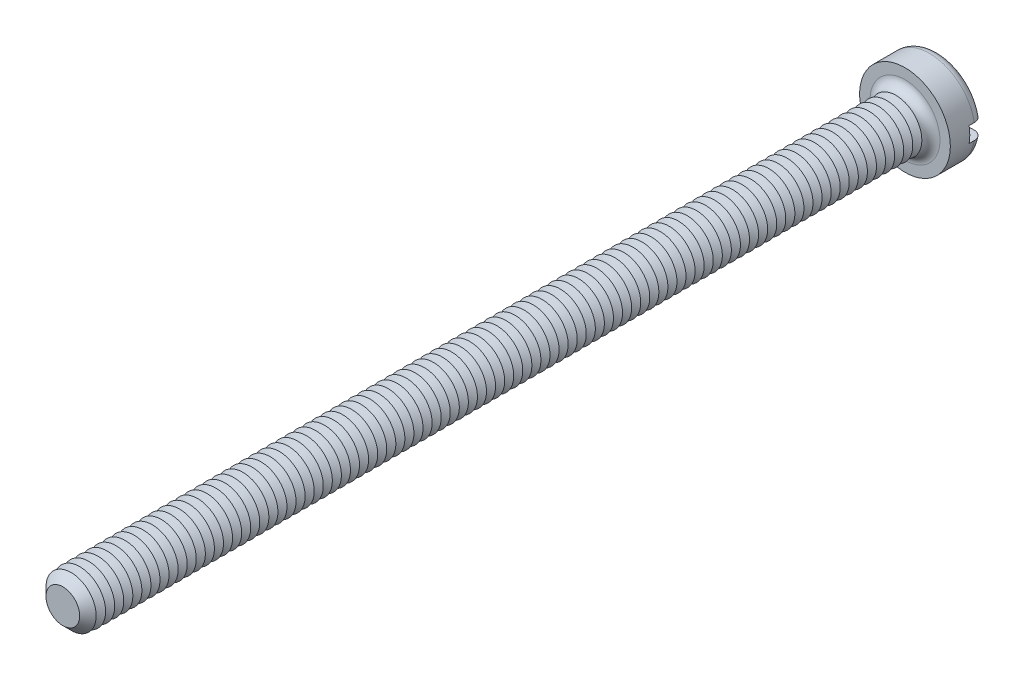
ISO-10303-21;
HEADER;
FILE_DESCRIPTION(('STEP AP214'),'2;1');
FILE_NAME('part.step','',(''),(''),'','','');
FILE_SCHEMA(('AUTOMOTIVE_DESIGN { 1 0 10303 214 1 1 1 1 }'));
ENDSEC;
DATA;
#1=APPLICATION_CONTEXT('core data for automotive mechanical design processes');
#2=APPLICATION_PROTOCOL_DEFINITION('international standard','automotive_design',2000,#1);
#3=PRODUCT_CONTEXT('',#1,'mechanical');
#4=PRODUCT('Part','Part','',(#3));
#5=PRODUCT_RELATED_PRODUCT_CATEGORY('part','',(#4));
#6=PRODUCT_DEFINITION_FORMATION('','',#4);
#7=PRODUCT_DEFINITION_CONTEXT('part definition',#1,'design');
#8=PRODUCT_DEFINITION('design','',#6,#7);
#9=PRODUCT_DEFINITION_SHAPE('','',#8);
#10=(LENGTH_UNIT() NAMED_UNIT(*) SI_UNIT(.MILLI.,.METRE.));
#11=(NAMED_UNIT(*) PLANE_ANGLE_UNIT() SI_UNIT($,.RADIAN.));
#12=(NAMED_UNIT(*) SI_UNIT($,.STERADIAN.) SOLID_ANGLE_UNIT());
#13=UNCERTAINTY_MEASURE_WITH_UNIT(LENGTH_MEASURE(1.E-05),#10,'distance_accuracy_value','');
#14=(GEOMETRIC_REPRESENTATION_CONTEXT(3) GLOBAL_UNCERTAINTY_ASSIGNED_CONTEXT((#13)) GLOBAL_UNIT_ASSIGNED_CONTEXT((#10,
#11,#12)) REPRESENTATION_CONTEXT('',''));
#15=CARTESIAN_POINT('',(0.,0.,0.));
#16=DIRECTION('',(0.,0.,1.));
#17=DIRECTION('',(1.,0.,0.));
#18=AXIS2_PLACEMENT_3D('',#15,#16,#17);
#19=CARTESIAN_POINT('',(0.,0.,-2.6));
#20=DIRECTION('',(0.,0.,1.));
#21=DIRECTION('',(1.,0.,0.));
#22=AXIS2_PLACEMENT_3D('',#19,#20,#21);
#23=PLANE('',#22);
#24=CARTESIAN_POINT('',(0.,0.,-2.6));
#25=DIRECTION('',(0.,0.,1.));
#26=DIRECTION('',(1.,0.,0.));
#27=AXIS2_PLACEMENT_3D('',#24,#25,#26);
#28=CIRCLE('',#27,2.8);
#29=CARTESIAN_POINT('',(-2.73495886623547,0.6,-2.6));
#30=VERTEX_POINT('',#29);
#31=CARTESIAN_POINT('',(2.73495886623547,0.6,-2.6));
#32=VERTEX_POINT('',#31);
#33=EDGE_CURVE('E116',#30,#32,#28,.F.);
#34=ORIENTED_EDGE('',*,*,#33,.T.);
#35=DIRECTION('',(1.,0.,0.));
#36=VECTOR('',#35,1.);
#37=CARTESIAN_POINT('',(-3.5,0.600000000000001,-2.6));
#38=LINE('',#37,#36);
#39=EDGE_CURVE('E111',#30,#32,#38,.T.);
#40=ORIENTED_EDGE('',*,*,#39,.F.);
#41=EDGE_LOOP('',(#34,#40));
#42=FACE_BOUND('',#41,.T.);
#43=ADVANCED_FACE('F39',(#42),#23,.F.);
#44=CARTESIAN_POINT('',(0.,0.,-1.9));
#45=DIRECTION('',(0.,0.,1.));
#46=DIRECTION('',(1.,0.,0.));
#47=AXIS2_PLACEMENT_3D('',#44,#45,#46);
#48=TOROIDAL_SURFACE('',#47,2.8,0.7);
#49=CARTESIAN_POINT('',(-3.24550494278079,0.600000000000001,-2.38938679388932));
#50=CARTESIAN_POINT('',(-3.21724139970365,0.600000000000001,-2.41780774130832));
#51=CARTESIAN_POINT('',(-3.18652103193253,0.600000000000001,-2.44383169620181));
#52=CARTESIAN_POINT('',(-3.12110229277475,0.600000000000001,-2.49034599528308));
#53=CARTESIAN_POINT('',(-3.08639834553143,0.6,-2.51082844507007));
#54=CARTESIAN_POINT('',(-3.01410013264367,0.6,-2.54568075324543));
#55=CARTESIAN_POINT('',(-2.97650963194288,0.6,-2.56005841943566));
#56=CARTESIAN_POINT('',(-2.89948250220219,0.6,-2.58239238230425));
#57=CARTESIAN_POINT('',(-2.86004633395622,0.6,-2.59035027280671));
#58=CARTESIAN_POINT('',(-2.77983715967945,0.6,-2.5997577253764));
#59=CARTESIAN_POINT('',(-2.73905311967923,0.6,-2.60111317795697));
#60=CARTESIAN_POINT('',(-2.65781876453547,0.6,-2.59706866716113));
#61=CARTESIAN_POINT('',(-2.61736849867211,0.6,-2.59166772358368));
#62=CARTESIAN_POINT('',(-2.53729983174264,0.6,-2.57414594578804));
#63=CARTESIAN_POINT('',(-2.49770360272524,0.6,-2.56192363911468));
#64=CARTESIAN_POINT('',(-2.421111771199,0.6,-2.5310238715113));
#65=CARTESIAN_POINT('',(-2.38411632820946,0.6,-2.51234601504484));
#66=CARTESIAN_POINT('',(-2.31371213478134,0.6,-2.46896762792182));
#67=CARTESIAN_POINT('',(-2.28031240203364,0.6,-2.44425244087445));
#68=CARTESIAN_POINT('',(-2.21823311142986,0.6,-2.38946667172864));
#69=CARTESIAN_POINT('',(-2.18955321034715,0.6,-2.35939647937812));
#70=CARTESIAN_POINT('',(-2.13836074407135,0.6,-2.29532787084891));
#71=CARTESIAN_POINT('',(-2.11574147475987,0.6,-2.26141482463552));
#72=CARTESIAN_POINT('',(-2.07677080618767,0.6,-2.19015935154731));
#73=CARTESIAN_POINT('',(-2.06041784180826,0.6,-2.15281778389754));
#74=CARTESIAN_POINT('',(-2.03508596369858,0.6,-2.07723332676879));
#75=CARTESIAN_POINT('',(-2.02585871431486,0.6,-2.03907365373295));
#76=CARTESIAN_POINT('',(-2.01416722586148,0.6,-1.96173417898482));
#77=CARTESIAN_POINT('',(-2.01170151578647,0.6,-1.92255460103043));
#78=CARTESIAN_POINT('',(-2.01359934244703,0.6,-1.84555709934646));
#79=CARTESIAN_POINT('',(-2.01775787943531,0.6,-1.80773393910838));
#80=CARTESIAN_POINT('',(-2.03236373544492,0.6,-1.73332511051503));
#81=CARTESIAN_POINT('',(-2.04281097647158,0.6,-1.69673942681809));
#82=CARTESIAN_POINT('',(-2.06962963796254,0.6,-1.62577336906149));
#83=CARTESIAN_POINT('',(-2.08600685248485,0.6,-1.59139519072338));
#84=CARTESIAN_POINT('',(-2.12413495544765,0.6,-1.52576356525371));
#85=CARTESIAN_POINT('',(-2.14588657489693,0.6,-1.49451054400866));
#86=CARTESIAN_POINT('',(-2.19483541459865,0.6,-1.43498643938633));
#87=CARTESIAN_POINT('',(-2.22217844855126,0.6,-1.40683532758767));
#88=CARTESIAN_POINT('',(-2.28105616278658,0.6,-1.35532544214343));
#89=CARTESIAN_POINT('',(-2.3125916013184,0.6,-1.33196753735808));
#90=CARTESIAN_POINT('',(-2.38018779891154,0.6,-1.28984356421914));
#91=CARTESIAN_POINT('',(-2.41637068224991,0.6,-1.27127330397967));
#92=CARTESIAN_POINT('',(-2.49129688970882,0.6,-1.24032971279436));
#93=CARTESIAN_POINT('',(-2.53004053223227,0.6,-1.22795715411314));
#94=CARTESIAN_POINT('',(-2.6098393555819,0.6,-1.2095515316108));
#95=CARTESIAN_POINT('',(-2.65092550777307,0.6,-1.20365237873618));
#96=CARTESIAN_POINT('',(-2.7335069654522,0.6,-1.1988380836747));
#97=CARTESIAN_POINT('',(-2.7750022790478,0.6,-1.19992308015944));
#98=CARTESIAN_POINT('',(-2.85718851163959,0.6,-1.20909046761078));
#99=CARTESIAN_POINT('',(-2.8978799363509,0.6,-1.21716830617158));
#100=CARTESIAN_POINT('',(-2.97729176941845,0.6,-1.24014327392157));
#101=CARTESIAN_POINT('',(-3.01601231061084,0.6,-1.25503994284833));
#102=CARTESIAN_POINT('',(-3.08976822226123,0.6,-1.29101066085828));
#103=CARTESIAN_POINT('',(-3.12484927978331,0.600000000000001,-1.31199098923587));
#104=CARTESIAN_POINT('',(-3.19090022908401,0.600000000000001,-1.35965144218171));
#105=CARTESIAN_POINT('',(-3.22187053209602,0.600000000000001,-1.38633099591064));
#106=CARTESIAN_POINT('',(-3.2781946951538,0.600000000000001,-1.44408564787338));
#107=CARTESIAN_POINT('',(-3.3036441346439,0.600000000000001,-1.47506754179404));
#108=CARTESIAN_POINT('',(-3.34887649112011,0.600000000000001,-1.54092398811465));
#109=CARTESIAN_POINT('',(-3.36865993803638,0.600000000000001,-1.57579817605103));
#110=CARTESIAN_POINT('',(-3.40166738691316,0.600000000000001,-1.64783067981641));
#111=CARTESIAN_POINT('',(-3.41499360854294,0.600000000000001,-1.68494217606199));
#112=CARTESIAN_POINT('',(-3.43515375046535,0.600000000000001,-1.76088675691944));
#113=CARTESIAN_POINT('',(-3.44198836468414,0.600000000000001,-1.79971965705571));
#114=CARTESIAN_POINT('',(-3.44891916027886,0.600000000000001,-1.87757893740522));
#115=CARTESIAN_POINT('',(-3.44908375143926,0.600000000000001,-1.91659924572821));
#116=CARTESIAN_POINT('',(-3.44284111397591,0.600000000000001,-1.99412088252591));
#117=CARTESIAN_POINT('',(-3.43643236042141,0.600000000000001,-2.03262208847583));
#118=CARTESIAN_POINT('',(-3.41725803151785,0.600000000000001,-2.10792315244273));
#119=CARTESIAN_POINT('',(-3.40450469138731,0.600000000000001,-2.14472613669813));
#120=CARTESIAN_POINT('',(-3.3730385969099,0.600000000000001,-2.21565060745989));
#121=CARTESIAN_POINT('',(-3.35433321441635,0.600000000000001,-2.24977534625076));
#122=CARTESIAN_POINT('',(-3.3201892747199,0.600000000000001,-2.30136364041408));
#123=CARTESIAN_POINT('',(-3.30647805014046,0.600000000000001,-2.31999402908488));
#124=CARTESIAN_POINT('',(-3.27728518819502,0.600000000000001,-2.35581090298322));
#125=CARTESIAN_POINT('',(-3.26180356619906,0.600000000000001,-2.37299740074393));
#126=CARTESIAN_POINT('',(-3.24550494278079,0.600000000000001,-2.38938679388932));
#127=B_SPLINE_CURVE_WITH_KNOTS('',3,(#49,#50,#51,#52,#53,#54,#55,#56,#57,#58,#59,#60,#61,#62,
#63,#64,#65,#66,#67,#68,#69,#70,#71,#72,#73,#74,#75,#76,#77,#78,#79,#80,#81,#82,#83,#84,#85,#86,
#87,#88,#89,#90,#91,#92,#93,#94,#95,#96,#97,#98,#99,#100,#101,#102,#103,#104,#105,#106,#107,
#108,#109,#110,#111,#112,#113,#114,#115,#116,#117,#118,#119,#120,#121,#122,#123,#124,#125,#126),
.UNSPECIFIED.,.T.,.F.,(4,2,2,2,2,2,2,2,2,2,2,2,2,2,2,2,2,2,2,2,2,2,2,2,2,2,2,2,2,2,2,2,2,2,2,2,
2,2,4),(0.,0.120160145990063,0.240490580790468,0.36066665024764,0.480812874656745,
0.602666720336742,0.724538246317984,0.848272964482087,0.972015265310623,1.09606100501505,
1.2200977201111,1.34178071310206,1.46343329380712,1.58062647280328,1.6977941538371,
1.81140573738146,1.92501591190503,2.03873739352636,2.15247435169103,2.26967910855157,
2.38690509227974,2.50835551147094,2.62982106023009,2.75375450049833,2.87769040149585,
3.00154567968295,3.12539259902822,3.24742469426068,3.36944457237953,3.48914477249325,
3.60883377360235,3.72656056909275,3.84427477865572,3.96078136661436,4.07731498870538,
4.19362474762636,4.3097910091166,4.37908387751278,4.44837614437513),.UNSPECIFIED.);
#128=CARTESIAN_POINT('',(-3.44818792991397,0.600000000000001,-1.8999999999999));
#129=VERTEX_POINT('',#128);
#130=EDGE_CURVE('E912',#129,#30,#127,.T.);
#131=ORIENTED_EDGE('',*,*,#130,.F.);
#132=CARTESIAN_POINT('',(0.,0.,-1.9));
#133=DIRECTION('',(0.,0.,1.));
#134=DIRECTION('',(1.,0.,0.));
#135=AXIS2_PLACEMENT_3D('',#132,#133,#134);
#136=CIRCLE('',#135,3.5);
#137=CARTESIAN_POINT('',(3.44818792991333,0.6,-1.9));
#138=VERTEX_POINT('',#137);
#139=EDGE_CURVE('E124',#138,#129,#136,.T.);
#140=ORIENTED_EDGE('',*,*,#139,.F.);
#141=CARTESIAN_POINT('',(2.1414268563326,0.6,-2.29762171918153));
#142=CARTESIAN_POINT('',(2.16505443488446,0.6,-2.33058245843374));
#143=CARTESIAN_POINT('',(2.19155609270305,0.6,-2.36152717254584));
#144=CARTESIAN_POINT('',(2.24942944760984,0.6,-2.41852964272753));
#145=CARTESIAN_POINT('',(2.28080921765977,0.6,-2.44457913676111));
#146=CARTESIAN_POINT('',(2.34741203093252,0.6,-2.49105381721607));
#147=CARTESIAN_POINT('',(2.38262862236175,0.6,-2.51148824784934));
#148=CARTESIAN_POINT('',(2.45593176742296,0.6,-2.54626881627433));
#149=CARTESIAN_POINT('',(2.49401741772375,0.6,-2.56061686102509));
#150=CARTESIAN_POINT('',(2.57272605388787,0.6,-2.58306429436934));
#151=CARTESIAN_POINT('',(2.6133821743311,0.6,-2.59104769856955));
#152=CARTESIAN_POINT('',(2.6954618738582,0.6,-2.60009608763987));
#153=CARTESIAN_POINT('',(2.73688552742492,0.6,-2.60116039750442));
#154=CARTESIAN_POINT('',(2.81941950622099,0.6,-2.5962925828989));
#155=CARTESIAN_POINT('',(2.86052888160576,0.6,-2.59034422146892));
#156=CARTESIAN_POINT('',(2.94113709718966,0.6,-2.57153687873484));
#157=CARTESIAN_POINT('',(2.98063603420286,0.6,-2.55867831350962));
#158=CARTESIAN_POINT('',(3.05633735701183,0.6,-2.52657771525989));
#159=CARTESIAN_POINT('',(3.09257627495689,0.6,-2.50742188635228));
#160=CARTESIAN_POINT('',(3.16123898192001,0.6,-2.46318606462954));
#161=CARTESIAN_POINT('',(3.19366316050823,0.6,-2.4381066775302));
#162=CARTESIAN_POINT('',(3.25312278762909,0.6,-2.38324481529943));
#163=CARTESIAN_POINT('',(3.28024842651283,0.6,-2.35356008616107));
#164=CARTESIAN_POINT('',(3.32902587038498,0.6,-2.28998971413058));
#165=CARTESIAN_POINT('',(3.35067820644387,0.6,-2.25610447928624));
#166=CARTESIAN_POINT('',(3.38751207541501,0.6,-2.18572286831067));
#167=CARTESIAN_POINT('',(3.40279804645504,0.6,-2.14928112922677));
#168=CARTESIAN_POINT('',(3.42695590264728,0.6,-2.07433042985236));
#169=CARTESIAN_POINT('',(3.43582824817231,0.6,-2.03582161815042));
#170=CARTESIAN_POINT('',(3.44682113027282,0.6,-1.95829536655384));
#171=CARTESIAN_POINT('',(3.44901648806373,0.6,-1.91928851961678));
#172=CARTESIAN_POINT('',(3.44680085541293,0.6,-1.84146366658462));
#173=CARTESIAN_POINT('',(3.44239008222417,0.6,-1.80264565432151));
#174=CARTESIAN_POINT('',(3.42712544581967,0.6,-1.72644634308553));
#175=CARTESIAN_POINT('',(3.41629508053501,0.6,-1.6890603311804));
#176=CARTESIAN_POINT('',(3.38853757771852,0.6,-1.61662604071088));
#177=CARTESIAN_POINT('',(3.37161039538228,0.6,-1.58157777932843));
#178=CARTESIAN_POINT('',(3.33207798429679,0.6,-1.51464178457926));
#179=CARTESIAN_POINT('',(3.30944854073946,0.6,-1.48276835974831));
#180=CARTESIAN_POINT('',(3.2592165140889,0.6,-1.42321861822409));
#181=CARTESIAN_POINT('',(3.23161370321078,0.6,-1.3955424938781));
#182=CARTESIAN_POINT('',(3.17188519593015,0.6,-1.34481834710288));
#183=CARTESIAN_POINT('',(3.13971065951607,0.6,-1.32182785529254));
#184=CARTESIAN_POINT('',(3.07201123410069,0.6,-1.28147003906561));
#185=CARTESIAN_POINT('',(3.03648608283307,0.6,-1.26410315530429));
#186=CARTESIAN_POINT('',(2.962449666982,0.6,-1.2351645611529));
#187=CARTESIAN_POINT('',(2.92389781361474,0.6,-1.22369671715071));
#188=CARTESIAN_POINT('',(2.84543273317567,0.6,-1.20726565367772));
#189=CARTESIAN_POINT('',(2.80551936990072,0.6,-1.20230308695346));
#190=CARTESIAN_POINT('',(2.72467191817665,0.6,-1.1989357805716));
#191=CARTESIAN_POINT('',(2.68373266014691,0.6,-1.20065484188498));
#192=CARTESIAN_POINT('',(2.60270222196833,0.6,-1.21084560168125));
#193=CARTESIAN_POINT('',(2.56261112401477,0.6,-1.21931795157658));
#194=CARTESIAN_POINT('',(2.48385954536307,0.6,-1.24292934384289));
#195=CARTESIAN_POINT('',(2.44522508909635,0.6,-1.25815531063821));
#196=CARTESIAN_POINT('',(2.37106165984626,0.6,-1.29488663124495));
#197=CARTESIAN_POINT('',(2.33553282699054,0.6,-1.31639226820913));
#198=CARTESIAN_POINT('',(2.2686996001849,0.6,-1.36507949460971));
#199=CARTESIAN_POINT('',(2.23738745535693,0.6,-1.39225042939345));
#200=CARTESIAN_POINT('',(2.17990424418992,0.6,-1.45157941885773));
#201=CARTESIAN_POINT('',(2.15373259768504,0.6,-1.48373691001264));
#202=CARTESIAN_POINT('',(2.10799355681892,0.6,-1.551327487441));
#203=CARTESIAN_POINT('',(2.08828258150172,0.6,-1.58666329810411));
#204=CARTESIAN_POINT('',(2.05534440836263,0.6,-1.66023600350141));
#205=CARTESIAN_POINT('',(2.042115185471,0.6,-1.6984719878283));
#206=CARTESIAN_POINT('',(2.02303126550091,0.6,-1.77519783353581));
#207=CARTESIAN_POINT('',(2.01691541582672,0.6,-1.8136228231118));
#208=CARTESIAN_POINT('',(2.01140375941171,0.6,-1.89096056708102));
#209=CARTESIAN_POINT('',(2.01200856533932,0.6,-1.92987336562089));
#210=CARTESIAN_POINT('',(2.01981617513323,0.6,-2.006065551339));
#211=CARTESIAN_POINT('',(2.02685835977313,0.6,-2.04336165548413));
#212=CARTESIAN_POINT('',(2.0470502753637,0.6,-2.1162250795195));
#213=CARTESIAN_POINT('',(2.06019252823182,0.6,-2.15179445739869));
#214=CARTESIAN_POINT('',(2.08525738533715,0.6,-2.20558874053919));
#215=CARTESIAN_POINT('',(2.09529161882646,0.6,-2.22471751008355));
#216=CARTESIAN_POINT('',(2.11708813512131,0.6,-2.26196179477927));
#217=CARTESIAN_POINT('',(2.12885034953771,0.6,-2.28007734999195));
#218=CARTESIAN_POINT('',(2.1414268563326,0.6,-2.29762171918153));
#219=B_SPLINE_CURVE_WITH_KNOTS('',3,(#141,#142,#143,#144,#145,#146,#147,#148,#149,#150,#151,
#152,#153,#154,#155,#156,#157,#158,#159,#160,#161,#162,#163,#164,#165,#166,#167,#168,#169,#170,
#171,#172,#173,#174,#175,#176,#177,#178,#179,#180,#181,#182,#183,#184,#185,#186,#187,#188,#189,
#190,#191,#192,#193,#194,#195,#196,#197,#198,#199,#200,#201,#202,#203,#204,#205,#206,#207,#208,
#209,#210,#211,#212,#213,#214,#215,#216,#217,#218),.UNSPECIFIED.,.T.,.F.,(4,2,2,2,2,2,2,2,2,2,2,
2,2,2,2,2,2,2,2,2,2,2,2,2,2,2,2,2,2,2,2,2,2,2,2,2,2,2,4),(0.,0.121582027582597,
0.243367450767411,0.364951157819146,0.486496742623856,0.610209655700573,0.733934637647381,
0.857946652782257,0.981951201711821,1.1043243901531,1.22668507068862,1.34673532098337,
1.46677391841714,1.58475736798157,1.70273234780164,1.81938035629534,1.93602452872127,
2.05224435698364,2.168465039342,2.28518782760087,2.40191596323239,2.52000081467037,
2.63809491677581,2.75820270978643,2.87832255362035,3.00067856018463,3.1230463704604,
3.24703703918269,3.37103329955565,3.49479843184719,3.6185495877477,3.73932715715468,
3.86006696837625,3.9762182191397,4.09238005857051,4.2057203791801,4.31892212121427,
4.38364046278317,4.44835624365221),.UNSPECIFIED.);
#220=EDGE_CURVE('E914',#32,#138,#219,.T.);
#221=ORIENTED_EDGE('',*,*,#220,.F.);
#222=ORIENTED_EDGE('',*,*,#33,.F.);
#223=EDGE_LOOP('',(#131,#140,#221,#222));
#224=FACE_BOUND('',#223,.T.);
#225=ADVANCED_FACE('F896',(#224),#48,.T.);
#226=CARTESIAN_POINT('',(0.,0.,-2.6));
#227=DIRECTION('',(0.,0.,1.));
#228=DIRECTION('',(1.,0.,0.));
#229=AXIS2_PLACEMENT_3D('',#226,#227,#228);
#230=CYLINDRICAL_SURFACE('',#229,3.5);
#231=DIRECTION('',(0.,0.,1.));
#232=VECTOR('',#231,1.);
#233=CARTESIAN_POINT('',(3.44818792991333,0.6,-2.6));
#234=LINE('',#233,#232);
#235=CARTESIAN_POINT('',(3.44818792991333,0.6,-1.5));
#236=VERTEX_POINT('',#235);
#237=EDGE_CURVE('E930',#138,#236,#234,.T.);
#238=ORIENTED_EDGE('',*,*,#237,.F.);
#239=ORIENTED_EDGE('',*,*,#139,.T.);
#240=DIRECTION('',(0.,0.,1.));
#241=VECTOR('',#240,1.);
#242=CARTESIAN_POINT('',(-3.44818792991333,0.600000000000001,-2.6));
#243=LINE('',#242,#241);
#244=CARTESIAN_POINT('',(-3.44818792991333,0.600000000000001,-1.5));
#245=VERTEX_POINT('',#244);
#246=EDGE_CURVE('E63',#245,#129,#243,.F.);
#247=ORIENTED_EDGE('',*,*,#246,.F.);
#248=CARTESIAN_POINT('',(0.,0.,-1.5));
#249=DIRECTION('',(0.,0.,-1.));
#250=DIRECTION('',(-1.,0.,0.));
#251=AXIS2_PLACEMENT_3D('',#248,#249,#250);
#252=CIRCLE('',#251,3.5);
#253=CARTESIAN_POINT('',(-3.44818792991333,-0.599999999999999,-1.5));
#254=VERTEX_POINT('',#253);
#255=EDGE_CURVE('E43',#245,#254,#252,.F.);
#256=ORIENTED_EDGE('',*,*,#255,.T.);
#257=DIRECTION('',(0.,0.,1.));
#258=VECTOR('',#257,1.);
#259=CARTESIAN_POINT('',(-3.44818792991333,-0.599999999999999,-2.6));
#260=LINE('',#259,#258);
#261=CARTESIAN_POINT('',(-3.44818792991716,-0.599999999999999,-1.90000000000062));
#262=VERTEX_POINT('',#261);
#263=EDGE_CURVE('E927',#262,#254,#260,.T.);
#264=ORIENTED_EDGE('',*,*,#263,.F.);
#265=CARTESIAN_POINT('',(3.44818792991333,-0.6,-1.9));
#266=VERTEX_POINT('',#265);
#267=EDGE_CURVE('E126',#262,#266,#136,.T.);
#268=ORIENTED_EDGE('',*,*,#267,.T.);
#269=DIRECTION('',(0.,0.,1.));
#270=VECTOR('',#269,1.);
#271=CARTESIAN_POINT('',(3.44818792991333,-0.6,-2.6));
#272=LINE('',#271,#270);
#273=CARTESIAN_POINT('',(3.44818792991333,-0.6,-1.5));
#274=VERTEX_POINT('',#273);
#275=EDGE_CURVE('E55',#274,#266,#272,.F.);
#276=ORIENTED_EDGE('',*,*,#275,.F.);
#277=EDGE_CURVE('E11',#274,#236,#252,.F.);
#278=ORIENTED_EDGE('',*,*,#277,.T.);
#279=EDGE_LOOP('',(#238,#239,#247,#256,#264,#268,#276,#278));
#280=FACE_BOUND('',#279,.T.);
#281=CARTESIAN_POINT('',(0.,0.,0.));
#282=DIRECTION('',(0.,0.,1.));
#283=DIRECTION('',(1.,0.,0.));
#284=AXIS2_PLACEMENT_3D('',#281,#282,#283);
#285=CIRCLE('',#284,3.5);
#286=CARTESIAN_POINT('',(3.5,0.,0.));
#287=VERTEX_POINT('',#286);
#288=EDGE_CURVE('E932',#287,#287,#285,.T.);
#289=ORIENTED_EDGE('',*,*,#288,.F.);
#290=EDGE_LOOP('',(#289));
#291=FACE_BOUND('',#290,.T.);
#292=ADVANCED_FACE('F892',(#280,#291),#230,.T.);
#293=CARTESIAN_POINT('',(2.73495886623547,-0.6,-2.6));
#294=VERTEX_POINT('',#293);
#295=CARTESIAN_POINT('',(-2.73495886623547,-0.6,-2.6));
#296=VERTEX_POINT('',#295);
#297=EDGE_CURVE('E109',#294,#296,#28,.F.);
#298=ORIENTED_EDGE('',*,*,#297,.T.);
#299=DIRECTION('',(-1.,0.,0.));
#300=VECTOR('',#299,1.);
#301=CARTESIAN_POINT('',(-3.5,-0.599999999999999,-2.6));
#302=LINE('',#301,#300);
#303=EDGE_CURVE('E96',#294,#296,#302,.T.);
#304=ORIENTED_EDGE('',*,*,#303,.F.);
#305=EDGE_LOOP('',(#298,#304));
#306=FACE_BOUND('',#305,.T.);
#307=ADVANCED_FACE('F108',(#306),#23,.F.);
#308=CARTESIAN_POINT('',(0.,0.,0.));
#309=DIRECTION('',(0.,0.,1.));
#310=DIRECTION('',(1.,0.,0.));
#311=AXIS2_PLACEMENT_3D('',#308,#309,#310);
#312=PLANE('',#311);
#313=CARTESIAN_POINT('',(0.,0.,0.));
#314=DIRECTION('',(0.,0.,1.));
#315=DIRECTION('',(1.,0.,0.));
#316=AXIS2_PLACEMENT_3D('',#313,#314,#315);
#317=CIRCLE('',#316,2.7);
#318=CARTESIAN_POINT('',(2.7,0.,0.));
#319=VERTEX_POINT('',#318);
#320=EDGE_CURVE('E115',#319,#319,#317,.F.);
#321=ORIENTED_EDGE('',*,*,#320,.T.);
#322=EDGE_LOOP('',(#321));
#323=FACE_BOUND('',#322,.T.);
#324=ORIENTED_EDGE('',*,*,#288,.T.);
#325=EDGE_LOOP('',(#324));
#326=FACE_BOUND('',#325,.T.);
#327=ADVANCED_FACE('F891',(#323,#326),#312,.T.);
#328=CARTESIAN_POINT('',(-3.24550494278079,-0.599999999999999,-2.38938679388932));
#329=CARTESIAN_POINT('',(-3.27309693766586,-0.599999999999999,-2.36163611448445));
#330=CARTESIAN_POINT('',(-3.29838741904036,-0.599999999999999,-2.3315608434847));
#331=CARTESIAN_POINT('',(-3.34359429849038,-0.599999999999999,-2.26757659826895));
#332=CARTESIAN_POINT('',(-3.36350518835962,-0.599999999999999,-2.23366374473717));
#333=CARTESIAN_POINT('',(-3.39733065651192,-0.599999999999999,-2.16296274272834));
#334=CARTESIAN_POINT('',(-3.4112451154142,-0.599999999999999,-2.12617453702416));
#335=CARTESIAN_POINT('',(-3.43264462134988,-0.599999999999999,-2.05078178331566));
#336=CARTESIAN_POINT('',(-3.44013114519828,-0.599999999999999,-2.01217765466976));
#337=CARTESIAN_POINT('',(-3.44841975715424,-0.599999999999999,-1.9345391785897));
#338=CARTESIAN_POINT('',(-3.44926944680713,-0.599999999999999,-1.89550990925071));
#339=CARTESIAN_POINT('',(-3.44438358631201,-0.599999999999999,-1.81786552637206));
#340=CARTESIAN_POINT('',(-3.43864801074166,-0.599999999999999,-1.77925041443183));
#341=CARTESIAN_POINT('',(-3.42079221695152,-0.599999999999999,-1.70364264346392));
#342=CARTESIAN_POINT('',(-3.40869011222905,-0.599999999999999,-1.66664570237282));
#343=CARTESIAN_POINT('',(-3.37847692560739,-0.599999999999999,-1.59519424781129));
#344=CARTESIAN_POINT('',(-3.3603657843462,-0.599999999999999,-1.56073975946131));
#345=CARTESIAN_POINT('',(-3.31856549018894,-0.599999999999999,-1.4951524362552));
#346=CARTESIAN_POINT('',(-3.29484830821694,-0.599999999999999,-1.46403747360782));
#347=CARTESIAN_POINT('',(-3.24258489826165,-0.599999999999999,-1.40617131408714));
#348=CARTESIAN_POINT('',(-3.21403843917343,-0.599999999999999,-1.37942032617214));
#349=CARTESIAN_POINT('',(-3.15256084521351,-0.599999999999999,-1.33067963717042));
#350=CARTESIAN_POINT('',(-3.11958015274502,-0.599999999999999,-1.30875246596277));
#351=CARTESIAN_POINT('',(-3.0504559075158,-0.599999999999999,-1.27063718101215));
#352=CARTESIAN_POINT('',(-3.01431209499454,-0.6,-1.25444953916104));
#353=CARTESIAN_POINT('',(-2.93921710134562,-0.6,-1.22796796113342));
#354=CARTESIAN_POINT('',(-2.90022796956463,-0.6,-1.217781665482));
#355=CARTESIAN_POINT('',(-2.82110512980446,-0.6,-1.20396915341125));
#356=CARTESIAN_POINT('',(-2.7809713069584,-0.6,-1.2003435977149));
#357=CARTESIAN_POINT('',(-2.69990924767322,-0.6,-1.19969717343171));
#358=CARTESIAN_POINT('',(-2.65898001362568,-0.6,-1.20279937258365));
#359=CARTESIAN_POINT('',(-2.57819986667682,-0.6,-1.21574287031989));
#360=CARTESIAN_POINT('',(-2.53834905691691,-0.6,-1.22558481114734));
#361=CARTESIAN_POINT('',(-2.46035232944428,-0.6,-1.25189361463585));
#362=CARTESIAN_POINT('',(-2.42223314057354,-0.6,-1.2684398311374));
#363=CARTESIAN_POINT('',(-2.34932316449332,-0.6,-1.30771928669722));
#364=CARTESIAN_POINT('',(-2.31453248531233,-0.6,-1.33045272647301));
#365=CARTESIAN_POINT('',(-2.24945577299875,-0.6,-1.38141543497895));
#366=CARTESIAN_POINT('',(-2.21915255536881,-0.6,-1.40962272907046));
#367=CARTESIAN_POINT('',(-2.16386461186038,-0.6,-1.47084552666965));
#368=CARTESIAN_POINT('',(-2.13887916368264,-0.6,-1.50386037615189));
#369=CARTESIAN_POINT('',(-2.09568071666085,-0.6,-1.57285917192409));
#370=CARTESIAN_POINT('',(-2.07730739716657,-0.6,-1.60874263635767));
#371=CARTESIAN_POINT('',(-2.04712019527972,-0.6,-1.68316975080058));
#372=CARTESIAN_POINT('',(-2.03530452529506,-0.6,-1.72171267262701));
#373=CARTESIAN_POINT('',(-2.01901751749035,-0.6,-1.79878952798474));
#374=CARTESIAN_POINT('',(-2.01428434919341,-0.6,-1.8372682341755));
#375=CARTESIAN_POINT('',(-2.01150652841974,-0.6,-1.91446369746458));
#376=CARTESIAN_POINT('',(-2.01346084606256,-0.6,-1.95318041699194));
#377=CARTESIAN_POINT('',(-2.02386268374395,-0.6,-2.0288619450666));
#378=CARTESIAN_POINT('',(-2.03216724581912,-0.6,-2.06584654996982));
#379=CARTESIAN_POINT('',(-2.05479337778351,-0.6,-2.13792373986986));
#380=CARTESIAN_POINT('',(-2.06911522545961,-0.6,-2.1730162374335));
#381=CARTESIAN_POINT('',(-2.10349906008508,-0.6,-2.24081034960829));
#382=CARTESIAN_POINT('',(-2.12363007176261,-0.6,-2.27347689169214));
#383=CARTESIAN_POINT('',(-2.16891308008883,-0.6,-2.33511902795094));
#384=CARTESIAN_POINT('',(-2.19406590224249,-0.6,-2.36409401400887));
#385=CARTESIAN_POINT('',(-2.24962389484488,-0.6,-2.41861972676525));
#386=CARTESIAN_POINT('',(-2.28018314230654,-0.6,-2.44401345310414));
#387=CARTESIAN_POINT('',(-2.34501720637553,-0.6,-2.48950558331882));
#388=CARTESIAN_POINT('',(-2.37929266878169,-0.6,-2.50960306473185));
#389=CARTESIAN_POINT('',(-2.45179417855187,-0.6,-2.54458276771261));
#390=CARTESIAN_POINT('',(-2.49011248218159,-0.6,-2.55927401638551));
#391=CARTESIAN_POINT('',(-2.56865227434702,-0.6,-2.58211133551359));
#392=CARTESIAN_POINT('',(-2.60887386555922,-0.6,-2.59025705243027));
#393=CARTESIAN_POINT('',(-2.69064746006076,-0.6,-2.59982905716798));
#394=CARTESIAN_POINT('',(-2.73220999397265,-0.6,-2.60116580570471));
#395=CARTESIAN_POINT('',(-2.81497658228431,-0.6,-2.59679700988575));
#396=CARTESIAN_POINT('',(-2.85618055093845,-0.6,-2.59108982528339));
#397=CARTESIAN_POINT('',(-2.93677683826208,-0.6,-2.57279487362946));
#398=CARTESIAN_POINT('',(-2.97617834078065,-0.6,-2.56024753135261));
#399=CARTESIAN_POINT('',(-3.05222242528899,-0.6,-2.52860709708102));
#400=CARTESIAN_POINT('',(-3.08886850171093,-0.599999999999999,-2.50952247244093));
#401=CARTESIAN_POINT('',(-3.14562501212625,-0.599999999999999,-2.47340693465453));
#402=CARTESIAN_POINT('',(-3.16689358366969,-0.599999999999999,-2.45816337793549));
#403=CARTESIAN_POINT('',(-3.20761866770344,-0.599999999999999,-2.42542115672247));
#404=CARTESIAN_POINT('',(-3.22707520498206,-0.599999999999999,-2.40792252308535));
#405=CARTESIAN_POINT('',(-3.24550494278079,-0.599999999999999,-2.38938679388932));
#406=B_SPLINE_CURVE_WITH_KNOTS('',3,(#328,#329,#330,#331,#332,#333,#334,#335,#336,#337,#338,
#339,#340,#341,#342,#343,#344,#345,#346,#347,#348,#349,#350,#351,#352,#353,#354,#355,#356,#357,
#358,#359,#360,#361,#362,#363,#364,#365,#366,#367,#368,#369,#370,#371,#372,#373,#374,#375,#376,
#377,#378,#379,#380,#381,#382,#383,#384,#385,#386,#387,#388,#389,#390,#391,#392,#393,#394,#395,
#396,#397,#398,#399,#400,#401,#402,#403,#404,#405),.UNSPECIFIED.,.T.,.F.,(4,2,2,2,2,2,2,2,2,2,2,
2,2,2,2,2,2,2,2,2,2,2,2,2,2,2,2,2,2,2,2,2,2,2,2,2,2,2,4),(0.,0.117306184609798,
0.234732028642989,0.352160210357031,0.469561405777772,0.586119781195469,0.702678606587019,
0.818907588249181,0.935137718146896,1.05196174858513,1.1687913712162,1.2870562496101,
1.40533084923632,1.52566688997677,1.64601504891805,1.76858322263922,1.89116307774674,
2.01523830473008,2.13931755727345,2.26290863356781,2.38648291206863,2.50681878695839,
2.62712184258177,2.74285697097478,2.85857427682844,2.97176054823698,3.08495204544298,
3.19954814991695,3.31416310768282,3.43282436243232,3.55150627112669,3.67404987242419,
3.79660009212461,3.92075778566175,4.04494439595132,4.16840490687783,4.29170610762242,
4.3700604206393,4.44841366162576),.UNSPECIFIED.);
#407=EDGE_CURVE('E103',#296,#262,#406,.T.);
#408=ORIENTED_EDGE('',*,*,#407,.F.);
#409=ORIENTED_EDGE('',*,*,#297,.F.);
#410=CARTESIAN_POINT('',(2.1414268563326,-0.6,-2.29762171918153));
#411=CARTESIAN_POINT('',(2.11900044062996,-0.6,-2.26633119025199));
#412=CARTESIAN_POINT('',(2.09913154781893,-0.6,-2.23318080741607));
#413=CARTESIAN_POINT('',(2.06517900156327,-0.6,-2.16401111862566));
#414=CARTESIAN_POINT('',(2.05109968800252,-0.6,-2.12798968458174));
#415=CARTESIAN_POINT('',(2.02923593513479,-0.6,-2.05404277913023));
#416=CARTESIAN_POINT('',(2.02145692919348,-0.6,-2.01611569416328));
#417=CARTESIAN_POINT('',(2.01251710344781,-0.6,-1.93949649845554));
#418=CARTESIAN_POINT('',(2.01135461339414,-0.6,-1.90080458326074));
#419=CARTESIAN_POINT('',(2.01564803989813,-0.6,-1.82450508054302));
#420=CARTESIAN_POINT('',(2.02098305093,-0.6,-1.78689061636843));
#421=CARTESIAN_POINT('',(2.03786826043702,-0.6,-1.71308589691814));
#422=CARTESIAN_POINT('',(2.04941870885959,-0.6,-1.67689569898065));
#423=CARTESIAN_POINT('',(2.07838664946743,-0.6,-1.60676639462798));
#424=CARTESIAN_POINT('',(2.09582944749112,-0.6,-1.57283776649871));
#425=CARTESIAN_POINT('',(2.1359925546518,-0.6,-1.50826612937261));
#426=CARTESIAN_POINT('',(2.15871360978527,-0.6,-1.47762358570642));
#427=CARTESIAN_POINT('',(2.20955413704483,-0.6,-1.41943384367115));
#428=CARTESIAN_POINT('',(2.23782364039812,-0.6,-1.39201777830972));
#429=CARTESIAN_POINT('',(2.29842612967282,-0.6,-1.34212199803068));
#430=CARTESIAN_POINT('',(2.33075984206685,-0.6,-1.31964316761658));
#431=CARTESIAN_POINT('',(2.399806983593,-0.6,-1.27945238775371));
#432=CARTESIAN_POINT('',(2.43663466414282,-0.6,-1.26193653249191));
#433=CARTESIAN_POINT('',(2.51267241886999,-0.6,-1.23320660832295));
#434=CARTESIAN_POINT('',(2.55188277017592,-0.6,-1.22199327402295));
#435=CARTESIAN_POINT('',(2.63235000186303,-0.6,-1.20602688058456));
#436=CARTESIAN_POINT('',(2.673631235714,-0.6,-1.20139617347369));
#437=CARTESIAN_POINT('',(2.7563863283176,-0.6,-1.19914622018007));
#438=CARTESIAN_POINT('',(2.79786018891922,-0.6,-1.20152704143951));
#439=CARTESIAN_POINT('',(2.87971192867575,-0.6,-1.21326884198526));
#440=CARTESIAN_POINT('',(2.92009214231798,-0.6,-1.22261349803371));
#441=CARTESIAN_POINT('',(2.99866777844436,-0.6,-1.24805614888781));
#442=CARTESIAN_POINT('',(3.03686335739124,-0.6,-1.26415365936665));
#443=CARTESIAN_POINT('',(3.10934738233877,-0.6,-1.3023912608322));
#444=CARTESIAN_POINT('',(3.14368704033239,-0.6,-1.32443423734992));
#445=CARTESIAN_POINT('',(3.20808395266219,-0.6,-1.37407725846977));
#446=CARTESIAN_POINT('',(3.23814164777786,-0.6,-1.40167673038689));
#447=CARTESIAN_POINT('',(3.29251534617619,-0.6,-1.46108303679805));
#448=CARTESIAN_POINT('',(3.3169296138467,-0.6,-1.49279994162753));
#449=CARTESIAN_POINT('',(3.35998418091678,-0.6,-1.55993706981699));
#450=CARTESIAN_POINT('',(3.37862502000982,-0.6,-1.59535694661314));
#451=CARTESIAN_POINT('',(3.40930212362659,-0.6,-1.668283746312));
#452=CARTESIAN_POINT('',(3.42143897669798,-0.6,-1.70574837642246));
#453=CARTESIAN_POINT('',(3.43918305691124,-0.6,-1.78219297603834));
#454=CARTESIAN_POINT('',(3.44479069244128,-0.6,-1.82117285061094));
#455=CARTESIAN_POINT('',(3.44928173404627,-0.6,-1.89914596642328));
#456=CARTESIAN_POINT('',(3.44822835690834,-0.6,-1.93813558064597));
#457=CARTESIAN_POINT('',(3.43957811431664,-0.6,-2.0153811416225));
#458=CARTESIAN_POINT('',(3.43198139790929,-0.6,-2.05363710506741));
#459=CARTESIAN_POINT('',(3.41049386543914,-0.6,-2.12826741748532));
#460=CARTESIAN_POINT('',(3.39661362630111,-0.6,-2.16464481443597));
#461=CARTESIAN_POINT('',(3.36297924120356,-0.6,-2.23457274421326));
#462=CARTESIAN_POINT('',(3.34322499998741,-0.6,-2.26812323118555));
#463=CARTESIAN_POINT('',(3.29828706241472,-0.6,-2.33167864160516));
#464=CARTESIAN_POINT('',(3.27307040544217,-0.6,-2.36166024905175));
#465=CARTESIAN_POINT('',(3.21802069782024,-0.6,-2.41703165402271));
#466=CARTESIAN_POINT('',(3.18818738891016,-0.6,-2.44242119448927));
#467=CARTESIAN_POINT('',(3.12433871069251,-0.6,-2.48825551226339));
#468=CARTESIAN_POINT('',(3.09027338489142,-0.6,-2.50863067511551));
#469=CARTESIAN_POINT('',(3.01925175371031,-0.6,-2.54348754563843));
#470=CARTESIAN_POINT('',(2.982295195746,-0.6,-2.55796873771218));
#471=CARTESIAN_POINT('',(2.90583499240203,-0.6,-2.58090526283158));
#472=CARTESIAN_POINT('',(2.86629758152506,-0.6,-2.58924801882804));
#473=CARTESIAN_POINT('',(2.78639041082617,-0.6,-2.59930573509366));
#474=CARTESIAN_POINT('',(2.7460205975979,-0.6,-2.60102026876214));
#475=CARTESIAN_POINT('',(2.66482039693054,-0.6,-2.59779078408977));
#476=CARTESIAN_POINT('',(2.62399477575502,-0.6,-2.59272651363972));
#477=CARTESIAN_POINT('',(2.54373809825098,-0.6,-2.57588976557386));
#478=CARTESIAN_POINT('',(2.50430750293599,-0.6,-2.56411509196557));
#479=CARTESIAN_POINT('',(2.42753167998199,-0.6,-2.53401488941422));
#480=CARTESIAN_POINT('',(2.39021407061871,-0.6,-2.51561892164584));
#481=CARTESIAN_POINT('',(2.31925431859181,-0.6,-2.4727929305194));
#482=CARTESIAN_POINT('',(2.28560806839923,-0.6,-2.44836975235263));
#483=CARTESIAN_POINT('',(2.23316677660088,-0.6,-2.40295212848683));
#484=CARTESIAN_POINT('',(2.21309339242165,-0.6,-2.38341311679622));
#485=CARTESIAN_POINT('',(2.17537212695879,-0.6,-2.34211733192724));
#486=CARTESIAN_POINT('',(2.1577241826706,-0.6,-2.32036061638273));
#487=CARTESIAN_POINT('',(2.1414268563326,-0.6,-2.29762171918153));
#488=B_SPLINE_CURVE_WITH_KNOTS('',3,(#410,#411,#412,#413,#414,#415,#416,#417,#418,#419,#420,
#421,#422,#423,#424,#425,#426,#427,#428,#429,#430,#431,#432,#433,#434,#435,#436,#437,#438,#439,
#440,#441,#442,#443,#444,#445,#446,#447,#448,#449,#450,#451,#452,#453,#454,#455,#456,#457,#458,
#459,#460,#461,#462,#463,#464,#465,#466,#467,#468,#469,#470,#471,#472,#473,#474,#475,#476,#477,
#478,#479,#480,#481,#482,#483,#484,#485,#486,#487),.UNSPECIFIED.,.T.,.F.,(4,2,2,2,2,2,2,2,2,2,2,
2,2,2,2,2,2,2,2,2,2,2,2,2,2,2,2,2,2,2,2,2,2,2,2,2,2,2,4),(0.,0.115394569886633,
0.230875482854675,0.346455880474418,0.462007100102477,0.575440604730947,0.688878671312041,
0.802810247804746,0.91675793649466,1.03436780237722,1.15199872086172,1.27377854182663,
1.39557255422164,1.51960202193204,1.64363268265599,1.76737352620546,1.89110549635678,
2.01292743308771,2.13473682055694,2.25423121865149,2.37371444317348,2.49129215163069,
2.60886250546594,2.72531873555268,2.8417723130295,2.95803059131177,3.07429075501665,
3.19127301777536,3.30826182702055,3.42679321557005,3.54533497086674,3.66599996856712,
3.78667273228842,3.90951478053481,4.03239705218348,4.15662720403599,4.28071691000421,
4.36457658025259,4.44843407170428),.UNSPECIFIED.);
#489=EDGE_CURVE('E92',#266,#294,#488,.T.);
#490=ORIENTED_EDGE('',*,*,#489,.F.);
#491=ORIENTED_EDGE('',*,*,#267,.F.);
#492=EDGE_LOOP('',(#408,#409,#490,#491));
#493=FACE_BOUND('',#492,.T.);
#494=ADVANCED_FACE('F113',(#493),#48,.T.);
#495=CARTESIAN_POINT('',(0.,0.,0.700000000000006));
#496=DIRECTION('',(0.,0.,1.));
#497=DIRECTION('',(1.,0.,0.));
#498=AXIS2_PLACEMENT_3D('',#495,#496,#497);
#499=TOROIDAL_SURFACE('',#498,2.7,0.7);
#500=ORIENTED_EDGE('',*,*,#320,.F.);
#501=EDGE_LOOP('',(#500));
#502=FACE_BOUND('',#501,.T.);
#503=CARTESIAN_POINT('',(0.,0.,0.699999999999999));
#504=DIRECTION('',(0.,0.,-1.));
#505=DIRECTION('',(-1.,0.,0.));
#506=AXIS2_PLACEMENT_3D('',#503,#504,#505);
#507=CIRCLE('',#506,2.);
#508=CARTESIAN_POINT('',(-2.,0.,0.699999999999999));
#509=VERTEX_POINT('',#508);
#510=EDGE_CURVE('E937',#509,#509,#507,.T.);
#511=ORIENTED_EDGE('',*,*,#510,.T.);
#512=EDGE_LOOP('',(#511));
#513=FACE_BOUND('',#512,.T.);
#514=ADVANCED_FACE('F884',(#502,#513),#499,.F.);
#515=CARTESIAN_POINT('',(0.,0.,1.05));
#516=DIRECTION('',(0.,0.,-1.));
#517=DIRECTION('',(-1.,0.,0.));
#518=AXIS2_PLACEMENT_3D('',#515,#516,#517);
#519=CONICAL_SURFACE('',#518,1.39378221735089,1.0471975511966);
#520=ORIENTED_EDGE('',*,*,#510,.F.);
#521=EDGE_LOOP('',(#520));
#522=FACE_BOUND('',#521,.T.);
#523=CARTESIAN_POINT('',(0.,0.,1.05));
#524=DIRECTION('',(0.,0.,-1.));
#525=DIRECTION('',(-1.,0.,0.));
#526=AXIS2_PLACEMENT_3D('',#523,#524,#525);
#527=CIRCLE('',#526,1.39378221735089);
#528=CARTESIAN_POINT('',(-1.39378221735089,0.,1.05));
#529=VERTEX_POINT('',#528);
#530=EDGE_CURVE('E943',#529,#529,#527,.T.);
#531=ORIENTED_EDGE('',*,*,#530,.T.);
#532=EDGE_LOOP('',(#531));
#533=FACE_BOUND('',#532,.T.);
#534=ADVANCED_FACE('F880',(#522,#533),#519,.T.);
#535=CARTESIAN_POINT('',(0.,0.,1.4));
#536=DIRECTION('',(0.,0.,1.));
#537=DIRECTION('',(1.,0.,0.));
#538=AXIS2_PLACEMENT_3D('',#535,#536,#537);
#539=CONICAL_SURFACE('',#538,2.,1.0471975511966);
#540=ORIENTED_EDGE('',*,*,#530,.F.);
#541=EDGE_LOOP('',(#540));
#542=FACE_BOUND('',#541,.T.);
#543=CARTESIAN_POINT('',(0.,0.,1.4));
#544=DIRECTION('',(0.,0.,-1.));
#545=DIRECTION('',(-1.,0.,0.));
#546=AXIS2_PLACEMENT_3D('',#543,#544,#545);
#547=CIRCLE('',#546,2.);
#548=CARTESIAN_POINT('',(-2.,0.,1.4));
#549=VERTEX_POINT('',#548);
#550=EDGE_CURVE('E949',#549,#549,#547,.T.);
#551=ORIENTED_EDGE('',*,*,#550,.T.);
#552=EDGE_LOOP('',(#551));
#553=FACE_BOUND('',#552,.T.);
#554=ADVANCED_FACE('F876',(#542,#553),#539,.T.);
#555=CARTESIAN_POINT('',(0.,0.,1.75));
#556=DIRECTION('',(0.,0.,-1.));
#557=DIRECTION('',(-1.,0.,0.));
#558=AXIS2_PLACEMENT_3D('',#555,#556,#557);
#559=CONICAL_SURFACE('',#558,1.39378221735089,1.0471975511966);
#560=ORIENTED_EDGE('',*,*,#550,.F.);
#561=EDGE_LOOP('',(#560));
#562=FACE_BOUND('',#561,.T.);
#563=CARTESIAN_POINT('',(0.,0.,1.75));
#564=DIRECTION('',(0.,0.,-1.));
#565=DIRECTION('',(-1.,0.,0.));
#566=AXIS2_PLACEMENT_3D('',#563,#564,#565);
#567=CIRCLE('',#566,1.39378221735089);
#568=CARTESIAN_POINT('',(-1.39378221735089,0.,1.75));
#569=VERTEX_POINT('',#568);
#570=EDGE_CURVE('E953',#569,#569,#567,.T.);
#571=ORIENTED_EDGE('',*,*,#570,.T.);
#572=EDGE_LOOP('',(#571));
#573=FACE_BOUND('',#572,.T.);
#574=ADVANCED_FACE('F872',(#562,#573),#559,.T.);
#575=CARTESIAN_POINT('',(0.,0.,2.1));
#576=DIRECTION('',(0.,0.,1.));
#577=DIRECTION('',(1.,0.,0.));
#578=AXIS2_PLACEMENT_3D('',#575,#576,#577);
#579=CONICAL_SURFACE('',#578,2.,1.0471975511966);
#580=ORIENTED_EDGE('',*,*,#570,.F.);
#581=EDGE_LOOP('',(#580));
#582=FACE_BOUND('',#581,.T.);
#583=CARTESIAN_POINT('',(0.,0.,2.1));
#584=DIRECTION('',(0.,0.,-1.));
#585=DIRECTION('',(-1.,0.,0.));
#586=AXIS2_PLACEMENT_3D('',#583,#584,#585);
#587=CIRCLE('',#586,2.);
#588=CARTESIAN_POINT('',(-2.,0.,2.1));
#589=VERTEX_POINT('',#588);
#590=EDGE_CURVE('E957',#589,#589,#587,.T.);
#591=ORIENTED_EDGE('',*,*,#590,.T.);
#592=EDGE_LOOP('',(#591));
#593=FACE_BOUND('',#592,.T.);
#594=ADVANCED_FACE('F868',(#582,#593),#579,.T.);
#595=CARTESIAN_POINT('',(0.,0.,2.45));
#596=DIRECTION('',(0.,0.,-1.));
#597=DIRECTION('',(-1.,0.,0.));
#598=AXIS2_PLACEMENT_3D('',#595,#596,#597);
#599=CONICAL_SURFACE('',#598,1.39378221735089,1.0471975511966);
#600=ORIENTED_EDGE('',*,*,#590,.F.);
#601=EDGE_LOOP('',(#600));
#602=FACE_BOUND('',#601,.T.);
#603=CARTESIAN_POINT('',(0.,0.,2.45));
#604=DIRECTION('',(0.,0.,-1.));
#605=DIRECTION('',(-1.,0.,0.));
#606=AXIS2_PLACEMENT_3D('',#603,#604,#605);
#607=CIRCLE('',#606,1.39378221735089);
#608=CARTESIAN_POINT('',(-1.39378221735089,0.,2.45));
#609=VERTEX_POINT('',#608);
#610=EDGE_CURVE('E961',#609,#609,#607,.T.);
#611=ORIENTED_EDGE('',*,*,#610,.T.);
#612=EDGE_LOOP('',(#611));
#613=FACE_BOUND('',#612,.T.);
#614=ADVANCED_FACE('F864',(#602,#613),#599,.T.);
#615=CARTESIAN_POINT('',(0.,0.,2.8));
#616=DIRECTION('',(0.,0.,1.));
#617=DIRECTION('',(1.,0.,0.));
#618=AXIS2_PLACEMENT_3D('',#615,#616,#617);
#619=CONICAL_SURFACE('',#618,2.,1.0471975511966);
#620=ORIENTED_EDGE('',*,*,#610,.F.);
#621=EDGE_LOOP('',(#620));
#622=FACE_BOUND('',#621,.T.);
#623=CARTESIAN_POINT('',(0.,0.,2.8));
#624=DIRECTION('',(0.,0.,-1.));
#625=DIRECTION('',(-1.,0.,0.));
#626=AXIS2_PLACEMENT_3D('',#623,#624,#625);
#627=CIRCLE('',#626,2.);
#628=CARTESIAN_POINT('',(-2.,0.,2.8));
#629=VERTEX_POINT('',#628);
#630=EDGE_CURVE('E964',#629,#629,#627,.T.);
#631=ORIENTED_EDGE('',*,*,#630,.T.);
#632=EDGE_LOOP('',(#631));
#633=FACE_BOUND('',#632,.T.);
#634=ADVANCED_FACE('F860',(#622,#633),#619,.T.);
#635=CARTESIAN_POINT('',(0.,0.,3.15));
#636=DIRECTION('',(0.,0.,-1.));
#637=DIRECTION('',(-1.,0.,0.));
#638=AXIS2_PLACEMENT_3D('',#635,#636,#637);
#639=CONICAL_SURFACE('',#638,1.39378221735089,1.0471975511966);
#640=ORIENTED_EDGE('',*,*,#630,.F.);
#641=EDGE_LOOP('',(#640));
#642=FACE_BOUND('',#641,.T.);
#643=CARTESIAN_POINT('',(0.,0.,3.15));
#644=DIRECTION('',(0.,0.,-1.));
#645=DIRECTION('',(-1.,0.,0.));
#646=AXIS2_PLACEMENT_3D('',#643,#644,#645);
#647=CIRCLE('',#646,1.39378221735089);
#648=CARTESIAN_POINT('',(-1.39378221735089,0.,3.15));
#649=VERTEX_POINT('',#648);
#650=EDGE_CURVE('E968',#649,#649,#647,.T.);
#651=ORIENTED_EDGE('',*,*,#650,.T.);
#652=EDGE_LOOP('',(#651));
#653=FACE_BOUND('',#652,.T.);
#654=ADVANCED_FACE('F856',(#642,#653),#639,.T.);
#655=CARTESIAN_POINT('',(0.,0.,3.5));
#656=DIRECTION('',(0.,0.,1.));
#657=DIRECTION('',(1.,0.,0.));
#658=AXIS2_PLACEMENT_3D('',#655,#656,#657);
#659=CONICAL_SURFACE('',#658,2.,1.0471975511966);
#660=ORIENTED_EDGE('',*,*,#650,.F.);
#661=EDGE_LOOP('',(#660));
#662=FACE_BOUND('',#661,.T.);
#663=CARTESIAN_POINT('',(0.,0.,3.5));
#664=DIRECTION('',(0.,0.,-1.));
#665=DIRECTION('',(-1.,0.,0.));
#666=AXIS2_PLACEMENT_3D('',#663,#664,#665);
#667=CIRCLE('',#666,2.);
#668=CARTESIAN_POINT('',(-2.,0.,3.5));
#669=VERTEX_POINT('',#668);
#670=EDGE_CURVE('E972',#669,#669,#667,.T.);
#671=ORIENTED_EDGE('',*,*,#670,.T.);
#672=EDGE_LOOP('',(#671));
#673=FACE_BOUND('',#672,.T.);
#674=ADVANCED_FACE('F852',(#662,#673),#659,.T.);
#675=CARTESIAN_POINT('',(0.,0.,3.85));
#676=DIRECTION('',(0.,0.,-1.));
#677=DIRECTION('',(-1.,0.,0.));
#678=AXIS2_PLACEMENT_3D('',#675,#676,#677);
#679=CONICAL_SURFACE('',#678,1.39378221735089,1.0471975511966);
#680=ORIENTED_EDGE('',*,*,#670,.F.);
#681=EDGE_LOOP('',(#680));
#682=FACE_BOUND('',#681,.T.);
#683=CARTESIAN_POINT('',(0.,0.,3.85));
#684=DIRECTION('',(0.,0.,-1.));
#685=DIRECTION('',(-1.,0.,0.));
#686=AXIS2_PLACEMENT_3D('',#683,#684,#685);
#687=CIRCLE('',#686,1.39378221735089);
#688=CARTESIAN_POINT('',(-1.39378221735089,0.,3.85));
#689=VERTEX_POINT('',#688);
#690=EDGE_CURVE('E976',#689,#689,#687,.T.);
#691=ORIENTED_EDGE('',*,*,#690,.T.);
#692=EDGE_LOOP('',(#691));
#693=FACE_BOUND('',#692,.T.);
#694=ADVANCED_FACE('F848',(#682,#693),#679,.T.);
#695=CARTESIAN_POINT('',(0.,0.,4.2));
#696=DIRECTION('',(0.,0.,1.));
#697=DIRECTION('',(1.,0.,0.));
#698=AXIS2_PLACEMENT_3D('',#695,#696,#697);
#699=CONICAL_SURFACE('',#698,2.,1.0471975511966);
#700=ORIENTED_EDGE('',*,*,#690,.F.);
#701=EDGE_LOOP('',(#700));
#702=FACE_BOUND('',#701,.T.);
#703=CARTESIAN_POINT('',(0.,0.,4.2));
#704=DIRECTION('',(0.,0.,-1.));
#705=DIRECTION('',(-1.,0.,0.));
#706=AXIS2_PLACEMENT_3D('',#703,#704,#705);
#707=CIRCLE('',#706,2.);
#708=CARTESIAN_POINT('',(-2.,0.,4.2));
#709=VERTEX_POINT('',#708);
#710=EDGE_CURVE('E980',#709,#709,#707,.T.);
#711=ORIENTED_EDGE('',*,*,#710,.T.);
#712=EDGE_LOOP('',(#711));
#713=FACE_BOUND('',#712,.T.);
#714=ADVANCED_FACE('F844',(#702,#713),#699,.T.);
#715=CARTESIAN_POINT('',(0.,0.,4.55));
#716=DIRECTION('',(0.,0.,-1.));
#717=DIRECTION('',(-1.,0.,0.));
#718=AXIS2_PLACEMENT_3D('',#715,#716,#717);
#719=CONICAL_SURFACE('',#718,1.39378221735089,1.0471975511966);
#720=ORIENTED_EDGE('',*,*,#710,.F.);
#721=EDGE_LOOP('',(#720));
#722=FACE_BOUND('',#721,.T.);
#723=CARTESIAN_POINT('',(0.,0.,4.55));
#724=DIRECTION('',(0.,0.,-1.));
#725=DIRECTION('',(-1.,0.,0.));
#726=AXIS2_PLACEMENT_3D('',#723,#724,#725);
#727=CIRCLE('',#726,1.39378221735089);
#728=CARTESIAN_POINT('',(-1.39378221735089,0.,4.55));
#729=VERTEX_POINT('',#728);
#730=EDGE_CURVE('E983',#729,#729,#727,.T.);
#731=ORIENTED_EDGE('',*,*,#730,.T.);
#732=EDGE_LOOP('',(#731));
#733=FACE_BOUND('',#732,.T.);
#734=ADVANCED_FACE('F840',(#722,#733),#719,.T.);
#735=CARTESIAN_POINT('',(0.,0.,4.9));
#736=DIRECTION('',(0.,0.,1.));
#737=DIRECTION('',(1.,0.,0.));
#738=AXIS2_PLACEMENT_3D('',#735,#736,#737);
#739=CONICAL_SURFACE('',#738,2.,1.0471975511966);
#740=ORIENTED_EDGE('',*,*,#730,.F.);
#741=EDGE_LOOP('',(#740));
#742=FACE_BOUND('',#741,.T.);
#743=CARTESIAN_POINT('',(0.,0.,4.9));
#744=DIRECTION('',(0.,0.,-1.));
#745=DIRECTION('',(-1.,0.,0.));
#746=AXIS2_PLACEMENT_3D('',#743,#744,#745);
#747=CIRCLE('',#746,2.);
#748=CARTESIAN_POINT('',(-2.,0.,4.9));
#749=VERTEX_POINT('',#748);
#750=EDGE_CURVE('E987',#749,#749,#747,.T.);
#751=ORIENTED_EDGE('',*,*,#750,.T.);
#752=EDGE_LOOP('',(#751));
#753=FACE_BOUND('',#752,.T.);
#754=ADVANCED_FACE('F836',(#742,#753),#739,.T.);
#755=CARTESIAN_POINT('',(0.,0.,5.25));
#756=DIRECTION('',(0.,0.,-1.));
#757=DIRECTION('',(-1.,0.,0.));
#758=AXIS2_PLACEMENT_3D('',#755,#756,#757);
#759=CONICAL_SURFACE('',#758,1.39378221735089,1.0471975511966);
#760=ORIENTED_EDGE('',*,*,#750,.F.);
#761=EDGE_LOOP('',(#760));
#762=FACE_BOUND('',#761,.T.);
#763=CARTESIAN_POINT('',(0.,0.,5.25));
#764=DIRECTION('',(0.,0.,-1.));
#765=DIRECTION('',(-1.,0.,0.));
#766=AXIS2_PLACEMENT_3D('',#763,#764,#765);
#767=CIRCLE('',#766,1.39378221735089);
#768=CARTESIAN_POINT('',(-1.39378221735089,0.,5.25));
#769=VERTEX_POINT('',#768);
#770=EDGE_CURVE('E991',#769,#769,#767,.T.);
#771=ORIENTED_EDGE('',*,*,#770,.T.);
#772=EDGE_LOOP('',(#771));
#773=FACE_BOUND('',#772,.T.);
#774=ADVANCED_FACE('F832',(#762,#773),#759,.T.);
#775=CARTESIAN_POINT('',(0.,0.,5.6));
#776=DIRECTION('',(0.,0.,1.));
#777=DIRECTION('',(1.,0.,0.));
#778=AXIS2_PLACEMENT_3D('',#775,#776,#777);
#779=CONICAL_SURFACE('',#778,2.,1.0471975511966);
#780=ORIENTED_EDGE('',*,*,#770,.F.);
#781=EDGE_LOOP('',(#780));
#782=FACE_BOUND('',#781,.T.);
#783=CARTESIAN_POINT('',(0.,0.,5.6));
#784=DIRECTION('',(0.,0.,-1.));
#785=DIRECTION('',(-1.,0.,0.));
#786=AXIS2_PLACEMENT_3D('',#783,#784,#785);
#787=CIRCLE('',#786,2.);
#788=CARTESIAN_POINT('',(-2.,0.,5.6));
#789=VERTEX_POINT('',#788);
#790=EDGE_CURVE('E995',#789,#789,#787,.T.);
#791=ORIENTED_EDGE('',*,*,#790,.T.);
#792=EDGE_LOOP('',(#791));
#793=FACE_BOUND('',#792,.T.);
#794=ADVANCED_FACE('F828',(#782,#793),#779,.T.);
#795=CARTESIAN_POINT('',(0.,0.,5.95));
#796=DIRECTION('',(0.,0.,-1.));
#797=DIRECTION('',(-1.,0.,0.));
#798=AXIS2_PLACEMENT_3D('',#795,#796,#797);
#799=CONICAL_SURFACE('',#798,1.39378221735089,1.0471975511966);
#800=ORIENTED_EDGE('',*,*,#790,.F.);
#801=EDGE_LOOP('',(#800));
#802=FACE_BOUND('',#801,.T.);
#803=CARTESIAN_POINT('',(0.,0.,5.95));
#804=DIRECTION('',(0.,0.,-1.));
#805=DIRECTION('',(-1.,0.,0.));
#806=AXIS2_PLACEMENT_3D('',#803,#804,#805);
#807=CIRCLE('',#806,1.39378221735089);
#808=CARTESIAN_POINT('',(-1.39378221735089,0.,5.95));
#809=VERTEX_POINT('',#808);
#810=EDGE_CURVE('E999',#809,#809,#807,.T.);
#811=ORIENTED_EDGE('',*,*,#810,.T.);
#812=EDGE_LOOP('',(#811));
#813=FACE_BOUND('',#812,.T.);
#814=ADVANCED_FACE('F824',(#802,#813),#799,.T.);
#815=CARTESIAN_POINT('',(0.,0.,6.3));
#816=DIRECTION('',(0.,0.,1.));
#817=DIRECTION('',(1.,0.,0.));
#818=AXIS2_PLACEMENT_3D('',#815,#816,#817);
#819=CONICAL_SURFACE('',#818,2.,1.0471975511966);
#820=ORIENTED_EDGE('',*,*,#810,.F.);
#821=EDGE_LOOP('',(#820));
#822=FACE_BOUND('',#821,.T.);
#823=CARTESIAN_POINT('',(0.,0.,6.3));
#824=DIRECTION('',(0.,0.,-1.));
#825=DIRECTION('',(-1.,0.,0.));
#826=AXIS2_PLACEMENT_3D('',#823,#824,#825);
#827=CIRCLE('',#826,2.);
#828=CARTESIAN_POINT('',(-2.,0.,6.3));
#829=VERTEX_POINT('',#828);
#830=EDGE_CURVE('E1003',#829,#829,#827,.T.);
#831=ORIENTED_EDGE('',*,*,#830,.T.);
#832=EDGE_LOOP('',(#831));
#833=FACE_BOUND('',#832,.T.);
#834=ADVANCED_FACE('F820',(#822,#833),#819,.T.);
#835=CARTESIAN_POINT('',(0.,0.,6.65));
#836=DIRECTION('',(0.,0.,-1.));
#837=DIRECTION('',(-1.,0.,0.));
#838=AXIS2_PLACEMENT_3D('',#835,#836,#837);
#839=CONICAL_SURFACE('',#838,1.39378221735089,1.0471975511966);
#840=ORIENTED_EDGE('',*,*,#830,.F.);
#841=EDGE_LOOP('',(#840));
#842=FACE_BOUND('',#841,.T.);
#843=CARTESIAN_POINT('',(0.,0.,6.65));
#844=DIRECTION('',(0.,0.,-1.));
#845=DIRECTION('',(-1.,0.,0.));
#846=AXIS2_PLACEMENT_3D('',#843,#844,#845);
#847=CIRCLE('',#846,1.39378221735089);
#848=CARTESIAN_POINT('',(-1.39378221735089,0.,6.65));
#849=VERTEX_POINT('',#848);
#850=EDGE_CURVE('E1007',#849,#849,#847,.T.);
#851=ORIENTED_EDGE('',*,*,#850,.T.);
#852=EDGE_LOOP('',(#851));
#853=FACE_BOUND('',#852,.T.);
#854=ADVANCED_FACE('F816',(#842,#853),#839,.T.);
#855=CARTESIAN_POINT('',(0.,0.,7.));
#856=DIRECTION('',(0.,0.,1.));
#857=DIRECTION('',(1.,0.,0.));
#858=AXIS2_PLACEMENT_3D('',#855,#856,#857);
#859=CONICAL_SURFACE('',#858,2.,1.0471975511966);
#860=ORIENTED_EDGE('',*,*,#850,.F.);
#861=EDGE_LOOP('',(#860));
#862=FACE_BOUND('',#861,.T.);
#863=CARTESIAN_POINT('',(0.,0.,7.));
#864=DIRECTION('',(0.,0.,-1.));
#865=DIRECTION('',(-1.,0.,0.));
#866=AXIS2_PLACEMENT_3D('',#863,#864,#865);
#867=CIRCLE('',#866,2.);
#868=CARTESIAN_POINT('',(-2.,0.,7.));
#869=VERTEX_POINT('',#868);
#870=EDGE_CURVE('E1011',#869,#869,#867,.T.);
#871=ORIENTED_EDGE('',*,*,#870,.T.);
#872=EDGE_LOOP('',(#871));
#873=FACE_BOUND('',#872,.T.);
#874=ADVANCED_FACE('F812',(#862,#873),#859,.T.);
#875=CARTESIAN_POINT('',(0.,0.,7.35));
#876=DIRECTION('',(0.,0.,-1.));
#877=DIRECTION('',(-1.,0.,0.));
#878=AXIS2_PLACEMENT_3D('',#875,#876,#877);
#879=CONICAL_SURFACE('',#878,1.39378221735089,1.0471975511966);
#880=ORIENTED_EDGE('',*,*,#870,.F.);
#881=EDGE_LOOP('',(#880));
#882=FACE_BOUND('',#881,.T.);
#883=CARTESIAN_POINT('',(0.,0.,7.35));
#884=DIRECTION('',(0.,0.,-1.));
#885=DIRECTION('',(-1.,0.,0.));
#886=AXIS2_PLACEMENT_3D('',#883,#884,#885);
#887=CIRCLE('',#886,1.39378221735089);
#888=CARTESIAN_POINT('',(-1.39378221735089,0.,7.35));
#889=VERTEX_POINT('',#888);
#890=EDGE_CURVE('E1015',#889,#889,#887,.T.);
#891=ORIENTED_EDGE('',*,*,#890,.T.);
#892=EDGE_LOOP('',(#891));
#893=FACE_BOUND('',#892,.T.);
#894=ADVANCED_FACE('F808',(#882,#893),#879,.T.);
#895=CARTESIAN_POINT('',(0.,0.,7.7));
#896=DIRECTION('',(0.,0.,1.));
#897=DIRECTION('',(1.,0.,0.));
#898=AXIS2_PLACEMENT_3D('',#895,#896,#897);
#899=CONICAL_SURFACE('',#898,2.,1.0471975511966);
#900=ORIENTED_EDGE('',*,*,#890,.F.);
#901=EDGE_LOOP('',(#900));
#902=FACE_BOUND('',#901,.T.);
#903=CARTESIAN_POINT('',(0.,0.,7.7));
#904=DIRECTION('',(0.,0.,-1.));
#905=DIRECTION('',(-1.,0.,0.));
#906=AXIS2_PLACEMENT_3D('',#903,#904,#905);
#907=CIRCLE('',#906,2.);
#908=CARTESIAN_POINT('',(-2.,0.,7.7));
#909=VERTEX_POINT('',#908);
#910=EDGE_CURVE('E1019',#909,#909,#907,.T.);
#911=ORIENTED_EDGE('',*,*,#910,.T.);
#912=EDGE_LOOP('',(#911));
#913=FACE_BOUND('',#912,.T.);
#914=ADVANCED_FACE('F804',(#902,#913),#899,.T.);
#915=CARTESIAN_POINT('',(0.,0.,8.05));
#916=DIRECTION('',(0.,0.,-1.));
#917=DIRECTION('',(-1.,0.,0.));
#918=AXIS2_PLACEMENT_3D('',#915,#916,#917);
#919=CONICAL_SURFACE('',#918,1.39378221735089,1.0471975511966);
#920=ORIENTED_EDGE('',*,*,#910,.F.);
#921=EDGE_LOOP('',(#920));
#922=FACE_BOUND('',#921,.T.);
#923=CARTESIAN_POINT('',(0.,0.,8.05));
#924=DIRECTION('',(0.,0.,-1.));
#925=DIRECTION('',(-1.,0.,0.));
#926=AXIS2_PLACEMENT_3D('',#923,#924,#925);
#927=CIRCLE('',#926,1.39378221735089);
#928=CARTESIAN_POINT('',(-1.39378221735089,0.,8.05));
#929=VERTEX_POINT('',#928);
#930=EDGE_CURVE('E1023',#929,#929,#927,.T.);
#931=ORIENTED_EDGE('',*,*,#930,.T.);
#932=EDGE_LOOP('',(#931));
#933=FACE_BOUND('',#932,.T.);
#934=ADVANCED_FACE('F800',(#922,#933),#919,.T.);
#935=CARTESIAN_POINT('',(0.,0.,8.4));
#936=DIRECTION('',(0.,0.,1.));
#937=DIRECTION('',(1.,0.,0.));
#938=AXIS2_PLACEMENT_3D('',#935,#936,#937);
#939=CONICAL_SURFACE('',#938,2.,1.0471975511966);
#940=ORIENTED_EDGE('',*,*,#930,.F.);
#941=EDGE_LOOP('',(#940));
#942=FACE_BOUND('',#941,.T.);
#943=CARTESIAN_POINT('',(0.,0.,8.4));
#944=DIRECTION('',(0.,0.,-1.));
#945=DIRECTION('',(-1.,0.,0.));
#946=AXIS2_PLACEMENT_3D('',#943,#944,#945);
#947=CIRCLE('',#946,2.);
#948=CARTESIAN_POINT('',(-2.,0.,8.4));
#949=VERTEX_POINT('',#948);
#950=EDGE_CURVE('E1027',#949,#949,#947,.T.);
#951=ORIENTED_EDGE('',*,*,#950,.T.);
#952=EDGE_LOOP('',(#951));
#953=FACE_BOUND('',#952,.T.);
#954=ADVANCED_FACE('F796',(#942,#953),#939,.T.);
#955=CARTESIAN_POINT('',(0.,0.,8.75));
#956=DIRECTION('',(0.,0.,-1.));
#957=DIRECTION('',(-1.,0.,0.));
#958=AXIS2_PLACEMENT_3D('',#955,#956,#957);
#959=CONICAL_SURFACE('',#958,1.39378221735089,1.0471975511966);
#960=ORIENTED_EDGE('',*,*,#950,.F.);
#961=EDGE_LOOP('',(#960));
#962=FACE_BOUND('',#961,.T.);
#963=CARTESIAN_POINT('',(0.,0.,8.75));
#964=DIRECTION('',(0.,0.,-1.));
#965=DIRECTION('',(-1.,0.,0.));
#966=AXIS2_PLACEMENT_3D('',#963,#964,#965);
#967=CIRCLE('',#966,1.39378221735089);
#968=CARTESIAN_POINT('',(-1.39378221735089,0.,8.75));
#969=VERTEX_POINT('',#968);
#970=EDGE_CURVE('E1031',#969,#969,#967,.T.);
#971=ORIENTED_EDGE('',*,*,#970,.T.);
#972=EDGE_LOOP('',(#971));
#973=FACE_BOUND('',#972,.T.);
#974=ADVANCED_FACE('F792',(#962,#973),#959,.T.);
#975=CARTESIAN_POINT('',(0.,0.,9.1));
#976=DIRECTION('',(0.,0.,1.));
#977=DIRECTION('',(1.,0.,0.));
#978=AXIS2_PLACEMENT_3D('',#975,#976,#977);
#979=CONICAL_SURFACE('',#978,2.,1.0471975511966);
#980=ORIENTED_EDGE('',*,*,#970,.F.);
#981=EDGE_LOOP('',(#980));
#982=FACE_BOUND('',#981,.T.);
#983=CARTESIAN_POINT('',(0.,0.,9.1));
#984=DIRECTION('',(0.,0.,-1.));
#985=DIRECTION('',(-1.,0.,0.));
#986=AXIS2_PLACEMENT_3D('',#983,#984,#985);
#987=CIRCLE('',#986,2.);
#988=CARTESIAN_POINT('',(-2.,0.,9.1));
#989=VERTEX_POINT('',#988);
#990=EDGE_CURVE('E1035',#989,#989,#987,.T.);
#991=ORIENTED_EDGE('',*,*,#990,.T.);
#992=EDGE_LOOP('',(#991));
#993=FACE_BOUND('',#992,.T.);
#994=ADVANCED_FACE('F788',(#982,#993),#979,.T.);
#995=CARTESIAN_POINT('',(0.,0.,9.45));
#996=DIRECTION('',(0.,0.,-1.));
#997=DIRECTION('',(-1.,0.,0.));
#998=AXIS2_PLACEMENT_3D('',#995,#996,#997);
#999=CONICAL_SURFACE('',#998,1.39378221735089,1.0471975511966);
#1000=ORIENTED_EDGE('',*,*,#990,.F.);
#1001=EDGE_LOOP('',(#1000));
#1002=FACE_BOUND('',#1001,.T.);
#1003=CARTESIAN_POINT('',(0.,0.,9.45));
#1004=DIRECTION('',(0.,0.,-1.));
#1005=DIRECTION('',(-1.,0.,0.));
#1006=AXIS2_PLACEMENT_3D('',#1003,#1004,#1005);
#1007=CIRCLE('',#1006,1.39378221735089);
#1008=CARTESIAN_POINT('',(-1.39378221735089,0.,9.45));
#1009=VERTEX_POINT('',#1008);
#1010=EDGE_CURVE('E1039',#1009,#1009,#1007,.T.);
#1011=ORIENTED_EDGE('',*,*,#1010,.T.);
#1012=EDGE_LOOP('',(#1011));
#1013=FACE_BOUND('',#1012,.T.);
#1014=ADVANCED_FACE('F784',(#1002,#1013),#999,.T.);
#1015=CARTESIAN_POINT('',(0.,0.,9.8));
#1016=DIRECTION('',(0.,0.,1.));
#1017=DIRECTION('',(1.,0.,0.));
#1018=AXIS2_PLACEMENT_3D('',#1015,#1016,#1017);
#1019=CONICAL_SURFACE('',#1018,2.,1.0471975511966);
#1020=ORIENTED_EDGE('',*,*,#1010,.F.);
#1021=EDGE_LOOP('',(#1020));
#1022=FACE_BOUND('',#1021,.T.);
#1023=CARTESIAN_POINT('',(0.,0.,9.8));
#1024=DIRECTION('',(0.,0.,-1.));
#1025=DIRECTION('',(-1.,0.,0.));
#1026=AXIS2_PLACEMENT_3D('',#1023,#1024,#1025);
#1027=CIRCLE('',#1026,2.);
#1028=CARTESIAN_POINT('',(-2.,0.,9.8));
#1029=VERTEX_POINT('',#1028);
#1030=EDGE_CURVE('E1043',#1029,#1029,#1027,.T.);
#1031=ORIENTED_EDGE('',*,*,#1030,.T.);
#1032=EDGE_LOOP('',(#1031));
#1033=FACE_BOUND('',#1032,.T.);
#1034=ADVANCED_FACE('F780',(#1022,#1033),#1019,.T.);
#1035=CARTESIAN_POINT('',(0.,0.,10.15));
#1036=DIRECTION('',(0.,0.,-1.));
#1037=DIRECTION('',(-1.,0.,0.));
#1038=AXIS2_PLACEMENT_3D('',#1035,#1036,#1037);
#1039=CONICAL_SURFACE('',#1038,1.39378221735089,1.0471975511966);
#1040=ORIENTED_EDGE('',*,*,#1030,.F.);
#1041=EDGE_LOOP('',(#1040));
#1042=FACE_BOUND('',#1041,.T.);
#1043=CARTESIAN_POINT('',(0.,0.,10.15));
#1044=DIRECTION('',(0.,0.,-1.));
#1045=DIRECTION('',(-1.,0.,0.));
#1046=AXIS2_PLACEMENT_3D('',#1043,#1044,#1045);
#1047=CIRCLE('',#1046,1.39378221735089);
#1048=CARTESIAN_POINT('',(-1.39378221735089,0.,10.15));
#1049=VERTEX_POINT('',#1048);
#1050=EDGE_CURVE('E1047',#1049,#1049,#1047,.T.);
#1051=ORIENTED_EDGE('',*,*,#1050,.T.);
#1052=EDGE_LOOP('',(#1051));
#1053=FACE_BOUND('',#1052,.T.);
#1054=ADVANCED_FACE('F776',(#1042,#1053),#1039,.T.);
#1055=CARTESIAN_POINT('',(0.,0.,10.5));
#1056=DIRECTION('',(0.,0.,1.));
#1057=DIRECTION('',(1.,0.,0.));
#1058=AXIS2_PLACEMENT_3D('',#1055,#1056,#1057);
#1059=CONICAL_SURFACE('',#1058,2.,1.0471975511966);
#1060=ORIENTED_EDGE('',*,*,#1050,.F.);
#1061=EDGE_LOOP('',(#1060));
#1062=FACE_BOUND('',#1061,.T.);
#1063=CARTESIAN_POINT('',(0.,0.,10.5));
#1064=DIRECTION('',(0.,0.,-1.));
#1065=DIRECTION('',(-1.,0.,0.));
#1066=AXIS2_PLACEMENT_3D('',#1063,#1064,#1065);
#1067=CIRCLE('',#1066,2.);
#1068=CARTESIAN_POINT('',(-2.,0.,10.5));
#1069=VERTEX_POINT('',#1068);
#1070=EDGE_CURVE('E1051',#1069,#1069,#1067,.T.);
#1071=ORIENTED_EDGE('',*,*,#1070,.T.);
#1072=EDGE_LOOP('',(#1071));
#1073=FACE_BOUND('',#1072,.T.);
#1074=ADVANCED_FACE('F772',(#1062,#1073),#1059,.T.);
#1075=CARTESIAN_POINT('',(0.,0.,10.85));
#1076=DIRECTION('',(0.,0.,-1.));
#1077=DIRECTION('',(-1.,0.,0.));
#1078=AXIS2_PLACEMENT_3D('',#1075,#1076,#1077);
#1079=CONICAL_SURFACE('',#1078,1.39378221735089,1.0471975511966);
#1080=ORIENTED_EDGE('',*,*,#1070,.F.);
#1081=EDGE_LOOP('',(#1080));
#1082=FACE_BOUND('',#1081,.T.);
#1083=CARTESIAN_POINT('',(0.,0.,10.85));
#1084=DIRECTION('',(0.,0.,-1.));
#1085=DIRECTION('',(-1.,0.,0.));
#1086=AXIS2_PLACEMENT_3D('',#1083,#1084,#1085);
#1087=CIRCLE('',#1086,1.39378221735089);
#1088=CARTESIAN_POINT('',(-1.39378221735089,0.,10.85));
#1089=VERTEX_POINT('',#1088);
#1090=EDGE_CURVE('E1055',#1089,#1089,#1087,.T.);
#1091=ORIENTED_EDGE('',*,*,#1090,.T.);
#1092=EDGE_LOOP('',(#1091));
#1093=FACE_BOUND('',#1092,.T.);
#1094=ADVANCED_FACE('F768',(#1082,#1093),#1079,.T.);
#1095=CARTESIAN_POINT('',(0.,0.,11.2));
#1096=DIRECTION('',(0.,0.,1.));
#1097=DIRECTION('',(1.,0.,0.));
#1098=AXIS2_PLACEMENT_3D('',#1095,#1096,#1097);
#1099=CONICAL_SURFACE('',#1098,2.,1.0471975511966);
#1100=ORIENTED_EDGE('',*,*,#1090,.F.);
#1101=EDGE_LOOP('',(#1100));
#1102=FACE_BOUND('',#1101,.T.);
#1103=CARTESIAN_POINT('',(0.,0.,11.2));
#1104=DIRECTION('',(0.,0.,-1.));
#1105=DIRECTION('',(-1.,0.,0.));
#1106=AXIS2_PLACEMENT_3D('',#1103,#1104,#1105);
#1107=CIRCLE('',#1106,2.);
#1108=CARTESIAN_POINT('',(-2.,0.,11.2));
#1109=VERTEX_POINT('',#1108);
#1110=EDGE_CURVE('E1058',#1109,#1109,#1107,.T.);
#1111=ORIENTED_EDGE('',*,*,#1110,.T.);
#1112=EDGE_LOOP('',(#1111));
#1113=FACE_BOUND('',#1112,.T.);
#1114=ADVANCED_FACE('F764',(#1102,#1113),#1099,.T.);
#1115=CARTESIAN_POINT('',(0.,0.,11.55));
#1116=DIRECTION('',(0.,0.,-1.));
#1117=DIRECTION('',(-1.,0.,0.));
#1118=AXIS2_PLACEMENT_3D('',#1115,#1116,#1117);
#1119=CONICAL_SURFACE('',#1118,1.39378221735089,1.0471975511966);
#1120=ORIENTED_EDGE('',*,*,#1110,.F.);
#1121=EDGE_LOOP('',(#1120));
#1122=FACE_BOUND('',#1121,.T.);
#1123=CARTESIAN_POINT('',(0.,0.,11.55));
#1124=DIRECTION('',(0.,0.,-1.));
#1125=DIRECTION('',(-1.,0.,0.));
#1126=AXIS2_PLACEMENT_3D('',#1123,#1124,#1125);
#1127=CIRCLE('',#1126,1.39378221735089);
#1128=CARTESIAN_POINT('',(-1.39378221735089,0.,11.55));
#1129=VERTEX_POINT('',#1128);
#1130=EDGE_CURVE('E1062',#1129,#1129,#1127,.T.);
#1131=ORIENTED_EDGE('',*,*,#1130,.T.);
#1132=EDGE_LOOP('',(#1131));
#1133=FACE_BOUND('',#1132,.T.);
#1134=ADVANCED_FACE('F760',(#1122,#1133),#1119,.T.);
#1135=CARTESIAN_POINT('',(0.,0.,11.9));
#1136=DIRECTION('',(0.,0.,1.));
#1137=DIRECTION('',(1.,0.,0.));
#1138=AXIS2_PLACEMENT_3D('',#1135,#1136,#1137);
#1139=CONICAL_SURFACE('',#1138,2.,1.0471975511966);
#1140=ORIENTED_EDGE('',*,*,#1130,.F.);
#1141=EDGE_LOOP('',(#1140));
#1142=FACE_BOUND('',#1141,.T.);
#1143=CARTESIAN_POINT('',(0.,0.,11.9));
#1144=DIRECTION('',(0.,0.,-1.));
#1145=DIRECTION('',(-1.,0.,0.));
#1146=AXIS2_PLACEMENT_3D('',#1143,#1144,#1145);
#1147=CIRCLE('',#1146,2.);
#1148=CARTESIAN_POINT('',(-2.,0.,11.9));
#1149=VERTEX_POINT('',#1148);
#1150=EDGE_CURVE('E1066',#1149,#1149,#1147,.T.);
#1151=ORIENTED_EDGE('',*,*,#1150,.T.);
#1152=EDGE_LOOP('',(#1151));
#1153=FACE_BOUND('',#1152,.T.);
#1154=ADVANCED_FACE('F756',(#1142,#1153),#1139,.T.);
#1155=CARTESIAN_POINT('',(0.,0.,12.25));
#1156=DIRECTION('',(0.,0.,-1.));
#1157=DIRECTION('',(-1.,0.,0.));
#1158=AXIS2_PLACEMENT_3D('',#1155,#1156,#1157);
#1159=CONICAL_SURFACE('',#1158,1.39378221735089,1.0471975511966);
#1160=ORIENTED_EDGE('',*,*,#1150,.F.);
#1161=EDGE_LOOP('',(#1160));
#1162=FACE_BOUND('',#1161,.T.);
#1163=CARTESIAN_POINT('',(0.,0.,12.25));
#1164=DIRECTION('',(0.,0.,-1.));
#1165=DIRECTION('',(-1.,0.,0.));
#1166=AXIS2_PLACEMENT_3D('',#1163,#1164,#1165);
#1167=CIRCLE('',#1166,1.39378221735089);
#1168=CARTESIAN_POINT('',(-1.39378221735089,0.,12.25));
#1169=VERTEX_POINT('',#1168);
#1170=EDGE_CURVE('E1070',#1169,#1169,#1167,.T.);
#1171=ORIENTED_EDGE('',*,*,#1170,.T.);
#1172=EDGE_LOOP('',(#1171));
#1173=FACE_BOUND('',#1172,.T.);
#1174=ADVANCED_FACE('F752',(#1162,#1173),#1159,.T.);
#1175=CARTESIAN_POINT('',(0.,0.,12.6));
#1176=DIRECTION('',(0.,0.,1.));
#1177=DIRECTION('',(1.,0.,0.));
#1178=AXIS2_PLACEMENT_3D('',#1175,#1176,#1177);
#1179=CONICAL_SURFACE('',#1178,2.,1.0471975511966);
#1180=ORIENTED_EDGE('',*,*,#1170,.F.);
#1181=EDGE_LOOP('',(#1180));
#1182=FACE_BOUND('',#1181,.T.);
#1183=CARTESIAN_POINT('',(0.,0.,12.6));
#1184=DIRECTION('',(0.,0.,-1.));
#1185=DIRECTION('',(-1.,0.,0.));
#1186=AXIS2_PLACEMENT_3D('',#1183,#1184,#1185);
#1187=CIRCLE('',#1186,2.);
#1188=CARTESIAN_POINT('',(-2.,0.,12.6));
#1189=VERTEX_POINT('',#1188);
#1190=EDGE_CURVE('E1074',#1189,#1189,#1187,.T.);
#1191=ORIENTED_EDGE('',*,*,#1190,.T.);
#1192=EDGE_LOOP('',(#1191));
#1193=FACE_BOUND('',#1192,.T.);
#1194=ADVANCED_FACE('F748',(#1182,#1193),#1179,.T.);
#1195=CARTESIAN_POINT('',(0.,0.,12.95));
#1196=DIRECTION('',(0.,0.,-1.));
#1197=DIRECTION('',(-1.,0.,0.));
#1198=AXIS2_PLACEMENT_3D('',#1195,#1196,#1197);
#1199=CONICAL_SURFACE('',#1198,1.39378221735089,1.0471975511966);
#1200=ORIENTED_EDGE('',*,*,#1190,.F.);
#1201=EDGE_LOOP('',(#1200));
#1202=FACE_BOUND('',#1201,.T.);
#1203=CARTESIAN_POINT('',(0.,0.,12.95));
#1204=DIRECTION('',(0.,0.,-1.));
#1205=DIRECTION('',(-1.,0.,0.));
#1206=AXIS2_PLACEMENT_3D('',#1203,#1204,#1205);
#1207=CIRCLE('',#1206,1.39378221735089);
#1208=CARTESIAN_POINT('',(-1.39378221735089,0.,12.95));
#1209=VERTEX_POINT('',#1208);
#1210=EDGE_CURVE('E1078',#1209,#1209,#1207,.T.);
#1211=ORIENTED_EDGE('',*,*,#1210,.T.);
#1212=EDGE_LOOP('',(#1211));
#1213=FACE_BOUND('',#1212,.T.);
#1214=ADVANCED_FACE('F744',(#1202,#1213),#1199,.T.);
#1215=CARTESIAN_POINT('',(0.,0.,13.3));
#1216=DIRECTION('',(0.,0.,1.));
#1217=DIRECTION('',(1.,0.,0.));
#1218=AXIS2_PLACEMENT_3D('',#1215,#1216,#1217);
#1219=CONICAL_SURFACE('',#1218,2.,1.0471975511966);
#1220=ORIENTED_EDGE('',*,*,#1210,.F.);
#1221=EDGE_LOOP('',(#1220));
#1222=FACE_BOUND('',#1221,.T.);
#1223=CARTESIAN_POINT('',(0.,0.,13.3));
#1224=DIRECTION('',(0.,0.,-1.));
#1225=DIRECTION('',(-1.,0.,0.));
#1226=AXIS2_PLACEMENT_3D('',#1223,#1224,#1225);
#1227=CIRCLE('',#1226,2.);
#1228=CARTESIAN_POINT('',(-2.,0.,13.3));
#1229=VERTEX_POINT('',#1228);
#1230=EDGE_CURVE('E1082',#1229,#1229,#1227,.T.);
#1231=ORIENTED_EDGE('',*,*,#1230,.T.);
#1232=EDGE_LOOP('',(#1231));
#1233=FACE_BOUND('',#1232,.T.);
#1234=ADVANCED_FACE('F740',(#1222,#1233),#1219,.T.);
#1235=CARTESIAN_POINT('',(0.,0.,13.65));
#1236=DIRECTION('',(0.,0.,-1.));
#1237=DIRECTION('',(-1.,0.,0.));
#1238=AXIS2_PLACEMENT_3D('',#1235,#1236,#1237);
#1239=CONICAL_SURFACE('',#1238,1.39378221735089,1.0471975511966);
#1240=ORIENTED_EDGE('',*,*,#1230,.F.);
#1241=EDGE_LOOP('',(#1240));
#1242=FACE_BOUND('',#1241,.T.);
#1243=CARTESIAN_POINT('',(0.,0.,13.65));
#1244=DIRECTION('',(0.,0.,-1.));
#1245=DIRECTION('',(-1.,0.,0.));
#1246=AXIS2_PLACEMENT_3D('',#1243,#1244,#1245);
#1247=CIRCLE('',#1246,1.39378221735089);
#1248=CARTESIAN_POINT('',(-1.39378221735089,0.,13.65));
#1249=VERTEX_POINT('',#1248);
#1250=EDGE_CURVE('E1086',#1249,#1249,#1247,.T.);
#1251=ORIENTED_EDGE('',*,*,#1250,.T.);
#1252=EDGE_LOOP('',(#1251));
#1253=FACE_BOUND('',#1252,.T.);
#1254=ADVANCED_FACE('F736',(#1242,#1253),#1239,.T.);
#1255=CARTESIAN_POINT('',(0.,0.,14.));
#1256=DIRECTION('',(0.,0.,1.));
#1257=DIRECTION('',(1.,0.,0.));
#1258=AXIS2_PLACEMENT_3D('',#1255,#1256,#1257);
#1259=CONICAL_SURFACE('',#1258,2.,1.0471975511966);
#1260=ORIENTED_EDGE('',*,*,#1250,.F.);
#1261=EDGE_LOOP('',(#1260));
#1262=FACE_BOUND('',#1261,.T.);
#1263=CARTESIAN_POINT('',(0.,0.,14.));
#1264=DIRECTION('',(0.,0.,-1.));
#1265=DIRECTION('',(-1.,0.,0.));
#1266=AXIS2_PLACEMENT_3D('',#1263,#1264,#1265);
#1267=CIRCLE('',#1266,2.);
#1268=CARTESIAN_POINT('',(-2.,0.,14.));
#1269=VERTEX_POINT('',#1268);
#1270=EDGE_CURVE('E1090',#1269,#1269,#1267,.T.);
#1271=ORIENTED_EDGE('',*,*,#1270,.T.);
#1272=EDGE_LOOP('',(#1271));
#1273=FACE_BOUND('',#1272,.T.);
#1274=ADVANCED_FACE('F732',(#1262,#1273),#1259,.T.);
#1275=CARTESIAN_POINT('',(0.,0.,14.35));
#1276=DIRECTION('',(0.,0.,-1.));
#1277=DIRECTION('',(-1.,0.,0.));
#1278=AXIS2_PLACEMENT_3D('',#1275,#1276,#1277);
#1279=CONICAL_SURFACE('',#1278,1.39378221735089,1.0471975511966);
#1280=ORIENTED_EDGE('',*,*,#1270,.F.);
#1281=EDGE_LOOP('',(#1280));
#1282=FACE_BOUND('',#1281,.T.);
#1283=CARTESIAN_POINT('',(0.,0.,14.35));
#1284=DIRECTION('',(0.,0.,-1.));
#1285=DIRECTION('',(-1.,0.,0.));
#1286=AXIS2_PLACEMENT_3D('',#1283,#1284,#1285);
#1287=CIRCLE('',#1286,1.39378221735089);
#1288=CARTESIAN_POINT('',(-1.39378221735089,0.,14.35));
#1289=VERTEX_POINT('',#1288);
#1290=EDGE_CURVE('E1094',#1289,#1289,#1287,.T.);
#1291=ORIENTED_EDGE('',*,*,#1290,.T.);
#1292=EDGE_LOOP('',(#1291));
#1293=FACE_BOUND('',#1292,.T.);
#1294=ADVANCED_FACE('F728',(#1282,#1293),#1279,.T.);
#1295=CARTESIAN_POINT('',(0.,0.,14.7));
#1296=DIRECTION('',(0.,0.,1.));
#1297=DIRECTION('',(1.,0.,0.));
#1298=AXIS2_PLACEMENT_3D('',#1295,#1296,#1297);
#1299=CONICAL_SURFACE('',#1298,2.,1.0471975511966);
#1300=ORIENTED_EDGE('',*,*,#1290,.F.);
#1301=EDGE_LOOP('',(#1300));
#1302=FACE_BOUND('',#1301,.T.);
#1303=CARTESIAN_POINT('',(0.,0.,14.7));
#1304=DIRECTION('',(0.,0.,-1.));
#1305=DIRECTION('',(-1.,0.,0.));
#1306=AXIS2_PLACEMENT_3D('',#1303,#1304,#1305);
#1307=CIRCLE('',#1306,2.);
#1308=CARTESIAN_POINT('',(-2.,0.,14.7));
#1309=VERTEX_POINT('',#1308);
#1310=EDGE_CURVE('E1098',#1309,#1309,#1307,.T.);
#1311=ORIENTED_EDGE('',*,*,#1310,.T.);
#1312=EDGE_LOOP('',(#1311));
#1313=FACE_BOUND('',#1312,.T.);
#1314=ADVANCED_FACE('F724',(#1302,#1313),#1299,.T.);
#1315=CARTESIAN_POINT('',(0.,0.,15.05));
#1316=DIRECTION('',(0.,0.,-1.));
#1317=DIRECTION('',(-1.,0.,0.));
#1318=AXIS2_PLACEMENT_3D('',#1315,#1316,#1317);
#1319=CONICAL_SURFACE('',#1318,1.39378221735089,1.0471975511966);
#1320=ORIENTED_EDGE('',*,*,#1310,.F.);
#1321=EDGE_LOOP('',(#1320));
#1322=FACE_BOUND('',#1321,.T.);
#1323=CARTESIAN_POINT('',(0.,0.,15.05));
#1324=DIRECTION('',(0.,0.,-1.));
#1325=DIRECTION('',(-1.,0.,0.));
#1326=AXIS2_PLACEMENT_3D('',#1323,#1324,#1325);
#1327=CIRCLE('',#1326,1.39378221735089);
#1328=CARTESIAN_POINT('',(-1.39378221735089,0.,15.05));
#1329=VERTEX_POINT('',#1328);
#1330=EDGE_CURVE('E1102',#1329,#1329,#1327,.T.);
#1331=ORIENTED_EDGE('',*,*,#1330,.T.);
#1332=EDGE_LOOP('',(#1331));
#1333=FACE_BOUND('',#1332,.T.);
#1334=ADVANCED_FACE('F720',(#1322,#1333),#1319,.T.);
#1335=CARTESIAN_POINT('',(0.,0.,15.4));
#1336=DIRECTION('',(0.,0.,1.));
#1337=DIRECTION('',(1.,0.,0.));
#1338=AXIS2_PLACEMENT_3D('',#1335,#1336,#1337);
#1339=CONICAL_SURFACE('',#1338,2.,1.0471975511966);
#1340=ORIENTED_EDGE('',*,*,#1330,.F.);
#1341=EDGE_LOOP('',(#1340));
#1342=FACE_BOUND('',#1341,.T.);
#1343=CARTESIAN_POINT('',(0.,0.,15.4));
#1344=DIRECTION('',(0.,0.,-1.));
#1345=DIRECTION('',(-1.,0.,0.));
#1346=AXIS2_PLACEMENT_3D('',#1343,#1344,#1345);
#1347=CIRCLE('',#1346,2.);
#1348=CARTESIAN_POINT('',(-2.,0.,15.4));
#1349=VERTEX_POINT('',#1348);
#1350=EDGE_CURVE('E1106',#1349,#1349,#1347,.T.);
#1351=ORIENTED_EDGE('',*,*,#1350,.T.);
#1352=EDGE_LOOP('',(#1351));
#1353=FACE_BOUND('',#1352,.T.);
#1354=ADVANCED_FACE('F716',(#1342,#1353),#1339,.T.);
#1355=CARTESIAN_POINT('',(0.,0.,15.75));
#1356=DIRECTION('',(0.,0.,-1.));
#1357=DIRECTION('',(-1.,0.,0.));
#1358=AXIS2_PLACEMENT_3D('',#1355,#1356,#1357);
#1359=CONICAL_SURFACE('',#1358,1.39378221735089,1.0471975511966);
#1360=ORIENTED_EDGE('',*,*,#1350,.F.);
#1361=EDGE_LOOP('',(#1360));
#1362=FACE_BOUND('',#1361,.T.);
#1363=CARTESIAN_POINT('',(0.,0.,15.75));
#1364=DIRECTION('',(0.,0.,-1.));
#1365=DIRECTION('',(-1.,0.,0.));
#1366=AXIS2_PLACEMENT_3D('',#1363,#1364,#1365);
#1367=CIRCLE('',#1366,1.39378221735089);
#1368=CARTESIAN_POINT('',(-1.39378221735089,0.,15.75));
#1369=VERTEX_POINT('',#1368);
#1370=EDGE_CURVE('E1110',#1369,#1369,#1367,.T.);
#1371=ORIENTED_EDGE('',*,*,#1370,.T.);
#1372=EDGE_LOOP('',(#1371));
#1373=FACE_BOUND('',#1372,.T.);
#1374=ADVANCED_FACE('F712',(#1362,#1373),#1359,.T.);
#1375=CARTESIAN_POINT('',(0.,0.,16.1));
#1376=DIRECTION('',(0.,0.,1.));
#1377=DIRECTION('',(1.,0.,0.));
#1378=AXIS2_PLACEMENT_3D('',#1375,#1376,#1377);
#1379=CONICAL_SURFACE('',#1378,2.,1.0471975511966);
#1380=ORIENTED_EDGE('',*,*,#1370,.F.);
#1381=EDGE_LOOP('',(#1380));
#1382=FACE_BOUND('',#1381,.T.);
#1383=CARTESIAN_POINT('',(0.,0.,16.1));
#1384=DIRECTION('',(0.,0.,-1.));
#1385=DIRECTION('',(-1.,0.,0.));
#1386=AXIS2_PLACEMENT_3D('',#1383,#1384,#1385);
#1387=CIRCLE('',#1386,2.);
#1388=CARTESIAN_POINT('',(-2.,0.,16.1));
#1389=VERTEX_POINT('',#1388);
#1390=EDGE_CURVE('E1114',#1389,#1389,#1387,.T.);
#1391=ORIENTED_EDGE('',*,*,#1390,.T.);
#1392=EDGE_LOOP('',(#1391));
#1393=FACE_BOUND('',#1392,.T.);
#1394=ADVANCED_FACE('F708',(#1382,#1393),#1379,.T.);
#1395=CARTESIAN_POINT('',(0.,0.,16.45));
#1396=DIRECTION('',(0.,0.,-1.));
#1397=DIRECTION('',(-1.,0.,0.));
#1398=AXIS2_PLACEMENT_3D('',#1395,#1396,#1397);
#1399=CONICAL_SURFACE('',#1398,1.39378221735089,1.0471975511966);
#1400=ORIENTED_EDGE('',*,*,#1390,.F.);
#1401=EDGE_LOOP('',(#1400));
#1402=FACE_BOUND('',#1401,.T.);
#1403=CARTESIAN_POINT('',(0.,0.,16.45));
#1404=DIRECTION('',(0.,0.,-1.));
#1405=DIRECTION('',(-1.,0.,0.));
#1406=AXIS2_PLACEMENT_3D('',#1403,#1404,#1405);
#1407=CIRCLE('',#1406,1.39378221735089);
#1408=CARTESIAN_POINT('',(-1.39378221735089,0.,16.45));
#1409=VERTEX_POINT('',#1408);
#1410=EDGE_CURVE('E1118',#1409,#1409,#1407,.T.);
#1411=ORIENTED_EDGE('',*,*,#1410,.T.);
#1412=EDGE_LOOP('',(#1411));
#1413=FACE_BOUND('',#1412,.T.);
#1414=ADVANCED_FACE('F704',(#1402,#1413),#1399,.T.);
#1415=CARTESIAN_POINT('',(0.,0.,16.8));
#1416=DIRECTION('',(0.,0.,1.));
#1417=DIRECTION('',(1.,0.,0.));
#1418=AXIS2_PLACEMENT_3D('',#1415,#1416,#1417);
#1419=CONICAL_SURFACE('',#1418,2.,1.0471975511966);
#1420=ORIENTED_EDGE('',*,*,#1410,.F.);
#1421=EDGE_LOOP('',(#1420));
#1422=FACE_BOUND('',#1421,.T.);
#1423=CARTESIAN_POINT('',(0.,0.,16.8));
#1424=DIRECTION('',(0.,0.,-1.));
#1425=DIRECTION('',(-1.,0.,0.));
#1426=AXIS2_PLACEMENT_3D('',#1423,#1424,#1425);
#1427=CIRCLE('',#1426,2.);
#1428=CARTESIAN_POINT('',(-2.,0.,16.8));
#1429=VERTEX_POINT('',#1428);
#1430=EDGE_CURVE('E1122',#1429,#1429,#1427,.T.);
#1431=ORIENTED_EDGE('',*,*,#1430,.T.);
#1432=EDGE_LOOP('',(#1431));
#1433=FACE_BOUND('',#1432,.T.);
#1434=ADVANCED_FACE('F700',(#1422,#1433),#1419,.T.);
#1435=CARTESIAN_POINT('',(0.,0.,17.15));
#1436=DIRECTION('',(0.,0.,-1.));
#1437=DIRECTION('',(-1.,0.,0.));
#1438=AXIS2_PLACEMENT_3D('',#1435,#1436,#1437);
#1439=CONICAL_SURFACE('',#1438,1.39378221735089,1.0471975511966);
#1440=ORIENTED_EDGE('',*,*,#1430,.F.);
#1441=EDGE_LOOP('',(#1440));
#1442=FACE_BOUND('',#1441,.T.);
#1443=CARTESIAN_POINT('',(0.,0.,17.15));
#1444=DIRECTION('',(0.,0.,-1.));
#1445=DIRECTION('',(-1.,0.,0.));
#1446=AXIS2_PLACEMENT_3D('',#1443,#1444,#1445);
#1447=CIRCLE('',#1446,1.39378221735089);
#1448=CARTESIAN_POINT('',(-1.39378221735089,0.,17.15));
#1449=VERTEX_POINT('',#1448);
#1450=EDGE_CURVE('E1126',#1449,#1449,#1447,.T.);
#1451=ORIENTED_EDGE('',*,*,#1450,.T.);
#1452=EDGE_LOOP('',(#1451));
#1453=FACE_BOUND('',#1452,.T.);
#1454=ADVANCED_FACE('F696',(#1442,#1453),#1439,.T.);
#1455=CARTESIAN_POINT('',(0.,0.,17.5));
#1456=DIRECTION('',(0.,0.,1.));
#1457=DIRECTION('',(1.,0.,0.));
#1458=AXIS2_PLACEMENT_3D('',#1455,#1456,#1457);
#1459=CONICAL_SURFACE('',#1458,2.,1.0471975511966);
#1460=ORIENTED_EDGE('',*,*,#1450,.F.);
#1461=EDGE_LOOP('',(#1460));
#1462=FACE_BOUND('',#1461,.T.);
#1463=CARTESIAN_POINT('',(0.,0.,17.5));
#1464=DIRECTION('',(0.,0.,-1.));
#1465=DIRECTION('',(-1.,0.,0.));
#1466=AXIS2_PLACEMENT_3D('',#1463,#1464,#1465);
#1467=CIRCLE('',#1466,2.);
#1468=CARTESIAN_POINT('',(-2.,0.,17.5));
#1469=VERTEX_POINT('',#1468);
#1470=EDGE_CURVE('E1130',#1469,#1469,#1467,.T.);
#1471=ORIENTED_EDGE('',*,*,#1470,.T.);
#1472=EDGE_LOOP('',(#1471));
#1473=FACE_BOUND('',#1472,.T.);
#1474=ADVANCED_FACE('F692',(#1462,#1473),#1459,.T.);
#1475=CARTESIAN_POINT('',(0.,0.,17.85));
#1476=DIRECTION('',(0.,0.,-1.));
#1477=DIRECTION('',(-1.,0.,0.));
#1478=AXIS2_PLACEMENT_3D('',#1475,#1476,#1477);
#1479=CONICAL_SURFACE('',#1478,1.39378221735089,1.0471975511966);
#1480=ORIENTED_EDGE('',*,*,#1470,.F.);
#1481=EDGE_LOOP('',(#1480));
#1482=FACE_BOUND('',#1481,.T.);
#1483=CARTESIAN_POINT('',(0.,0.,17.85));
#1484=DIRECTION('',(0.,0.,-1.));
#1485=DIRECTION('',(-1.,0.,0.));
#1486=AXIS2_PLACEMENT_3D('',#1483,#1484,#1485);
#1487=CIRCLE('',#1486,1.39378221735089);
#1488=CARTESIAN_POINT('',(-1.39378221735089,0.,17.85));
#1489=VERTEX_POINT('',#1488);
#1490=EDGE_CURVE('E1134',#1489,#1489,#1487,.T.);
#1491=ORIENTED_EDGE('',*,*,#1490,.T.);
#1492=EDGE_LOOP('',(#1491));
#1493=FACE_BOUND('',#1492,.T.);
#1494=ADVANCED_FACE('F688',(#1482,#1493),#1479,.T.);
#1495=CARTESIAN_POINT('',(0.,0.,18.2));
#1496=DIRECTION('',(0.,0.,1.));
#1497=DIRECTION('',(1.,0.,0.));
#1498=AXIS2_PLACEMENT_3D('',#1495,#1496,#1497);
#1499=CONICAL_SURFACE('',#1498,2.,1.0471975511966);
#1500=ORIENTED_EDGE('',*,*,#1490,.F.);
#1501=EDGE_LOOP('',(#1500));
#1502=FACE_BOUND('',#1501,.T.);
#1503=CARTESIAN_POINT('',(0.,0.,18.2));
#1504=DIRECTION('',(0.,0.,-1.));
#1505=DIRECTION('',(-1.,0.,0.));
#1506=AXIS2_PLACEMENT_3D('',#1503,#1504,#1505);
#1507=CIRCLE('',#1506,2.);
#1508=CARTESIAN_POINT('',(-2.,0.,18.2));
#1509=VERTEX_POINT('',#1508);
#1510=EDGE_CURVE('E1138',#1509,#1509,#1507,.T.);
#1511=ORIENTED_EDGE('',*,*,#1510,.T.);
#1512=EDGE_LOOP('',(#1511));
#1513=FACE_BOUND('',#1512,.T.);
#1514=ADVANCED_FACE('F684',(#1502,#1513),#1499,.T.);
#1515=CARTESIAN_POINT('',(0.,0.,18.55));
#1516=DIRECTION('',(0.,0.,-1.));
#1517=DIRECTION('',(-1.,0.,0.));
#1518=AXIS2_PLACEMENT_3D('',#1515,#1516,#1517);
#1519=CONICAL_SURFACE('',#1518,1.39378221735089,1.0471975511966);
#1520=ORIENTED_EDGE('',*,*,#1510,.F.);
#1521=EDGE_LOOP('',(#1520));
#1522=FACE_BOUND('',#1521,.T.);
#1523=CARTESIAN_POINT('',(0.,0.,18.55));
#1524=DIRECTION('',(0.,0.,-1.));
#1525=DIRECTION('',(-1.,0.,0.));
#1526=AXIS2_PLACEMENT_3D('',#1523,#1524,#1525);
#1527=CIRCLE('',#1526,1.39378221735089);
#1528=CARTESIAN_POINT('',(-1.39378221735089,0.,18.55));
#1529=VERTEX_POINT('',#1528);
#1530=EDGE_CURVE('E1142',#1529,#1529,#1527,.T.);
#1531=ORIENTED_EDGE('',*,*,#1530,.T.);
#1532=EDGE_LOOP('',(#1531));
#1533=FACE_BOUND('',#1532,.T.);
#1534=ADVANCED_FACE('F680',(#1522,#1533),#1519,.T.);
#1535=CARTESIAN_POINT('',(0.,0.,18.9));
#1536=DIRECTION('',(0.,0.,1.));
#1537=DIRECTION('',(1.,0.,0.));
#1538=AXIS2_PLACEMENT_3D('',#1535,#1536,#1537);
#1539=CONICAL_SURFACE('',#1538,2.,1.0471975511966);
#1540=ORIENTED_EDGE('',*,*,#1530,.F.);
#1541=EDGE_LOOP('',(#1540));
#1542=FACE_BOUND('',#1541,.T.);
#1543=CARTESIAN_POINT('',(0.,0.,18.9));
#1544=DIRECTION('',(0.,0.,-1.));
#1545=DIRECTION('',(-1.,0.,0.));
#1546=AXIS2_PLACEMENT_3D('',#1543,#1544,#1545);
#1547=CIRCLE('',#1546,2.);
#1548=CARTESIAN_POINT('',(-2.,0.,18.9));
#1549=VERTEX_POINT('',#1548);
#1550=EDGE_CURVE('E1146',#1549,#1549,#1547,.T.);
#1551=ORIENTED_EDGE('',*,*,#1550,.T.);
#1552=EDGE_LOOP('',(#1551));
#1553=FACE_BOUND('',#1552,.T.);
#1554=ADVANCED_FACE('F676',(#1542,#1553),#1539,.T.);
#1555=CARTESIAN_POINT('',(0.,0.,19.25));
#1556=DIRECTION('',(0.,0.,-1.));
#1557=DIRECTION('',(-1.,0.,0.));
#1558=AXIS2_PLACEMENT_3D('',#1555,#1556,#1557);
#1559=CONICAL_SURFACE('',#1558,1.39378221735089,1.0471975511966);
#1560=ORIENTED_EDGE('',*,*,#1550,.F.);
#1561=EDGE_LOOP('',(#1560));
#1562=FACE_BOUND('',#1561,.T.);
#1563=CARTESIAN_POINT('',(0.,0.,19.25));
#1564=DIRECTION('',(0.,0.,-1.));
#1565=DIRECTION('',(-1.,0.,0.));
#1566=AXIS2_PLACEMENT_3D('',#1563,#1564,#1565);
#1567=CIRCLE('',#1566,1.39378221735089);
#1568=CARTESIAN_POINT('',(-1.39378221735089,0.,19.25));
#1569=VERTEX_POINT('',#1568);
#1570=EDGE_CURVE('E1150',#1569,#1569,#1567,.T.);
#1571=ORIENTED_EDGE('',*,*,#1570,.T.);
#1572=EDGE_LOOP('',(#1571));
#1573=FACE_BOUND('',#1572,.T.);
#1574=ADVANCED_FACE('F672',(#1562,#1573),#1559,.T.);
#1575=CARTESIAN_POINT('',(0.,0.,19.6));
#1576=DIRECTION('',(0.,0.,1.));
#1577=DIRECTION('',(1.,0.,0.));
#1578=AXIS2_PLACEMENT_3D('',#1575,#1576,#1577);
#1579=CONICAL_SURFACE('',#1578,2.,1.0471975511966);
#1580=ORIENTED_EDGE('',*,*,#1570,.F.);
#1581=EDGE_LOOP('',(#1580));
#1582=FACE_BOUND('',#1581,.T.);
#1583=CARTESIAN_POINT('',(0.,0.,19.6));
#1584=DIRECTION('',(0.,0.,-1.));
#1585=DIRECTION('',(-1.,0.,0.));
#1586=AXIS2_PLACEMENT_3D('',#1583,#1584,#1585);
#1587=CIRCLE('',#1586,2.);
#1588=CARTESIAN_POINT('',(-2.,0.,19.6));
#1589=VERTEX_POINT('',#1588);
#1590=EDGE_CURVE('E1154',#1589,#1589,#1587,.T.);
#1591=ORIENTED_EDGE('',*,*,#1590,.T.);
#1592=EDGE_LOOP('',(#1591));
#1593=FACE_BOUND('',#1592,.T.);
#1594=ADVANCED_FACE('F668',(#1582,#1593),#1579,.T.);
#1595=CARTESIAN_POINT('',(0.,0.,19.95));
#1596=DIRECTION('',(0.,0.,-1.));
#1597=DIRECTION('',(-1.,0.,0.));
#1598=AXIS2_PLACEMENT_3D('',#1595,#1596,#1597);
#1599=CONICAL_SURFACE('',#1598,1.39378221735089,1.0471975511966);
#1600=ORIENTED_EDGE('',*,*,#1590,.F.);
#1601=EDGE_LOOP('',(#1600));
#1602=FACE_BOUND('',#1601,.T.);
#1603=CARTESIAN_POINT('',(0.,0.,19.95));
#1604=DIRECTION('',(0.,0.,-1.));
#1605=DIRECTION('',(-1.,0.,0.));
#1606=AXIS2_PLACEMENT_3D('',#1603,#1604,#1605);
#1607=CIRCLE('',#1606,1.39378221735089);
#1608=CARTESIAN_POINT('',(-1.39378221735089,0.,19.95));
#1609=VERTEX_POINT('',#1608);
#1610=EDGE_CURVE('E1158',#1609,#1609,#1607,.T.);
#1611=ORIENTED_EDGE('',*,*,#1610,.T.);
#1612=EDGE_LOOP('',(#1611));
#1613=FACE_BOUND('',#1612,.T.);
#1614=ADVANCED_FACE('F664',(#1602,#1613),#1599,.T.);
#1615=CARTESIAN_POINT('',(0.,0.,20.3));
#1616=DIRECTION('',(0.,0.,1.));
#1617=DIRECTION('',(1.,0.,0.));
#1618=AXIS2_PLACEMENT_3D('',#1615,#1616,#1617);
#1619=CONICAL_SURFACE('',#1618,2.,1.0471975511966);
#1620=ORIENTED_EDGE('',*,*,#1610,.F.);
#1621=EDGE_LOOP('',(#1620));
#1622=FACE_BOUND('',#1621,.T.);
#1623=CARTESIAN_POINT('',(0.,0.,20.3));
#1624=DIRECTION('',(0.,0.,-1.));
#1625=DIRECTION('',(-1.,0.,0.));
#1626=AXIS2_PLACEMENT_3D('',#1623,#1624,#1625);
#1627=CIRCLE('',#1626,2.);
#1628=CARTESIAN_POINT('',(-2.,0.,20.3));
#1629=VERTEX_POINT('',#1628);
#1630=EDGE_CURVE('E1162',#1629,#1629,#1627,.T.);
#1631=ORIENTED_EDGE('',*,*,#1630,.T.);
#1632=EDGE_LOOP('',(#1631));
#1633=FACE_BOUND('',#1632,.T.);
#1634=ADVANCED_FACE('F660',(#1622,#1633),#1619,.T.);
#1635=CARTESIAN_POINT('',(0.,0.,20.65));
#1636=DIRECTION('',(0.,0.,-1.));
#1637=DIRECTION('',(-1.,0.,0.));
#1638=AXIS2_PLACEMENT_3D('',#1635,#1636,#1637);
#1639=CONICAL_SURFACE('',#1638,1.39378221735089,1.0471975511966);
#1640=ORIENTED_EDGE('',*,*,#1630,.F.);
#1641=EDGE_LOOP('',(#1640));
#1642=FACE_BOUND('',#1641,.T.);
#1643=CARTESIAN_POINT('',(0.,0.,20.65));
#1644=DIRECTION('',(0.,0.,-1.));
#1645=DIRECTION('',(-1.,0.,0.));
#1646=AXIS2_PLACEMENT_3D('',#1643,#1644,#1645);
#1647=CIRCLE('',#1646,1.39378221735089);
#1648=CARTESIAN_POINT('',(-1.39378221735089,0.,20.65));
#1649=VERTEX_POINT('',#1648);
#1650=EDGE_CURVE('E1166',#1649,#1649,#1647,.T.);
#1651=ORIENTED_EDGE('',*,*,#1650,.T.);
#1652=EDGE_LOOP('',(#1651));
#1653=FACE_BOUND('',#1652,.T.);
#1654=ADVANCED_FACE('F656',(#1642,#1653),#1639,.T.);
#1655=CARTESIAN_POINT('',(0.,0.,21.));
#1656=DIRECTION('',(0.,0.,1.));
#1657=DIRECTION('',(1.,0.,0.));
#1658=AXIS2_PLACEMENT_3D('',#1655,#1656,#1657);
#1659=CONICAL_SURFACE('',#1658,2.,1.0471975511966);
#1660=ORIENTED_EDGE('',*,*,#1650,.F.);
#1661=EDGE_LOOP('',(#1660));
#1662=FACE_BOUND('',#1661,.T.);
#1663=CARTESIAN_POINT('',(0.,0.,21.));
#1664=DIRECTION('',(0.,0.,-1.));
#1665=DIRECTION('',(-1.,0.,0.));
#1666=AXIS2_PLACEMENT_3D('',#1663,#1664,#1665);
#1667=CIRCLE('',#1666,2.);
#1668=CARTESIAN_POINT('',(-2.,0.,21.));
#1669=VERTEX_POINT('',#1668);
#1670=EDGE_CURVE('E1170',#1669,#1669,#1667,.T.);
#1671=ORIENTED_EDGE('',*,*,#1670,.T.);
#1672=EDGE_LOOP('',(#1671));
#1673=FACE_BOUND('',#1672,.T.);
#1674=ADVANCED_FACE('F652',(#1662,#1673),#1659,.T.);
#1675=CARTESIAN_POINT('',(0.,0.,21.35));
#1676=DIRECTION('',(0.,0.,-1.));
#1677=DIRECTION('',(-1.,0.,0.));
#1678=AXIS2_PLACEMENT_3D('',#1675,#1676,#1677);
#1679=CONICAL_SURFACE('',#1678,1.39378221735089,1.0471975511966);
#1680=ORIENTED_EDGE('',*,*,#1670,.F.);
#1681=EDGE_LOOP('',(#1680));
#1682=FACE_BOUND('',#1681,.T.);
#1683=CARTESIAN_POINT('',(0.,0.,21.35));
#1684=DIRECTION('',(0.,0.,-1.));
#1685=DIRECTION('',(-1.,0.,0.));
#1686=AXIS2_PLACEMENT_3D('',#1683,#1684,#1685);
#1687=CIRCLE('',#1686,1.39378221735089);
#1688=CARTESIAN_POINT('',(-1.39378221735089,0.,21.35));
#1689=VERTEX_POINT('',#1688);
#1690=EDGE_CURVE('E1174',#1689,#1689,#1687,.T.);
#1691=ORIENTED_EDGE('',*,*,#1690,.T.);
#1692=EDGE_LOOP('',(#1691));
#1693=FACE_BOUND('',#1692,.T.);
#1694=ADVANCED_FACE('F648',(#1682,#1693),#1679,.T.);
#1695=CARTESIAN_POINT('',(0.,0.,21.7));
#1696=DIRECTION('',(0.,0.,1.));
#1697=DIRECTION('',(1.,0.,0.));
#1698=AXIS2_PLACEMENT_3D('',#1695,#1696,#1697);
#1699=CONICAL_SURFACE('',#1698,2.,1.0471975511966);
#1700=ORIENTED_EDGE('',*,*,#1690,.F.);
#1701=EDGE_LOOP('',(#1700));
#1702=FACE_BOUND('',#1701,.T.);
#1703=CARTESIAN_POINT('',(0.,0.,21.7));
#1704=DIRECTION('',(0.,0.,-1.));
#1705=DIRECTION('',(-1.,0.,0.));
#1706=AXIS2_PLACEMENT_3D('',#1703,#1704,#1705);
#1707=CIRCLE('',#1706,2.);
#1708=CARTESIAN_POINT('',(-2.,0.,21.7));
#1709=VERTEX_POINT('',#1708);
#1710=EDGE_CURVE('E1178',#1709,#1709,#1707,.T.);
#1711=ORIENTED_EDGE('',*,*,#1710,.T.);
#1712=EDGE_LOOP('',(#1711));
#1713=FACE_BOUND('',#1712,.T.);
#1714=ADVANCED_FACE('F644',(#1702,#1713),#1699,.T.);
#1715=CARTESIAN_POINT('',(0.,0.,22.05));
#1716=DIRECTION('',(0.,0.,-1.));
#1717=DIRECTION('',(-1.,0.,0.));
#1718=AXIS2_PLACEMENT_3D('',#1715,#1716,#1717);
#1719=CONICAL_SURFACE('',#1718,1.39378221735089,1.0471975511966);
#1720=ORIENTED_EDGE('',*,*,#1710,.F.);
#1721=EDGE_LOOP('',(#1720));
#1722=FACE_BOUND('',#1721,.T.);
#1723=CARTESIAN_POINT('',(0.,0.,22.05));
#1724=DIRECTION('',(0.,0.,-1.));
#1725=DIRECTION('',(-1.,0.,0.));
#1726=AXIS2_PLACEMENT_3D('',#1723,#1724,#1725);
#1727=CIRCLE('',#1726,1.39378221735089);
#1728=CARTESIAN_POINT('',(-1.39378221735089,0.,22.05));
#1729=VERTEX_POINT('',#1728);
#1730=EDGE_CURVE('E1182',#1729,#1729,#1727,.T.);
#1731=ORIENTED_EDGE('',*,*,#1730,.T.);
#1732=EDGE_LOOP('',(#1731));
#1733=FACE_BOUND('',#1732,.T.);
#1734=ADVANCED_FACE('F640',(#1722,#1733),#1719,.T.);
#1735=CARTESIAN_POINT('',(0.,0.,22.4));
#1736=DIRECTION('',(0.,0.,1.));
#1737=DIRECTION('',(1.,0.,0.));
#1738=AXIS2_PLACEMENT_3D('',#1735,#1736,#1737);
#1739=CONICAL_SURFACE('',#1738,2.,1.0471975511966);
#1740=ORIENTED_EDGE('',*,*,#1730,.F.);
#1741=EDGE_LOOP('',(#1740));
#1742=FACE_BOUND('',#1741,.T.);
#1743=CARTESIAN_POINT('',(0.,0.,22.4));
#1744=DIRECTION('',(0.,0.,-1.));
#1745=DIRECTION('',(-1.,0.,0.));
#1746=AXIS2_PLACEMENT_3D('',#1743,#1744,#1745);
#1747=CIRCLE('',#1746,2.);
#1748=CARTESIAN_POINT('',(-2.,0.,22.4));
#1749=VERTEX_POINT('',#1748);
#1750=EDGE_CURVE('E1186',#1749,#1749,#1747,.T.);
#1751=ORIENTED_EDGE('',*,*,#1750,.T.);
#1752=EDGE_LOOP('',(#1751));
#1753=FACE_BOUND('',#1752,.T.);
#1754=ADVANCED_FACE('F636',(#1742,#1753),#1739,.T.);
#1755=CARTESIAN_POINT('',(0.,0.,22.75));
#1756=DIRECTION('',(0.,0.,-1.));
#1757=DIRECTION('',(-1.,0.,0.));
#1758=AXIS2_PLACEMENT_3D('',#1755,#1756,#1757);
#1759=CONICAL_SURFACE('',#1758,1.39378221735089,1.0471975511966);
#1760=ORIENTED_EDGE('',*,*,#1750,.F.);
#1761=EDGE_LOOP('',(#1760));
#1762=FACE_BOUND('',#1761,.T.);
#1763=CARTESIAN_POINT('',(0.,0.,22.75));
#1764=DIRECTION('',(0.,0.,-1.));
#1765=DIRECTION('',(-1.,0.,0.));
#1766=AXIS2_PLACEMENT_3D('',#1763,#1764,#1765);
#1767=CIRCLE('',#1766,1.39378221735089);
#1768=CARTESIAN_POINT('',(-1.39378221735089,0.,22.75));
#1769=VERTEX_POINT('',#1768);
#1770=EDGE_CURVE('E1190',#1769,#1769,#1767,.T.);
#1771=ORIENTED_EDGE('',*,*,#1770,.T.);
#1772=EDGE_LOOP('',(#1771));
#1773=FACE_BOUND('',#1772,.T.);
#1774=ADVANCED_FACE('F632',(#1762,#1773),#1759,.T.);
#1775=CARTESIAN_POINT('',(0.,0.,23.1));
#1776=DIRECTION('',(0.,0.,1.));
#1777=DIRECTION('',(1.,0.,0.));
#1778=AXIS2_PLACEMENT_3D('',#1775,#1776,#1777);
#1779=CONICAL_SURFACE('',#1778,2.,1.0471975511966);
#1780=ORIENTED_EDGE('',*,*,#1770,.F.);
#1781=EDGE_LOOP('',(#1780));
#1782=FACE_BOUND('',#1781,.T.);
#1783=CARTESIAN_POINT('',(0.,0.,23.1));
#1784=DIRECTION('',(0.,0.,-1.));
#1785=DIRECTION('',(-1.,0.,0.));
#1786=AXIS2_PLACEMENT_3D('',#1783,#1784,#1785);
#1787=CIRCLE('',#1786,2.);
#1788=CARTESIAN_POINT('',(-2.,0.,23.1));
#1789=VERTEX_POINT('',#1788);
#1790=EDGE_CURVE('E1194',#1789,#1789,#1787,.T.);
#1791=ORIENTED_EDGE('',*,*,#1790,.T.);
#1792=EDGE_LOOP('',(#1791));
#1793=FACE_BOUND('',#1792,.T.);
#1794=ADVANCED_FACE('F628',(#1782,#1793),#1779,.T.);
#1795=CARTESIAN_POINT('',(0.,0.,23.45));
#1796=DIRECTION('',(0.,0.,-1.));
#1797=DIRECTION('',(-1.,0.,0.));
#1798=AXIS2_PLACEMENT_3D('',#1795,#1796,#1797);
#1799=CONICAL_SURFACE('',#1798,1.39378221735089,1.0471975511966);
#1800=ORIENTED_EDGE('',*,*,#1790,.F.);
#1801=EDGE_LOOP('',(#1800));
#1802=FACE_BOUND('',#1801,.T.);
#1803=CARTESIAN_POINT('',(0.,0.,23.45));
#1804=DIRECTION('',(0.,0.,-1.));
#1805=DIRECTION('',(-1.,0.,0.));
#1806=AXIS2_PLACEMENT_3D('',#1803,#1804,#1805);
#1807=CIRCLE('',#1806,1.39378221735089);
#1808=CARTESIAN_POINT('',(-1.39378221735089,0.,23.45));
#1809=VERTEX_POINT('',#1808);
#1810=EDGE_CURVE('E1198',#1809,#1809,#1807,.T.);
#1811=ORIENTED_EDGE('',*,*,#1810,.T.);
#1812=EDGE_LOOP('',(#1811));
#1813=FACE_BOUND('',#1812,.T.);
#1814=ADVANCED_FACE('F624',(#1802,#1813),#1799,.T.);
#1815=CARTESIAN_POINT('',(0.,0.,23.8));
#1816=DIRECTION('',(0.,0.,1.));
#1817=DIRECTION('',(1.,0.,0.));
#1818=AXIS2_PLACEMENT_3D('',#1815,#1816,#1817);
#1819=CONICAL_SURFACE('',#1818,2.,1.0471975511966);
#1820=ORIENTED_EDGE('',*,*,#1810,.F.);
#1821=EDGE_LOOP('',(#1820));
#1822=FACE_BOUND('',#1821,.T.);
#1823=CARTESIAN_POINT('',(0.,0.,23.8));
#1824=DIRECTION('',(0.,0.,-1.));
#1825=DIRECTION('',(-1.,0.,0.));
#1826=AXIS2_PLACEMENT_3D('',#1823,#1824,#1825);
#1827=CIRCLE('',#1826,2.);
#1828=CARTESIAN_POINT('',(-2.,0.,23.8));
#1829=VERTEX_POINT('',#1828);
#1830=EDGE_CURVE('E1202',#1829,#1829,#1827,.T.);
#1831=ORIENTED_EDGE('',*,*,#1830,.T.);
#1832=EDGE_LOOP('',(#1831));
#1833=FACE_BOUND('',#1832,.T.);
#1834=ADVANCED_FACE('F620',(#1822,#1833),#1819,.T.);
#1835=CARTESIAN_POINT('',(0.,0.,24.15));
#1836=DIRECTION('',(0.,0.,-1.));
#1837=DIRECTION('',(-1.,0.,0.));
#1838=AXIS2_PLACEMENT_3D('',#1835,#1836,#1837);
#1839=CONICAL_SURFACE('',#1838,1.39378221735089,1.0471975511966);
#1840=ORIENTED_EDGE('',*,*,#1830,.F.);
#1841=EDGE_LOOP('',(#1840));
#1842=FACE_BOUND('',#1841,.T.);
#1843=CARTESIAN_POINT('',(0.,0.,24.15));
#1844=DIRECTION('',(0.,0.,-1.));
#1845=DIRECTION('',(-1.,0.,0.));
#1846=AXIS2_PLACEMENT_3D('',#1843,#1844,#1845);
#1847=CIRCLE('',#1846,1.39378221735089);
#1848=CARTESIAN_POINT('',(-1.39378221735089,0.,24.15));
#1849=VERTEX_POINT('',#1848);
#1850=EDGE_CURVE('E1206',#1849,#1849,#1847,.T.);
#1851=ORIENTED_EDGE('',*,*,#1850,.T.);
#1852=EDGE_LOOP('',(#1851));
#1853=FACE_BOUND('',#1852,.T.);
#1854=ADVANCED_FACE('F616',(#1842,#1853),#1839,.T.);
#1855=CARTESIAN_POINT('',(0.,0.,24.5));
#1856=DIRECTION('',(0.,0.,1.));
#1857=DIRECTION('',(1.,0.,0.));
#1858=AXIS2_PLACEMENT_3D('',#1855,#1856,#1857);
#1859=CONICAL_SURFACE('',#1858,2.,1.0471975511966);
#1860=ORIENTED_EDGE('',*,*,#1850,.F.);
#1861=EDGE_LOOP('',(#1860));
#1862=FACE_BOUND('',#1861,.T.);
#1863=CARTESIAN_POINT('',(0.,0.,24.5));
#1864=DIRECTION('',(0.,0.,-1.));
#1865=DIRECTION('',(-1.,0.,0.));
#1866=AXIS2_PLACEMENT_3D('',#1863,#1864,#1865);
#1867=CIRCLE('',#1866,2.);
#1868=CARTESIAN_POINT('',(-2.,0.,24.5));
#1869=VERTEX_POINT('',#1868);
#1870=EDGE_CURVE('E1210',#1869,#1869,#1867,.T.);
#1871=ORIENTED_EDGE('',*,*,#1870,.T.);
#1872=EDGE_LOOP('',(#1871));
#1873=FACE_BOUND('',#1872,.T.);
#1874=ADVANCED_FACE('F612',(#1862,#1873),#1859,.T.);
#1875=CARTESIAN_POINT('',(0.,0.,24.85));
#1876=DIRECTION('',(0.,0.,-1.));
#1877=DIRECTION('',(-1.,0.,0.));
#1878=AXIS2_PLACEMENT_3D('',#1875,#1876,#1877);
#1879=CONICAL_SURFACE('',#1878,1.39378221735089,1.0471975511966);
#1880=ORIENTED_EDGE('',*,*,#1870,.F.);
#1881=EDGE_LOOP('',(#1880));
#1882=FACE_BOUND('',#1881,.T.);
#1883=CARTESIAN_POINT('',(0.,0.,24.85));
#1884=DIRECTION('',(0.,0.,-1.));
#1885=DIRECTION('',(-1.,0.,0.));
#1886=AXIS2_PLACEMENT_3D('',#1883,#1884,#1885);
#1887=CIRCLE('',#1886,1.39378221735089);
#1888=CARTESIAN_POINT('',(-1.39378221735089,0.,24.85));
#1889=VERTEX_POINT('',#1888);
#1890=EDGE_CURVE('E1214',#1889,#1889,#1887,.T.);
#1891=ORIENTED_EDGE('',*,*,#1890,.T.);
#1892=EDGE_LOOP('',(#1891));
#1893=FACE_BOUND('',#1892,.T.);
#1894=ADVANCED_FACE('F608',(#1882,#1893),#1879,.T.);
#1895=CARTESIAN_POINT('',(0.,0.,25.2));
#1896=DIRECTION('',(0.,0.,1.));
#1897=DIRECTION('',(1.,0.,0.));
#1898=AXIS2_PLACEMENT_3D('',#1895,#1896,#1897);
#1899=CONICAL_SURFACE('',#1898,2.,1.0471975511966);
#1900=ORIENTED_EDGE('',*,*,#1890,.F.);
#1901=EDGE_LOOP('',(#1900));
#1902=FACE_BOUND('',#1901,.T.);
#1903=CARTESIAN_POINT('',(0.,0.,25.2));
#1904=DIRECTION('',(0.,0.,-1.));
#1905=DIRECTION('',(-1.,0.,0.));
#1906=AXIS2_PLACEMENT_3D('',#1903,#1904,#1905);
#1907=CIRCLE('',#1906,2.);
#1908=CARTESIAN_POINT('',(-2.,0.,25.2));
#1909=VERTEX_POINT('',#1908);
#1910=EDGE_CURVE('E1218',#1909,#1909,#1907,.T.);
#1911=ORIENTED_EDGE('',*,*,#1910,.T.);
#1912=EDGE_LOOP('',(#1911));
#1913=FACE_BOUND('',#1912,.T.);
#1914=ADVANCED_FACE('F604',(#1902,#1913),#1899,.T.);
#1915=CARTESIAN_POINT('',(0.,0.,25.55));
#1916=DIRECTION('',(0.,0.,-1.));
#1917=DIRECTION('',(-1.,0.,0.));
#1918=AXIS2_PLACEMENT_3D('',#1915,#1916,#1917);
#1919=CONICAL_SURFACE('',#1918,1.39378221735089,1.0471975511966);
#1920=ORIENTED_EDGE('',*,*,#1910,.F.);
#1921=EDGE_LOOP('',(#1920));
#1922=FACE_BOUND('',#1921,.T.);
#1923=CARTESIAN_POINT('',(0.,0.,25.55));
#1924=DIRECTION('',(0.,0.,-1.));
#1925=DIRECTION('',(-1.,0.,0.));
#1926=AXIS2_PLACEMENT_3D('',#1923,#1924,#1925);
#1927=CIRCLE('',#1926,1.39378221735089);
#1928=CARTESIAN_POINT('',(-1.39378221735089,0.,25.55));
#1929=VERTEX_POINT('',#1928);
#1930=EDGE_CURVE('E1222',#1929,#1929,#1927,.T.);
#1931=ORIENTED_EDGE('',*,*,#1930,.T.);
#1932=EDGE_LOOP('',(#1931));
#1933=FACE_BOUND('',#1932,.T.);
#1934=ADVANCED_FACE('F600',(#1922,#1933),#1919,.T.);
#1935=CARTESIAN_POINT('',(0.,0.,25.9));
#1936=DIRECTION('',(0.,0.,1.));
#1937=DIRECTION('',(1.,0.,0.));
#1938=AXIS2_PLACEMENT_3D('',#1935,#1936,#1937);
#1939=CONICAL_SURFACE('',#1938,2.,1.0471975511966);
#1940=ORIENTED_EDGE('',*,*,#1930,.F.);
#1941=EDGE_LOOP('',(#1940));
#1942=FACE_BOUND('',#1941,.T.);
#1943=CARTESIAN_POINT('',(0.,0.,25.9));
#1944=DIRECTION('',(0.,0.,-1.));
#1945=DIRECTION('',(-1.,0.,0.));
#1946=AXIS2_PLACEMENT_3D('',#1943,#1944,#1945);
#1947=CIRCLE('',#1946,2.);
#1948=CARTESIAN_POINT('',(-2.,0.,25.9));
#1949=VERTEX_POINT('',#1948);
#1950=EDGE_CURVE('E1226',#1949,#1949,#1947,.T.);
#1951=ORIENTED_EDGE('',*,*,#1950,.T.);
#1952=EDGE_LOOP('',(#1951));
#1953=FACE_BOUND('',#1952,.T.);
#1954=ADVANCED_FACE('F596',(#1942,#1953),#1939,.T.);
#1955=CARTESIAN_POINT('',(0.,0.,26.25));
#1956=DIRECTION('',(0.,0.,-1.));
#1957=DIRECTION('',(-1.,0.,0.));
#1958=AXIS2_PLACEMENT_3D('',#1955,#1956,#1957);
#1959=CONICAL_SURFACE('',#1958,1.39378221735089,1.0471975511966);
#1960=ORIENTED_EDGE('',*,*,#1950,.F.);
#1961=EDGE_LOOP('',(#1960));
#1962=FACE_BOUND('',#1961,.T.);
#1963=CARTESIAN_POINT('',(0.,0.,26.25));
#1964=DIRECTION('',(0.,0.,-1.));
#1965=DIRECTION('',(-1.,0.,0.));
#1966=AXIS2_PLACEMENT_3D('',#1963,#1964,#1965);
#1967=CIRCLE('',#1966,1.39378221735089);
#1968=CARTESIAN_POINT('',(-1.39378221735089,0.,26.25));
#1969=VERTEX_POINT('',#1968);
#1970=EDGE_CURVE('E1230',#1969,#1969,#1967,.T.);
#1971=ORIENTED_EDGE('',*,*,#1970,.T.);
#1972=EDGE_LOOP('',(#1971));
#1973=FACE_BOUND('',#1972,.T.);
#1974=ADVANCED_FACE('F592',(#1962,#1973),#1959,.T.);
#1975=CARTESIAN_POINT('',(0.,0.,26.6));
#1976=DIRECTION('',(0.,0.,1.));
#1977=DIRECTION('',(1.,0.,0.));
#1978=AXIS2_PLACEMENT_3D('',#1975,#1976,#1977);
#1979=CONICAL_SURFACE('',#1978,2.,1.0471975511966);
#1980=ORIENTED_EDGE('',*,*,#1970,.F.);
#1981=EDGE_LOOP('',(#1980));
#1982=FACE_BOUND('',#1981,.T.);
#1983=CARTESIAN_POINT('',(0.,0.,26.6));
#1984=DIRECTION('',(0.,0.,-1.));
#1985=DIRECTION('',(-1.,0.,0.));
#1986=AXIS2_PLACEMENT_3D('',#1983,#1984,#1985);
#1987=CIRCLE('',#1986,2.);
#1988=CARTESIAN_POINT('',(-2.,0.,26.6));
#1989=VERTEX_POINT('',#1988);
#1990=EDGE_CURVE('E1234',#1989,#1989,#1987,.T.);
#1991=ORIENTED_EDGE('',*,*,#1990,.T.);
#1992=EDGE_LOOP('',(#1991));
#1993=FACE_BOUND('',#1992,.T.);
#1994=ADVANCED_FACE('F588',(#1982,#1993),#1979,.T.);
#1995=CARTESIAN_POINT('',(0.,0.,26.95));
#1996=DIRECTION('',(0.,0.,-1.));
#1997=DIRECTION('',(-1.,0.,0.));
#1998=AXIS2_PLACEMENT_3D('',#1995,#1996,#1997);
#1999=CONICAL_SURFACE('',#1998,1.39378221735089,1.0471975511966);
#2000=ORIENTED_EDGE('',*,*,#1990,.F.);
#2001=EDGE_LOOP('',(#2000));
#2002=FACE_BOUND('',#2001,.T.);
#2003=CARTESIAN_POINT('',(0.,0.,26.95));
#2004=DIRECTION('',(0.,0.,-1.));
#2005=DIRECTION('',(-1.,0.,0.));
#2006=AXIS2_PLACEMENT_3D('',#2003,#2004,#2005);
#2007=CIRCLE('',#2006,1.39378221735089);
#2008=CARTESIAN_POINT('',(-1.39378221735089,0.,26.95));
#2009=VERTEX_POINT('',#2008);
#2010=EDGE_CURVE('E1238',#2009,#2009,#2007,.T.);
#2011=ORIENTED_EDGE('',*,*,#2010,.T.);
#2012=EDGE_LOOP('',(#2011));
#2013=FACE_BOUND('',#2012,.T.);
#2014=ADVANCED_FACE('F584',(#2002,#2013),#1999,.T.);
#2015=CARTESIAN_POINT('',(0.,0.,27.3));
#2016=DIRECTION('',(0.,0.,1.));
#2017=DIRECTION('',(1.,0.,0.));
#2018=AXIS2_PLACEMENT_3D('',#2015,#2016,#2017);
#2019=CONICAL_SURFACE('',#2018,2.,1.0471975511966);
#2020=ORIENTED_EDGE('',*,*,#2010,.F.);
#2021=EDGE_LOOP('',(#2020));
#2022=FACE_BOUND('',#2021,.T.);
#2023=CARTESIAN_POINT('',(0.,0.,27.3));
#2024=DIRECTION('',(0.,0.,-1.));
#2025=DIRECTION('',(-1.,0.,0.));
#2026=AXIS2_PLACEMENT_3D('',#2023,#2024,#2025);
#2027=CIRCLE('',#2026,2.);
#2028=CARTESIAN_POINT('',(-2.,0.,27.3));
#2029=VERTEX_POINT('',#2028);
#2030=EDGE_CURVE('E1242',#2029,#2029,#2027,.T.);
#2031=ORIENTED_EDGE('',*,*,#2030,.T.);
#2032=EDGE_LOOP('',(#2031));
#2033=FACE_BOUND('',#2032,.T.);
#2034=ADVANCED_FACE('F580',(#2022,#2033),#2019,.T.);
#2035=CARTESIAN_POINT('',(0.,0.,27.65));
#2036=DIRECTION('',(0.,0.,-1.));
#2037=DIRECTION('',(-1.,0.,0.));
#2038=AXIS2_PLACEMENT_3D('',#2035,#2036,#2037);
#2039=CONICAL_SURFACE('',#2038,1.39378221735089,1.0471975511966);
#2040=ORIENTED_EDGE('',*,*,#2030,.F.);
#2041=EDGE_LOOP('',(#2040));
#2042=FACE_BOUND('',#2041,.T.);
#2043=CARTESIAN_POINT('',(0.,0.,27.65));
#2044=DIRECTION('',(0.,0.,-1.));
#2045=DIRECTION('',(-1.,0.,0.));
#2046=AXIS2_PLACEMENT_3D('',#2043,#2044,#2045);
#2047=CIRCLE('',#2046,1.39378221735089);
#2048=CARTESIAN_POINT('',(-1.39378221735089,0.,27.65));
#2049=VERTEX_POINT('',#2048);
#2050=EDGE_CURVE('E1246',#2049,#2049,#2047,.T.);
#2051=ORIENTED_EDGE('',*,*,#2050,.T.);
#2052=EDGE_LOOP('',(#2051));
#2053=FACE_BOUND('',#2052,.T.);
#2054=ADVANCED_FACE('F576',(#2042,#2053),#2039,.T.);
#2055=CARTESIAN_POINT('',(0.,0.,28.));
#2056=DIRECTION('',(0.,0.,1.));
#2057=DIRECTION('',(1.,0.,0.));
#2058=AXIS2_PLACEMENT_3D('',#2055,#2056,#2057);
#2059=CONICAL_SURFACE('',#2058,2.,1.0471975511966);
#2060=ORIENTED_EDGE('',*,*,#2050,.F.);
#2061=EDGE_LOOP('',(#2060));
#2062=FACE_BOUND('',#2061,.T.);
#2063=CARTESIAN_POINT('',(0.,0.,28.));
#2064=DIRECTION('',(0.,0.,-1.));
#2065=DIRECTION('',(-1.,0.,0.));
#2066=AXIS2_PLACEMENT_3D('',#2063,#2064,#2065);
#2067=CIRCLE('',#2066,2.);
#2068=CARTESIAN_POINT('',(-2.,0.,28.));
#2069=VERTEX_POINT('',#2068);
#2070=EDGE_CURVE('E1250',#2069,#2069,#2067,.T.);
#2071=ORIENTED_EDGE('',*,*,#2070,.T.);
#2072=EDGE_LOOP('',(#2071));
#2073=FACE_BOUND('',#2072,.T.);
#2074=ADVANCED_FACE('F572',(#2062,#2073),#2059,.T.);
#2075=CARTESIAN_POINT('',(0.,0.,28.35));
#2076=DIRECTION('',(0.,0.,-1.));
#2077=DIRECTION('',(-1.,0.,0.));
#2078=AXIS2_PLACEMENT_3D('',#2075,#2076,#2077);
#2079=CONICAL_SURFACE('',#2078,1.39378221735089,1.0471975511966);
#2080=ORIENTED_EDGE('',*,*,#2070,.F.);
#2081=EDGE_LOOP('',(#2080));
#2082=FACE_BOUND('',#2081,.T.);
#2083=CARTESIAN_POINT('',(0.,0.,28.35));
#2084=DIRECTION('',(0.,0.,-1.));
#2085=DIRECTION('',(-1.,0.,0.));
#2086=AXIS2_PLACEMENT_3D('',#2083,#2084,#2085);
#2087=CIRCLE('',#2086,1.39378221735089);
#2088=CARTESIAN_POINT('',(-1.39378221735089,0.,28.35));
#2089=VERTEX_POINT('',#2088);
#2090=EDGE_CURVE('E1254',#2089,#2089,#2087,.T.);
#2091=ORIENTED_EDGE('',*,*,#2090,.T.);
#2092=EDGE_LOOP('',(#2091));
#2093=FACE_BOUND('',#2092,.T.);
#2094=ADVANCED_FACE('F568',(#2082,#2093),#2079,.T.);
#2095=CARTESIAN_POINT('',(0.,0.,28.7));
#2096=DIRECTION('',(0.,0.,1.));
#2097=DIRECTION('',(1.,0.,0.));
#2098=AXIS2_PLACEMENT_3D('',#2095,#2096,#2097);
#2099=CONICAL_SURFACE('',#2098,2.,1.0471975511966);
#2100=ORIENTED_EDGE('',*,*,#2090,.F.);
#2101=EDGE_LOOP('',(#2100));
#2102=FACE_BOUND('',#2101,.T.);
#2103=CARTESIAN_POINT('',(0.,0.,28.7));
#2104=DIRECTION('',(0.,0.,-1.));
#2105=DIRECTION('',(-1.,0.,0.));
#2106=AXIS2_PLACEMENT_3D('',#2103,#2104,#2105);
#2107=CIRCLE('',#2106,2.);
#2108=CARTESIAN_POINT('',(-2.,0.,28.7));
#2109=VERTEX_POINT('',#2108);
#2110=EDGE_CURVE('E1258',#2109,#2109,#2107,.T.);
#2111=ORIENTED_EDGE('',*,*,#2110,.T.);
#2112=EDGE_LOOP('',(#2111));
#2113=FACE_BOUND('',#2112,.T.);
#2114=ADVANCED_FACE('F564',(#2102,#2113),#2099,.T.);
#2115=CARTESIAN_POINT('',(0.,0.,29.05));
#2116=DIRECTION('',(0.,0.,-1.));
#2117=DIRECTION('',(-1.,0.,0.));
#2118=AXIS2_PLACEMENT_3D('',#2115,#2116,#2117);
#2119=CONICAL_SURFACE('',#2118,1.39378221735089,1.0471975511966);
#2120=ORIENTED_EDGE('',*,*,#2110,.F.);
#2121=EDGE_LOOP('',(#2120));
#2122=FACE_BOUND('',#2121,.T.);
#2123=CARTESIAN_POINT('',(0.,0.,29.05));
#2124=DIRECTION('',(0.,0.,-1.));
#2125=DIRECTION('',(-1.,0.,0.));
#2126=AXIS2_PLACEMENT_3D('',#2123,#2124,#2125);
#2127=CIRCLE('',#2126,1.39378221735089);
#2128=CARTESIAN_POINT('',(-1.39378221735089,0.,29.05));
#2129=VERTEX_POINT('',#2128);
#2130=EDGE_CURVE('E1262',#2129,#2129,#2127,.T.);
#2131=ORIENTED_EDGE('',*,*,#2130,.T.);
#2132=EDGE_LOOP('',(#2131));
#2133=FACE_BOUND('',#2132,.T.);
#2134=ADVANCED_FACE('F560',(#2122,#2133),#2119,.T.);
#2135=CARTESIAN_POINT('',(0.,0.,29.4));
#2136=DIRECTION('',(0.,0.,1.));
#2137=DIRECTION('',(1.,0.,0.));
#2138=AXIS2_PLACEMENT_3D('',#2135,#2136,#2137);
#2139=CONICAL_SURFACE('',#2138,2.,1.0471975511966);
#2140=ORIENTED_EDGE('',*,*,#2130,.F.);
#2141=EDGE_LOOP('',(#2140));
#2142=FACE_BOUND('',#2141,.T.);
#2143=CARTESIAN_POINT('',(0.,0.,29.4));
#2144=DIRECTION('',(0.,0.,-1.));
#2145=DIRECTION('',(-1.,0.,0.));
#2146=AXIS2_PLACEMENT_3D('',#2143,#2144,#2145);
#2147=CIRCLE('',#2146,2.);
#2148=CARTESIAN_POINT('',(-2.,0.,29.4));
#2149=VERTEX_POINT('',#2148);
#2150=EDGE_CURVE('E1266',#2149,#2149,#2147,.T.);
#2151=ORIENTED_EDGE('',*,*,#2150,.T.);
#2152=EDGE_LOOP('',(#2151));
#2153=FACE_BOUND('',#2152,.T.);
#2154=ADVANCED_FACE('F556',(#2142,#2153),#2139,.T.);
#2155=CARTESIAN_POINT('',(0.,0.,29.75));
#2156=DIRECTION('',(0.,0.,-1.));
#2157=DIRECTION('',(-1.,0.,0.));
#2158=AXIS2_PLACEMENT_3D('',#2155,#2156,#2157);
#2159=CONICAL_SURFACE('',#2158,1.39378221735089,1.0471975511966);
#2160=ORIENTED_EDGE('',*,*,#2150,.F.);
#2161=EDGE_LOOP('',(#2160));
#2162=FACE_BOUND('',#2161,.T.);
#2163=CARTESIAN_POINT('',(0.,0.,29.75));
#2164=DIRECTION('',(0.,0.,-1.));
#2165=DIRECTION('',(-1.,0.,0.));
#2166=AXIS2_PLACEMENT_3D('',#2163,#2164,#2165);
#2167=CIRCLE('',#2166,1.39378221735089);
#2168=CARTESIAN_POINT('',(-1.39378221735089,0.,29.75));
#2169=VERTEX_POINT('',#2168);
#2170=EDGE_CURVE('E1270',#2169,#2169,#2167,.T.);
#2171=ORIENTED_EDGE('',*,*,#2170,.T.);
#2172=EDGE_LOOP('',(#2171));
#2173=FACE_BOUND('',#2172,.T.);
#2174=ADVANCED_FACE('F552',(#2162,#2173),#2159,.T.);
#2175=CARTESIAN_POINT('',(0.,0.,30.1));
#2176=DIRECTION('',(0.,0.,1.));
#2177=DIRECTION('',(1.,0.,0.));
#2178=AXIS2_PLACEMENT_3D('',#2175,#2176,#2177);
#2179=CONICAL_SURFACE('',#2178,2.,1.0471975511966);
#2180=ORIENTED_EDGE('',*,*,#2170,.F.);
#2181=EDGE_LOOP('',(#2180));
#2182=FACE_BOUND('',#2181,.T.);
#2183=CARTESIAN_POINT('',(0.,0.,30.1));
#2184=DIRECTION('',(0.,0.,-1.));
#2185=DIRECTION('',(-1.,0.,0.));
#2186=AXIS2_PLACEMENT_3D('',#2183,#2184,#2185);
#2187=CIRCLE('',#2186,2.);
#2188=CARTESIAN_POINT('',(-2.,0.,30.1));
#2189=VERTEX_POINT('',#2188);
#2190=EDGE_CURVE('E1274',#2189,#2189,#2187,.T.);
#2191=ORIENTED_EDGE('',*,*,#2190,.T.);
#2192=EDGE_LOOP('',(#2191));
#2193=FACE_BOUND('',#2192,.T.);
#2194=ADVANCED_FACE('F548',(#2182,#2193),#2179,.T.);
#2195=CARTESIAN_POINT('',(0.,0.,30.45));
#2196=DIRECTION('',(0.,0.,-1.));
#2197=DIRECTION('',(-1.,0.,0.));
#2198=AXIS2_PLACEMENT_3D('',#2195,#2196,#2197);
#2199=CONICAL_SURFACE('',#2198,1.39378221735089,1.0471975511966);
#2200=ORIENTED_EDGE('',*,*,#2190,.F.);
#2201=EDGE_LOOP('',(#2200));
#2202=FACE_BOUND('',#2201,.T.);
#2203=CARTESIAN_POINT('',(0.,0.,30.45));
#2204=DIRECTION('',(0.,0.,-1.));
#2205=DIRECTION('',(-1.,0.,0.));
#2206=AXIS2_PLACEMENT_3D('',#2203,#2204,#2205);
#2207=CIRCLE('',#2206,1.39378221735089);
#2208=CARTESIAN_POINT('',(-1.39378221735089,0.,30.45));
#2209=VERTEX_POINT('',#2208);
#2210=EDGE_CURVE('E1278',#2209,#2209,#2207,.T.);
#2211=ORIENTED_EDGE('',*,*,#2210,.T.);
#2212=EDGE_LOOP('',(#2211));
#2213=FACE_BOUND('',#2212,.T.);
#2214=ADVANCED_FACE('F544',(#2202,#2213),#2199,.T.);
#2215=CARTESIAN_POINT('',(0.,0.,30.8));
#2216=DIRECTION('',(0.,0.,1.));
#2217=DIRECTION('',(1.,0.,0.));
#2218=AXIS2_PLACEMENT_3D('',#2215,#2216,#2217);
#2219=CONICAL_SURFACE('',#2218,2.,1.0471975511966);
#2220=ORIENTED_EDGE('',*,*,#2210,.F.);
#2221=EDGE_LOOP('',(#2220));
#2222=FACE_BOUND('',#2221,.T.);
#2223=CARTESIAN_POINT('',(0.,0.,30.8));
#2224=DIRECTION('',(0.,0.,-1.));
#2225=DIRECTION('',(-1.,0.,0.));
#2226=AXIS2_PLACEMENT_3D('',#2223,#2224,#2225);
#2227=CIRCLE('',#2226,2.);
#2228=CARTESIAN_POINT('',(-2.,0.,30.8));
#2229=VERTEX_POINT('',#2228);
#2230=EDGE_CURVE('E1282',#2229,#2229,#2227,.T.);
#2231=ORIENTED_EDGE('',*,*,#2230,.T.);
#2232=EDGE_LOOP('',(#2231));
#2233=FACE_BOUND('',#2232,.T.);
#2234=ADVANCED_FACE('F540',(#2222,#2233),#2219,.T.);
#2235=CARTESIAN_POINT('',(0.,0.,31.15));
#2236=DIRECTION('',(0.,0.,-1.));
#2237=DIRECTION('',(-1.,0.,0.));
#2238=AXIS2_PLACEMENT_3D('',#2235,#2236,#2237);
#2239=CONICAL_SURFACE('',#2238,1.39378221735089,1.0471975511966);
#2240=ORIENTED_EDGE('',*,*,#2230,.F.);
#2241=EDGE_LOOP('',(#2240));
#2242=FACE_BOUND('',#2241,.T.);
#2243=CARTESIAN_POINT('',(0.,0.,31.15));
#2244=DIRECTION('',(0.,0.,-1.));
#2245=DIRECTION('',(-1.,0.,0.));
#2246=AXIS2_PLACEMENT_3D('',#2243,#2244,#2245);
#2247=CIRCLE('',#2246,1.39378221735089);
#2248=CARTESIAN_POINT('',(-1.39378221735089,0.,31.15));
#2249=VERTEX_POINT('',#2248);
#2250=EDGE_CURVE('E1286',#2249,#2249,#2247,.T.);
#2251=ORIENTED_EDGE('',*,*,#2250,.T.);
#2252=EDGE_LOOP('',(#2251));
#2253=FACE_BOUND('',#2252,.T.);
#2254=ADVANCED_FACE('F536',(#2242,#2253),#2239,.T.);
#2255=CARTESIAN_POINT('',(0.,0.,31.5));
#2256=DIRECTION('',(0.,0.,1.));
#2257=DIRECTION('',(1.,0.,0.));
#2258=AXIS2_PLACEMENT_3D('',#2255,#2256,#2257);
#2259=CONICAL_SURFACE('',#2258,2.,1.0471975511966);
#2260=ORIENTED_EDGE('',*,*,#2250,.F.);
#2261=EDGE_LOOP('',(#2260));
#2262=FACE_BOUND('',#2261,.T.);
#2263=CARTESIAN_POINT('',(0.,0.,31.5));
#2264=DIRECTION('',(0.,0.,-1.));
#2265=DIRECTION('',(-1.,0.,0.));
#2266=AXIS2_PLACEMENT_3D('',#2263,#2264,#2265);
#2267=CIRCLE('',#2266,2.);
#2268=CARTESIAN_POINT('',(-2.,0.,31.5));
#2269=VERTEX_POINT('',#2268);
#2270=EDGE_CURVE('E1290',#2269,#2269,#2267,.T.);
#2271=ORIENTED_EDGE('',*,*,#2270,.T.);
#2272=EDGE_LOOP('',(#2271));
#2273=FACE_BOUND('',#2272,.T.);
#2274=ADVANCED_FACE('F532',(#2262,#2273),#2259,.T.);
#2275=CARTESIAN_POINT('',(0.,0.,31.85));
#2276=DIRECTION('',(0.,0.,-1.));
#2277=DIRECTION('',(-1.,0.,0.));
#2278=AXIS2_PLACEMENT_3D('',#2275,#2276,#2277);
#2279=CONICAL_SURFACE('',#2278,1.39378221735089,1.0471975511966);
#2280=ORIENTED_EDGE('',*,*,#2270,.F.);
#2281=EDGE_LOOP('',(#2280));
#2282=FACE_BOUND('',#2281,.T.);
#2283=CARTESIAN_POINT('',(0.,0.,31.85));
#2284=DIRECTION('',(0.,0.,-1.));
#2285=DIRECTION('',(-1.,0.,0.));
#2286=AXIS2_PLACEMENT_3D('',#2283,#2284,#2285);
#2287=CIRCLE('',#2286,1.39378221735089);
#2288=CARTESIAN_POINT('',(-1.39378221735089,0.,31.85));
#2289=VERTEX_POINT('',#2288);
#2290=EDGE_CURVE('E1294',#2289,#2289,#2287,.T.);
#2291=ORIENTED_EDGE('',*,*,#2290,.T.);
#2292=EDGE_LOOP('',(#2291));
#2293=FACE_BOUND('',#2292,.T.);
#2294=ADVANCED_FACE('F528',(#2282,#2293),#2279,.T.);
#2295=CARTESIAN_POINT('',(0.,0.,32.2));
#2296=DIRECTION('',(0.,0.,1.));
#2297=DIRECTION('',(1.,0.,0.));
#2298=AXIS2_PLACEMENT_3D('',#2295,#2296,#2297);
#2299=CONICAL_SURFACE('',#2298,2.,1.0471975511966);
#2300=ORIENTED_EDGE('',*,*,#2290,.F.);
#2301=EDGE_LOOP('',(#2300));
#2302=FACE_BOUND('',#2301,.T.);
#2303=CARTESIAN_POINT('',(0.,0.,32.2));
#2304=DIRECTION('',(0.,0.,-1.));
#2305=DIRECTION('',(-1.,0.,0.));
#2306=AXIS2_PLACEMENT_3D('',#2303,#2304,#2305);
#2307=CIRCLE('',#2306,2.);
#2308=CARTESIAN_POINT('',(-2.,0.,32.2));
#2309=VERTEX_POINT('',#2308);
#2310=EDGE_CURVE('E1298',#2309,#2309,#2307,.T.);
#2311=ORIENTED_EDGE('',*,*,#2310,.T.);
#2312=EDGE_LOOP('',(#2311));
#2313=FACE_BOUND('',#2312,.T.);
#2314=ADVANCED_FACE('F524',(#2302,#2313),#2299,.T.);
#2315=CARTESIAN_POINT('',(0.,0.,32.55));
#2316=DIRECTION('',(0.,0.,-1.));
#2317=DIRECTION('',(-1.,0.,0.));
#2318=AXIS2_PLACEMENT_3D('',#2315,#2316,#2317);
#2319=CONICAL_SURFACE('',#2318,1.39378221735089,1.0471975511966);
#2320=ORIENTED_EDGE('',*,*,#2310,.F.);
#2321=EDGE_LOOP('',(#2320));
#2322=FACE_BOUND('',#2321,.T.);
#2323=CARTESIAN_POINT('',(0.,0.,32.55));
#2324=DIRECTION('',(0.,0.,-1.));
#2325=DIRECTION('',(-1.,0.,0.));
#2326=AXIS2_PLACEMENT_3D('',#2323,#2324,#2325);
#2327=CIRCLE('',#2326,1.39378221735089);
#2328=CARTESIAN_POINT('',(-1.39378221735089,0.,32.55));
#2329=VERTEX_POINT('',#2328);
#2330=EDGE_CURVE('E1302',#2329,#2329,#2327,.T.);
#2331=ORIENTED_EDGE('',*,*,#2330,.T.);
#2332=EDGE_LOOP('',(#2331));
#2333=FACE_BOUND('',#2332,.T.);
#2334=ADVANCED_FACE('F520',(#2322,#2333),#2319,.T.);
#2335=CARTESIAN_POINT('',(0.,0.,32.9));
#2336=DIRECTION('',(0.,0.,1.));
#2337=DIRECTION('',(1.,0.,0.));
#2338=AXIS2_PLACEMENT_3D('',#2335,#2336,#2337);
#2339=CONICAL_SURFACE('',#2338,2.,1.0471975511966);
#2340=ORIENTED_EDGE('',*,*,#2330,.F.);
#2341=EDGE_LOOP('',(#2340));
#2342=FACE_BOUND('',#2341,.T.);
#2343=CARTESIAN_POINT('',(0.,0.,32.9));
#2344=DIRECTION('',(0.,0.,-1.));
#2345=DIRECTION('',(-1.,0.,0.));
#2346=AXIS2_PLACEMENT_3D('',#2343,#2344,#2345);
#2347=CIRCLE('',#2346,2.);
#2348=CARTESIAN_POINT('',(-2.,0.,32.9));
#2349=VERTEX_POINT('',#2348);
#2350=EDGE_CURVE('E1306',#2349,#2349,#2347,.T.);
#2351=ORIENTED_EDGE('',*,*,#2350,.T.);
#2352=EDGE_LOOP('',(#2351));
#2353=FACE_BOUND('',#2352,.T.);
#2354=ADVANCED_FACE('F516',(#2342,#2353),#2339,.T.);
#2355=CARTESIAN_POINT('',(0.,0.,33.25));
#2356=DIRECTION('',(0.,0.,-1.));
#2357=DIRECTION('',(-1.,0.,0.));
#2358=AXIS2_PLACEMENT_3D('',#2355,#2356,#2357);
#2359=CONICAL_SURFACE('',#2358,1.39378221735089,1.0471975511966);
#2360=ORIENTED_EDGE('',*,*,#2350,.F.);
#2361=EDGE_LOOP('',(#2360));
#2362=FACE_BOUND('',#2361,.T.);
#2363=CARTESIAN_POINT('',(0.,0.,33.25));
#2364=DIRECTION('',(0.,0.,-1.));
#2365=DIRECTION('',(-1.,0.,0.));
#2366=AXIS2_PLACEMENT_3D('',#2363,#2364,#2365);
#2367=CIRCLE('',#2366,1.39378221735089);
#2368=CARTESIAN_POINT('',(-1.39378221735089,0.,33.25));
#2369=VERTEX_POINT('',#2368);
#2370=EDGE_CURVE('E1310',#2369,#2369,#2367,.T.);
#2371=ORIENTED_EDGE('',*,*,#2370,.T.);
#2372=EDGE_LOOP('',(#2371));
#2373=FACE_BOUND('',#2372,.T.);
#2374=ADVANCED_FACE('F512',(#2362,#2373),#2359,.T.);
#2375=CARTESIAN_POINT('',(0.,0.,33.6));
#2376=DIRECTION('',(0.,0.,1.));
#2377=DIRECTION('',(1.,0.,0.));
#2378=AXIS2_PLACEMENT_3D('',#2375,#2376,#2377);
#2379=CONICAL_SURFACE('',#2378,2.,1.0471975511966);
#2380=ORIENTED_EDGE('',*,*,#2370,.F.);
#2381=EDGE_LOOP('',(#2380));
#2382=FACE_BOUND('',#2381,.T.);
#2383=CARTESIAN_POINT('',(0.,0.,33.6));
#2384=DIRECTION('',(0.,0.,-1.));
#2385=DIRECTION('',(-1.,0.,0.));
#2386=AXIS2_PLACEMENT_3D('',#2383,#2384,#2385);
#2387=CIRCLE('',#2386,2.);
#2388=CARTESIAN_POINT('',(-2.,0.,33.6));
#2389=VERTEX_POINT('',#2388);
#2390=EDGE_CURVE('E1314',#2389,#2389,#2387,.T.);
#2391=ORIENTED_EDGE('',*,*,#2390,.T.);
#2392=EDGE_LOOP('',(#2391));
#2393=FACE_BOUND('',#2392,.T.);
#2394=ADVANCED_FACE('F508',(#2382,#2393),#2379,.T.);
#2395=CARTESIAN_POINT('',(0.,0.,33.95));
#2396=DIRECTION('',(0.,0.,-1.));
#2397=DIRECTION('',(-1.,0.,0.));
#2398=AXIS2_PLACEMENT_3D('',#2395,#2396,#2397);
#2399=CONICAL_SURFACE('',#2398,1.39378221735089,1.0471975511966);
#2400=ORIENTED_EDGE('',*,*,#2390,.F.);
#2401=EDGE_LOOP('',(#2400));
#2402=FACE_BOUND('',#2401,.T.);
#2403=CARTESIAN_POINT('',(0.,0.,33.95));
#2404=DIRECTION('',(0.,0.,-1.));
#2405=DIRECTION('',(-1.,0.,0.));
#2406=AXIS2_PLACEMENT_3D('',#2403,#2404,#2405);
#2407=CIRCLE('',#2406,1.39378221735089);
#2408=CARTESIAN_POINT('',(-1.39378221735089,0.,33.95));
#2409=VERTEX_POINT('',#2408);
#2410=EDGE_CURVE('E1318',#2409,#2409,#2407,.T.);
#2411=ORIENTED_EDGE('',*,*,#2410,.T.);
#2412=EDGE_LOOP('',(#2411));
#2413=FACE_BOUND('',#2412,.T.);
#2414=ADVANCED_FACE('F504',(#2402,#2413),#2399,.T.);
#2415=CARTESIAN_POINT('',(0.,0.,34.3));
#2416=DIRECTION('',(0.,0.,1.));
#2417=DIRECTION('',(1.,0.,0.));
#2418=AXIS2_PLACEMENT_3D('',#2415,#2416,#2417);
#2419=CONICAL_SURFACE('',#2418,2.,1.0471975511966);
#2420=ORIENTED_EDGE('',*,*,#2410,.F.);
#2421=EDGE_LOOP('',(#2420));
#2422=FACE_BOUND('',#2421,.T.);
#2423=CARTESIAN_POINT('',(0.,0.,34.3));
#2424=DIRECTION('',(0.,0.,-1.));
#2425=DIRECTION('',(-1.,0.,0.));
#2426=AXIS2_PLACEMENT_3D('',#2423,#2424,#2425);
#2427=CIRCLE('',#2426,2.);
#2428=CARTESIAN_POINT('',(-2.,0.,34.3));
#2429=VERTEX_POINT('',#2428);
#2430=EDGE_CURVE('E1322',#2429,#2429,#2427,.T.);
#2431=ORIENTED_EDGE('',*,*,#2430,.T.);
#2432=EDGE_LOOP('',(#2431));
#2433=FACE_BOUND('',#2432,.T.);
#2434=ADVANCED_FACE('F500',(#2422,#2433),#2419,.T.);
#2435=CARTESIAN_POINT('',(0.,0.,34.65));
#2436=DIRECTION('',(0.,0.,-1.));
#2437=DIRECTION('',(-1.,0.,0.));
#2438=AXIS2_PLACEMENT_3D('',#2435,#2436,#2437);
#2439=CONICAL_SURFACE('',#2438,1.39378221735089,1.0471975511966);
#2440=ORIENTED_EDGE('',*,*,#2430,.F.);
#2441=EDGE_LOOP('',(#2440));
#2442=FACE_BOUND('',#2441,.T.);
#2443=CARTESIAN_POINT('',(0.,0.,34.65));
#2444=DIRECTION('',(0.,0.,-1.));
#2445=DIRECTION('',(-1.,0.,0.));
#2446=AXIS2_PLACEMENT_3D('',#2443,#2444,#2445);
#2447=CIRCLE('',#2446,1.39378221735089);
#2448=CARTESIAN_POINT('',(-1.39378221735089,0.,34.65));
#2449=VERTEX_POINT('',#2448);
#2450=EDGE_CURVE('E1326',#2449,#2449,#2447,.T.);
#2451=ORIENTED_EDGE('',*,*,#2450,.T.);
#2452=EDGE_LOOP('',(#2451));
#2453=FACE_BOUND('',#2452,.T.);
#2454=ADVANCED_FACE('F496',(#2442,#2453),#2439,.T.);
#2455=CARTESIAN_POINT('',(0.,0.,35.));
#2456=DIRECTION('',(0.,0.,1.));
#2457=DIRECTION('',(1.,0.,0.));
#2458=AXIS2_PLACEMENT_3D('',#2455,#2456,#2457);
#2459=CONICAL_SURFACE('',#2458,2.,1.0471975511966);
#2460=ORIENTED_EDGE('',*,*,#2450,.F.);
#2461=EDGE_LOOP('',(#2460));
#2462=FACE_BOUND('',#2461,.T.);
#2463=CARTESIAN_POINT('',(0.,0.,35.));
#2464=DIRECTION('',(0.,0.,-1.));
#2465=DIRECTION('',(-1.,0.,0.));
#2466=AXIS2_PLACEMENT_3D('',#2463,#2464,#2465);
#2467=CIRCLE('',#2466,2.);
#2468=CARTESIAN_POINT('',(-2.,0.,35.));
#2469=VERTEX_POINT('',#2468);
#2470=EDGE_CURVE('E1330',#2469,#2469,#2467,.T.);
#2471=ORIENTED_EDGE('',*,*,#2470,.T.);
#2472=EDGE_LOOP('',(#2471));
#2473=FACE_BOUND('',#2472,.T.);
#2474=ADVANCED_FACE('F492',(#2462,#2473),#2459,.T.);
#2475=CARTESIAN_POINT('',(0.,0.,35.35));
#2476=DIRECTION('',(0.,0.,-1.));
#2477=DIRECTION('',(-1.,0.,0.));
#2478=AXIS2_PLACEMENT_3D('',#2475,#2476,#2477);
#2479=CONICAL_SURFACE('',#2478,1.39378221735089,1.0471975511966);
#2480=ORIENTED_EDGE('',*,*,#2470,.F.);
#2481=EDGE_LOOP('',(#2480));
#2482=FACE_BOUND('',#2481,.T.);
#2483=CARTESIAN_POINT('',(0.,0.,35.35));
#2484=DIRECTION('',(0.,0.,-1.));
#2485=DIRECTION('',(-1.,0.,0.));
#2486=AXIS2_PLACEMENT_3D('',#2483,#2484,#2485);
#2487=CIRCLE('',#2486,1.39378221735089);
#2488=CARTESIAN_POINT('',(-1.39378221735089,0.,35.35));
#2489=VERTEX_POINT('',#2488);
#2490=EDGE_CURVE('E1334',#2489,#2489,#2487,.T.);
#2491=ORIENTED_EDGE('',*,*,#2490,.T.);
#2492=EDGE_LOOP('',(#2491));
#2493=FACE_BOUND('',#2492,.T.);
#2494=ADVANCED_FACE('F488',(#2482,#2493),#2479,.T.);
#2495=CARTESIAN_POINT('',(0.,0.,35.7));
#2496=DIRECTION('',(0.,0.,1.));
#2497=DIRECTION('',(1.,0.,0.));
#2498=AXIS2_PLACEMENT_3D('',#2495,#2496,#2497);
#2499=CONICAL_SURFACE('',#2498,2.,1.0471975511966);
#2500=ORIENTED_EDGE('',*,*,#2490,.F.);
#2501=EDGE_LOOP('',(#2500));
#2502=FACE_BOUND('',#2501,.T.);
#2503=CARTESIAN_POINT('',(0.,0.,35.7));
#2504=DIRECTION('',(0.,0.,-1.));
#2505=DIRECTION('',(-1.,0.,0.));
#2506=AXIS2_PLACEMENT_3D('',#2503,#2504,#2505);
#2507=CIRCLE('',#2506,2.);
#2508=CARTESIAN_POINT('',(-2.,0.,35.7));
#2509=VERTEX_POINT('',#2508);
#2510=EDGE_CURVE('E1338',#2509,#2509,#2507,.T.);
#2511=ORIENTED_EDGE('',*,*,#2510,.T.);
#2512=EDGE_LOOP('',(#2511));
#2513=FACE_BOUND('',#2512,.T.);
#2514=ADVANCED_FACE('F484',(#2502,#2513),#2499,.T.);
#2515=CARTESIAN_POINT('',(0.,0.,36.05));
#2516=DIRECTION('',(0.,0.,-1.));
#2517=DIRECTION('',(-1.,0.,0.));
#2518=AXIS2_PLACEMENT_3D('',#2515,#2516,#2517);
#2519=CONICAL_SURFACE('',#2518,1.39378221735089,1.0471975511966);
#2520=ORIENTED_EDGE('',*,*,#2510,.F.);
#2521=EDGE_LOOP('',(#2520));
#2522=FACE_BOUND('',#2521,.T.);
#2523=CARTESIAN_POINT('',(0.,0.,36.05));
#2524=DIRECTION('',(0.,0.,-1.));
#2525=DIRECTION('',(-1.,0.,0.));
#2526=AXIS2_PLACEMENT_3D('',#2523,#2524,#2525);
#2527=CIRCLE('',#2526,1.39378221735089);
#2528=CARTESIAN_POINT('',(-1.39378221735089,0.,36.05));
#2529=VERTEX_POINT('',#2528);
#2530=EDGE_CURVE('E1342',#2529,#2529,#2527,.T.);
#2531=ORIENTED_EDGE('',*,*,#2530,.T.);
#2532=EDGE_LOOP('',(#2531));
#2533=FACE_BOUND('',#2532,.T.);
#2534=ADVANCED_FACE('F480',(#2522,#2533),#2519,.T.);
#2535=CARTESIAN_POINT('',(0.,0.,36.4));
#2536=DIRECTION('',(0.,0.,1.));
#2537=DIRECTION('',(1.,0.,0.));
#2538=AXIS2_PLACEMENT_3D('',#2535,#2536,#2537);
#2539=CONICAL_SURFACE('',#2538,2.,1.0471975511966);
#2540=ORIENTED_EDGE('',*,*,#2530,.F.);
#2541=EDGE_LOOP('',(#2540));
#2542=FACE_BOUND('',#2541,.T.);
#2543=CARTESIAN_POINT('',(0.,0.,36.4));
#2544=DIRECTION('',(0.,0.,-1.));
#2545=DIRECTION('',(-1.,0.,0.));
#2546=AXIS2_PLACEMENT_3D('',#2543,#2544,#2545);
#2547=CIRCLE('',#2546,2.);
#2548=CARTESIAN_POINT('',(-2.,0.,36.4));
#2549=VERTEX_POINT('',#2548);
#2550=EDGE_CURVE('E1346',#2549,#2549,#2547,.T.);
#2551=ORIENTED_EDGE('',*,*,#2550,.T.);
#2552=EDGE_LOOP('',(#2551));
#2553=FACE_BOUND('',#2552,.T.);
#2554=ADVANCED_FACE('F476',(#2542,#2553),#2539,.T.);
#2555=CARTESIAN_POINT('',(0.,0.,36.75));
#2556=DIRECTION('',(0.,0.,-1.));
#2557=DIRECTION('',(-1.,0.,0.));
#2558=AXIS2_PLACEMENT_3D('',#2555,#2556,#2557);
#2559=CONICAL_SURFACE('',#2558,1.39378221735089,1.0471975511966);
#2560=ORIENTED_EDGE('',*,*,#2550,.F.);
#2561=EDGE_LOOP('',(#2560));
#2562=FACE_BOUND('',#2561,.T.);
#2563=CARTESIAN_POINT('',(0.,0.,36.75));
#2564=DIRECTION('',(0.,0.,-1.));
#2565=DIRECTION('',(-1.,0.,0.));
#2566=AXIS2_PLACEMENT_3D('',#2563,#2564,#2565);
#2567=CIRCLE('',#2566,1.39378221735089);
#2568=CARTESIAN_POINT('',(-1.39378221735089,0.,36.75));
#2569=VERTEX_POINT('',#2568);
#2570=EDGE_CURVE('E1350',#2569,#2569,#2567,.T.);
#2571=ORIENTED_EDGE('',*,*,#2570,.T.);
#2572=EDGE_LOOP('',(#2571));
#2573=FACE_BOUND('',#2572,.T.);
#2574=ADVANCED_FACE('F472',(#2562,#2573),#2559,.T.);
#2575=CARTESIAN_POINT('',(0.,0.,37.1));
#2576=DIRECTION('',(0.,0.,1.));
#2577=DIRECTION('',(1.,0.,0.));
#2578=AXIS2_PLACEMENT_3D('',#2575,#2576,#2577);
#2579=CONICAL_SURFACE('',#2578,2.,1.0471975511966);
#2580=ORIENTED_EDGE('',*,*,#2570,.F.);
#2581=EDGE_LOOP('',(#2580));
#2582=FACE_BOUND('',#2581,.T.);
#2583=CARTESIAN_POINT('',(0.,0.,37.1));
#2584=DIRECTION('',(0.,0.,-1.));
#2585=DIRECTION('',(-1.,0.,0.));
#2586=AXIS2_PLACEMENT_3D('',#2583,#2584,#2585);
#2587=CIRCLE('',#2586,2.);
#2588=CARTESIAN_POINT('',(-2.,0.,37.1));
#2589=VERTEX_POINT('',#2588);
#2590=EDGE_CURVE('E1354',#2589,#2589,#2587,.T.);
#2591=ORIENTED_EDGE('',*,*,#2590,.T.);
#2592=EDGE_LOOP('',(#2591));
#2593=FACE_BOUND('',#2592,.T.);
#2594=ADVANCED_FACE('F468',(#2582,#2593),#2579,.T.);
#2595=CARTESIAN_POINT('',(0.,0.,37.45));
#2596=DIRECTION('',(0.,0.,-1.));
#2597=DIRECTION('',(-1.,0.,0.));
#2598=AXIS2_PLACEMENT_3D('',#2595,#2596,#2597);
#2599=CONICAL_SURFACE('',#2598,1.39378221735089,1.0471975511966);
#2600=ORIENTED_EDGE('',*,*,#2590,.F.);
#2601=EDGE_LOOP('',(#2600));
#2602=FACE_BOUND('',#2601,.T.);
#2603=CARTESIAN_POINT('',(0.,0.,37.45));
#2604=DIRECTION('',(0.,0.,-1.));
#2605=DIRECTION('',(-1.,0.,0.));
#2606=AXIS2_PLACEMENT_3D('',#2603,#2604,#2605);
#2607=CIRCLE('',#2606,1.39378221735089);
#2608=CARTESIAN_POINT('',(-1.39378221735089,0.,37.45));
#2609=VERTEX_POINT('',#2608);
#2610=EDGE_CURVE('E1358',#2609,#2609,#2607,.T.);
#2611=ORIENTED_EDGE('',*,*,#2610,.T.);
#2612=EDGE_LOOP('',(#2611));
#2613=FACE_BOUND('',#2612,.T.);
#2614=ADVANCED_FACE('F464',(#2602,#2613),#2599,.T.);
#2615=CARTESIAN_POINT('',(0.,0.,37.8));
#2616=DIRECTION('',(0.,0.,1.));
#2617=DIRECTION('',(1.,0.,0.));
#2618=AXIS2_PLACEMENT_3D('',#2615,#2616,#2617);
#2619=CONICAL_SURFACE('',#2618,2.,1.0471975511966);
#2620=ORIENTED_EDGE('',*,*,#2610,.F.);
#2621=EDGE_LOOP('',(#2620));
#2622=FACE_BOUND('',#2621,.T.);
#2623=CARTESIAN_POINT('',(0.,0.,37.8));
#2624=DIRECTION('',(0.,0.,-1.));
#2625=DIRECTION('',(-1.,0.,0.));
#2626=AXIS2_PLACEMENT_3D('',#2623,#2624,#2625);
#2627=CIRCLE('',#2626,2.);
#2628=CARTESIAN_POINT('',(-2.,0.,37.8));
#2629=VERTEX_POINT('',#2628);
#2630=EDGE_CURVE('E1362',#2629,#2629,#2627,.T.);
#2631=ORIENTED_EDGE('',*,*,#2630,.T.);
#2632=EDGE_LOOP('',(#2631));
#2633=FACE_BOUND('',#2632,.T.);
#2634=ADVANCED_FACE('F460',(#2622,#2633),#2619,.T.);
#2635=CARTESIAN_POINT('',(0.,0.,38.15));
#2636=DIRECTION('',(0.,0.,-1.));
#2637=DIRECTION('',(-1.,0.,0.));
#2638=AXIS2_PLACEMENT_3D('',#2635,#2636,#2637);
#2639=CONICAL_SURFACE('',#2638,1.39378221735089,1.0471975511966);
#2640=ORIENTED_EDGE('',*,*,#2630,.F.);
#2641=EDGE_LOOP('',(#2640));
#2642=FACE_BOUND('',#2641,.T.);
#2643=CARTESIAN_POINT('',(0.,0.,38.15));
#2644=DIRECTION('',(0.,0.,-1.));
#2645=DIRECTION('',(-1.,0.,0.));
#2646=AXIS2_PLACEMENT_3D('',#2643,#2644,#2645);
#2647=CIRCLE('',#2646,1.39378221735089);
#2648=CARTESIAN_POINT('',(-1.39378221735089,0.,38.15));
#2649=VERTEX_POINT('',#2648);
#2650=EDGE_CURVE('E1366',#2649,#2649,#2647,.T.);
#2651=ORIENTED_EDGE('',*,*,#2650,.T.);
#2652=EDGE_LOOP('',(#2651));
#2653=FACE_BOUND('',#2652,.T.);
#2654=ADVANCED_FACE('F456',(#2642,#2653),#2639,.T.);
#2655=CARTESIAN_POINT('',(0.,0.,38.5));
#2656=DIRECTION('',(0.,0.,1.));
#2657=DIRECTION('',(1.,0.,0.));
#2658=AXIS2_PLACEMENT_3D('',#2655,#2656,#2657);
#2659=CONICAL_SURFACE('',#2658,2.,1.0471975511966);
#2660=ORIENTED_EDGE('',*,*,#2650,.F.);
#2661=EDGE_LOOP('',(#2660));
#2662=FACE_BOUND('',#2661,.T.);
#2663=CARTESIAN_POINT('',(0.,0.,38.5));
#2664=DIRECTION('',(0.,0.,-1.));
#2665=DIRECTION('',(-1.,0.,0.));
#2666=AXIS2_PLACEMENT_3D('',#2663,#2664,#2665);
#2667=CIRCLE('',#2666,2.);
#2668=CARTESIAN_POINT('',(-2.,0.,38.5));
#2669=VERTEX_POINT('',#2668);
#2670=EDGE_CURVE('E1370',#2669,#2669,#2667,.T.);
#2671=ORIENTED_EDGE('',*,*,#2670,.T.);
#2672=EDGE_LOOP('',(#2671));
#2673=FACE_BOUND('',#2672,.T.);
#2674=ADVANCED_FACE('F452',(#2662,#2673),#2659,.T.);
#2675=CARTESIAN_POINT('',(0.,0.,38.85));
#2676=DIRECTION('',(0.,0.,-1.));
#2677=DIRECTION('',(-1.,0.,0.));
#2678=AXIS2_PLACEMENT_3D('',#2675,#2676,#2677);
#2679=CONICAL_SURFACE('',#2678,1.39378221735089,1.0471975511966);
#2680=ORIENTED_EDGE('',*,*,#2670,.F.);
#2681=EDGE_LOOP('',(#2680));
#2682=FACE_BOUND('',#2681,.T.);
#2683=CARTESIAN_POINT('',(0.,0.,38.85));
#2684=DIRECTION('',(0.,0.,-1.));
#2685=DIRECTION('',(-1.,0.,0.));
#2686=AXIS2_PLACEMENT_3D('',#2683,#2684,#2685);
#2687=CIRCLE('',#2686,1.39378221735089);
#2688=CARTESIAN_POINT('',(-1.39378221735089,0.,38.85));
#2689=VERTEX_POINT('',#2688);
#2690=EDGE_CURVE('E1374',#2689,#2689,#2687,.T.);
#2691=ORIENTED_EDGE('',*,*,#2690,.T.);
#2692=EDGE_LOOP('',(#2691));
#2693=FACE_BOUND('',#2692,.T.);
#2694=ADVANCED_FACE('F448',(#2682,#2693),#2679,.T.);
#2695=CARTESIAN_POINT('',(0.,0.,39.2));
#2696=DIRECTION('',(0.,0.,1.));
#2697=DIRECTION('',(1.,0.,0.));
#2698=AXIS2_PLACEMENT_3D('',#2695,#2696,#2697);
#2699=CONICAL_SURFACE('',#2698,2.,1.0471975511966);
#2700=ORIENTED_EDGE('',*,*,#2690,.F.);
#2701=EDGE_LOOP('',(#2700));
#2702=FACE_BOUND('',#2701,.T.);
#2703=CARTESIAN_POINT('',(0.,0.,39.2));
#2704=DIRECTION('',(0.,0.,-1.));
#2705=DIRECTION('',(-1.,0.,0.));
#2706=AXIS2_PLACEMENT_3D('',#2703,#2704,#2705);
#2707=CIRCLE('',#2706,2.);
#2708=CARTESIAN_POINT('',(-2.,0.,39.2));
#2709=VERTEX_POINT('',#2708);
#2710=EDGE_CURVE('E1378',#2709,#2709,#2707,.T.);
#2711=ORIENTED_EDGE('',*,*,#2710,.T.);
#2712=EDGE_LOOP('',(#2711));
#2713=FACE_BOUND('',#2712,.T.);
#2714=ADVANCED_FACE('F444',(#2702,#2713),#2699,.T.);
#2715=CARTESIAN_POINT('',(0.,0.,39.55));
#2716=DIRECTION('',(0.,0.,-1.));
#2717=DIRECTION('',(-1.,0.,0.));
#2718=AXIS2_PLACEMENT_3D('',#2715,#2716,#2717);
#2719=CONICAL_SURFACE('',#2718,1.39378221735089,1.0471975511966);
#2720=ORIENTED_EDGE('',*,*,#2710,.F.);
#2721=EDGE_LOOP('',(#2720));
#2722=FACE_BOUND('',#2721,.T.);
#2723=CARTESIAN_POINT('',(0.,0.,39.55));
#2724=DIRECTION('',(0.,0.,-1.));
#2725=DIRECTION('',(-1.,0.,0.));
#2726=AXIS2_PLACEMENT_3D('',#2723,#2724,#2725);
#2727=CIRCLE('',#2726,1.39378221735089);
#2728=CARTESIAN_POINT('',(-1.39378221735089,0.,39.55));
#2729=VERTEX_POINT('',#2728);
#2730=EDGE_CURVE('E1382',#2729,#2729,#2727,.T.);
#2731=ORIENTED_EDGE('',*,*,#2730,.T.);
#2732=EDGE_LOOP('',(#2731));
#2733=FACE_BOUND('',#2732,.T.);
#2734=ADVANCED_FACE('F440',(#2722,#2733),#2719,.T.);
#2735=CARTESIAN_POINT('',(0.,0.,39.9));
#2736=DIRECTION('',(0.,0.,1.));
#2737=DIRECTION('',(1.,0.,0.));
#2738=AXIS2_PLACEMENT_3D('',#2735,#2736,#2737);
#2739=CONICAL_SURFACE('',#2738,2.,1.0471975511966);
#2740=ORIENTED_EDGE('',*,*,#2730,.F.);
#2741=EDGE_LOOP('',(#2740));
#2742=FACE_BOUND('',#2741,.T.);
#2743=CARTESIAN_POINT('',(0.,0.,39.9));
#2744=DIRECTION('',(0.,0.,-1.));
#2745=DIRECTION('',(-1.,0.,0.));
#2746=AXIS2_PLACEMENT_3D('',#2743,#2744,#2745);
#2747=CIRCLE('',#2746,2.);
#2748=CARTESIAN_POINT('',(-2.,0.,39.9));
#2749=VERTEX_POINT('',#2748);
#2750=EDGE_CURVE('E1386',#2749,#2749,#2747,.T.);
#2751=ORIENTED_EDGE('',*,*,#2750,.T.);
#2752=EDGE_LOOP('',(#2751));
#2753=FACE_BOUND('',#2752,.T.);
#2754=ADVANCED_FACE('F436',(#2742,#2753),#2739,.T.);
#2755=CARTESIAN_POINT('',(0.,0.,40.25));
#2756=DIRECTION('',(0.,0.,-1.));
#2757=DIRECTION('',(-1.,0.,0.));
#2758=AXIS2_PLACEMENT_3D('',#2755,#2756,#2757);
#2759=CONICAL_SURFACE('',#2758,1.39378221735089,1.0471975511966);
#2760=ORIENTED_EDGE('',*,*,#2750,.F.);
#2761=EDGE_LOOP('',(#2760));
#2762=FACE_BOUND('',#2761,.T.);
#2763=CARTESIAN_POINT('',(0.,0.,40.25));
#2764=DIRECTION('',(0.,0.,-1.));
#2765=DIRECTION('',(-1.,0.,0.));
#2766=AXIS2_PLACEMENT_3D('',#2763,#2764,#2765);
#2767=CIRCLE('',#2766,1.39378221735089);
#2768=CARTESIAN_POINT('',(-1.39378221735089,0.,40.25));
#2769=VERTEX_POINT('',#2768);
#2770=EDGE_CURVE('E1390',#2769,#2769,#2767,.T.);
#2771=ORIENTED_EDGE('',*,*,#2770,.T.);
#2772=EDGE_LOOP('',(#2771));
#2773=FACE_BOUND('',#2772,.T.);
#2774=ADVANCED_FACE('F432',(#2762,#2773),#2759,.T.);
#2775=CARTESIAN_POINT('',(0.,0.,40.6));
#2776=DIRECTION('',(0.,0.,1.));
#2777=DIRECTION('',(1.,0.,0.));
#2778=AXIS2_PLACEMENT_3D('',#2775,#2776,#2777);
#2779=CONICAL_SURFACE('',#2778,2.,1.0471975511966);
#2780=ORIENTED_EDGE('',*,*,#2770,.F.);
#2781=EDGE_LOOP('',(#2780));
#2782=FACE_BOUND('',#2781,.T.);
#2783=CARTESIAN_POINT('',(0.,0.,40.6));
#2784=DIRECTION('',(0.,0.,-1.));
#2785=DIRECTION('',(-1.,0.,0.));
#2786=AXIS2_PLACEMENT_3D('',#2783,#2784,#2785);
#2787=CIRCLE('',#2786,2.);
#2788=CARTESIAN_POINT('',(-2.,0.,40.6));
#2789=VERTEX_POINT('',#2788);
#2790=EDGE_CURVE('E1394',#2789,#2789,#2787,.T.);
#2791=ORIENTED_EDGE('',*,*,#2790,.T.);
#2792=EDGE_LOOP('',(#2791));
#2793=FACE_BOUND('',#2792,.T.);
#2794=ADVANCED_FACE('F428',(#2782,#2793),#2779,.T.);
#2795=CARTESIAN_POINT('',(0.,0.,40.95));
#2796=DIRECTION('',(0.,0.,-1.));
#2797=DIRECTION('',(-1.,0.,0.));
#2798=AXIS2_PLACEMENT_3D('',#2795,#2796,#2797);
#2799=CONICAL_SURFACE('',#2798,1.39378221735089,1.0471975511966);
#2800=ORIENTED_EDGE('',*,*,#2790,.F.);
#2801=EDGE_LOOP('',(#2800));
#2802=FACE_BOUND('',#2801,.T.);
#2803=CARTESIAN_POINT('',(0.,0.,40.95));
#2804=DIRECTION('',(0.,0.,-1.));
#2805=DIRECTION('',(-1.,0.,0.));
#2806=AXIS2_PLACEMENT_3D('',#2803,#2804,#2805);
#2807=CIRCLE('',#2806,1.39378221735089);
#2808=CARTESIAN_POINT('',(-1.39378221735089,0.,40.95));
#2809=VERTEX_POINT('',#2808);
#2810=EDGE_CURVE('E1398',#2809,#2809,#2807,.T.);
#2811=ORIENTED_EDGE('',*,*,#2810,.T.);
#2812=EDGE_LOOP('',(#2811));
#2813=FACE_BOUND('',#2812,.T.);
#2814=ADVANCED_FACE('F424',(#2802,#2813),#2799,.T.);
#2815=CARTESIAN_POINT('',(0.,0.,41.3));
#2816=DIRECTION('',(0.,0.,1.));
#2817=DIRECTION('',(1.,0.,0.));
#2818=AXIS2_PLACEMENT_3D('',#2815,#2816,#2817);
#2819=CONICAL_SURFACE('',#2818,2.,1.0471975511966);
#2820=ORIENTED_EDGE('',*,*,#2810,.F.);
#2821=EDGE_LOOP('',(#2820));
#2822=FACE_BOUND('',#2821,.T.);
#2823=CARTESIAN_POINT('',(0.,0.,41.3));
#2824=DIRECTION('',(0.,0.,-1.));
#2825=DIRECTION('',(-1.,0.,0.));
#2826=AXIS2_PLACEMENT_3D('',#2823,#2824,#2825);
#2827=CIRCLE('',#2826,2.);
#2828=CARTESIAN_POINT('',(-2.,0.,41.3));
#2829=VERTEX_POINT('',#2828);
#2830=EDGE_CURVE('E1402',#2829,#2829,#2827,.T.);
#2831=ORIENTED_EDGE('',*,*,#2830,.T.);
#2832=EDGE_LOOP('',(#2831));
#2833=FACE_BOUND('',#2832,.T.);
#2834=ADVANCED_FACE('F420',(#2822,#2833),#2819,.T.);
#2835=CARTESIAN_POINT('',(0.,0.,41.65));
#2836=DIRECTION('',(0.,0.,-1.));
#2837=DIRECTION('',(-1.,0.,0.));
#2838=AXIS2_PLACEMENT_3D('',#2835,#2836,#2837);
#2839=CONICAL_SURFACE('',#2838,1.39378221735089,1.0471975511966);
#2840=ORIENTED_EDGE('',*,*,#2830,.F.);
#2841=EDGE_LOOP('',(#2840));
#2842=FACE_BOUND('',#2841,.T.);
#2843=CARTESIAN_POINT('',(0.,0.,41.65));
#2844=DIRECTION('',(0.,0.,-1.));
#2845=DIRECTION('',(-1.,0.,0.));
#2846=AXIS2_PLACEMENT_3D('',#2843,#2844,#2845);
#2847=CIRCLE('',#2846,1.39378221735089);
#2848=CARTESIAN_POINT('',(-1.39378221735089,0.,41.65));
#2849=VERTEX_POINT('',#2848);
#2850=EDGE_CURVE('E1406',#2849,#2849,#2847,.T.);
#2851=ORIENTED_EDGE('',*,*,#2850,.T.);
#2852=EDGE_LOOP('',(#2851));
#2853=FACE_BOUND('',#2852,.T.);
#2854=ADVANCED_FACE('F416',(#2842,#2853),#2839,.T.);
#2855=CARTESIAN_POINT('',(0.,0.,42.));
#2856=DIRECTION('',(0.,0.,1.));
#2857=DIRECTION('',(1.,0.,0.));
#2858=AXIS2_PLACEMENT_3D('',#2855,#2856,#2857);
#2859=CONICAL_SURFACE('',#2858,2.,1.0471975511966);
#2860=ORIENTED_EDGE('',*,*,#2850,.F.);
#2861=EDGE_LOOP('',(#2860));
#2862=FACE_BOUND('',#2861,.T.);
#2863=CARTESIAN_POINT('',(0.,0.,42.));
#2864=DIRECTION('',(0.,0.,-1.));
#2865=DIRECTION('',(-1.,0.,0.));
#2866=AXIS2_PLACEMENT_3D('',#2863,#2864,#2865);
#2867=CIRCLE('',#2866,2.);
#2868=CARTESIAN_POINT('',(-2.,0.,42.));
#2869=VERTEX_POINT('',#2868);
#2870=EDGE_CURVE('E1410',#2869,#2869,#2867,.T.);
#2871=ORIENTED_EDGE('',*,*,#2870,.T.);
#2872=EDGE_LOOP('',(#2871));
#2873=FACE_BOUND('',#2872,.T.);
#2874=ADVANCED_FACE('F412',(#2862,#2873),#2859,.T.);
#2875=CARTESIAN_POINT('',(0.,0.,42.35));
#2876=DIRECTION('',(0.,0.,-1.));
#2877=DIRECTION('',(-1.,0.,0.));
#2878=AXIS2_PLACEMENT_3D('',#2875,#2876,#2877);
#2879=CONICAL_SURFACE('',#2878,1.39378221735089,1.0471975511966);
#2880=ORIENTED_EDGE('',*,*,#2870,.F.);
#2881=EDGE_LOOP('',(#2880));
#2882=FACE_BOUND('',#2881,.T.);
#2883=CARTESIAN_POINT('',(0.,0.,42.35));
#2884=DIRECTION('',(0.,0.,-1.));
#2885=DIRECTION('',(-1.,0.,0.));
#2886=AXIS2_PLACEMENT_3D('',#2883,#2884,#2885);
#2887=CIRCLE('',#2886,1.39378221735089);
#2888=CARTESIAN_POINT('',(-1.39378221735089,0.,42.35));
#2889=VERTEX_POINT('',#2888);
#2890=EDGE_CURVE('E1414',#2889,#2889,#2887,.T.);
#2891=ORIENTED_EDGE('',*,*,#2890,.T.);
#2892=EDGE_LOOP('',(#2891));
#2893=FACE_BOUND('',#2892,.T.);
#2894=ADVANCED_FACE('F408',(#2882,#2893),#2879,.T.);
#2895=CARTESIAN_POINT('',(0.,0.,42.7));
#2896=DIRECTION('',(0.,0.,1.));
#2897=DIRECTION('',(1.,0.,0.));
#2898=AXIS2_PLACEMENT_3D('',#2895,#2896,#2897);
#2899=CONICAL_SURFACE('',#2898,2.,1.0471975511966);
#2900=ORIENTED_EDGE('',*,*,#2890,.F.);
#2901=EDGE_LOOP('',(#2900));
#2902=FACE_BOUND('',#2901,.T.);
#2903=CARTESIAN_POINT('',(0.,0.,42.7));
#2904=DIRECTION('',(0.,0.,-1.));
#2905=DIRECTION('',(-1.,0.,0.));
#2906=AXIS2_PLACEMENT_3D('',#2903,#2904,#2905);
#2907=CIRCLE('',#2906,2.);
#2908=CARTESIAN_POINT('',(-2.,0.,42.7));
#2909=VERTEX_POINT('',#2908);
#2910=EDGE_CURVE('E1418',#2909,#2909,#2907,.T.);
#2911=ORIENTED_EDGE('',*,*,#2910,.T.);
#2912=EDGE_LOOP('',(#2911));
#2913=FACE_BOUND('',#2912,.T.);
#2914=ADVANCED_FACE('F404',(#2902,#2913),#2899,.T.);
#2915=CARTESIAN_POINT('',(0.,0.,43.05));
#2916=DIRECTION('',(0.,0.,-1.));
#2917=DIRECTION('',(-1.,0.,0.));
#2918=AXIS2_PLACEMENT_3D('',#2915,#2916,#2917);
#2919=CONICAL_SURFACE('',#2918,1.39378221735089,1.0471975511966);
#2920=ORIENTED_EDGE('',*,*,#2910,.F.);
#2921=EDGE_LOOP('',(#2920));
#2922=FACE_BOUND('',#2921,.T.);
#2923=CARTESIAN_POINT('',(0.,0.,43.05));
#2924=DIRECTION('',(0.,0.,-1.));
#2925=DIRECTION('',(-1.,0.,0.));
#2926=AXIS2_PLACEMENT_3D('',#2923,#2924,#2925);
#2927=CIRCLE('',#2926,1.39378221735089);
#2928=CARTESIAN_POINT('',(-1.39378221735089,0.,43.05));
#2929=VERTEX_POINT('',#2928);
#2930=EDGE_CURVE('E1422',#2929,#2929,#2927,.T.);
#2931=ORIENTED_EDGE('',*,*,#2930,.T.);
#2932=EDGE_LOOP('',(#2931));
#2933=FACE_BOUND('',#2932,.T.);
#2934=ADVANCED_FACE('F400',(#2922,#2933),#2919,.T.);
#2935=CARTESIAN_POINT('',(0.,0.,43.4));
#2936=DIRECTION('',(0.,0.,1.));
#2937=DIRECTION('',(1.,0.,0.));
#2938=AXIS2_PLACEMENT_3D('',#2935,#2936,#2937);
#2939=CONICAL_SURFACE('',#2938,2.,1.0471975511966);
#2940=ORIENTED_EDGE('',*,*,#2930,.F.);
#2941=EDGE_LOOP('',(#2940));
#2942=FACE_BOUND('',#2941,.T.);
#2943=CARTESIAN_POINT('',(0.,0.,43.4));
#2944=DIRECTION('',(0.,0.,-1.));
#2945=DIRECTION('',(-1.,0.,0.));
#2946=AXIS2_PLACEMENT_3D('',#2943,#2944,#2945);
#2947=CIRCLE('',#2946,2.);
#2948=CARTESIAN_POINT('',(-2.,0.,43.4));
#2949=VERTEX_POINT('',#2948);
#2950=EDGE_CURVE('E1426',#2949,#2949,#2947,.T.);
#2951=ORIENTED_EDGE('',*,*,#2950,.T.);
#2952=EDGE_LOOP('',(#2951));
#2953=FACE_BOUND('',#2952,.T.);
#2954=ADVANCED_FACE('F396',(#2942,#2953),#2939,.T.);
#2955=CARTESIAN_POINT('',(0.,0.,43.75));
#2956=DIRECTION('',(0.,0.,-1.));
#2957=DIRECTION('',(-1.,0.,0.));
#2958=AXIS2_PLACEMENT_3D('',#2955,#2956,#2957);
#2959=CONICAL_SURFACE('',#2958,1.39378221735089,1.0471975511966);
#2960=ORIENTED_EDGE('',*,*,#2950,.F.);
#2961=EDGE_LOOP('',(#2960));
#2962=FACE_BOUND('',#2961,.T.);
#2963=CARTESIAN_POINT('',(0.,0.,43.75));
#2964=DIRECTION('',(0.,0.,-1.));
#2965=DIRECTION('',(-1.,0.,0.));
#2966=AXIS2_PLACEMENT_3D('',#2963,#2964,#2965);
#2967=CIRCLE('',#2966,1.39378221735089);
#2968=CARTESIAN_POINT('',(-1.39378221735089,0.,43.75));
#2969=VERTEX_POINT('',#2968);
#2970=EDGE_CURVE('E1430',#2969,#2969,#2967,.T.);
#2971=ORIENTED_EDGE('',*,*,#2970,.T.);
#2972=EDGE_LOOP('',(#2971));
#2973=FACE_BOUND('',#2972,.T.);
#2974=ADVANCED_FACE('F392',(#2962,#2973),#2959,.T.);
#2975=CARTESIAN_POINT('',(0.,0.,44.1));
#2976=DIRECTION('',(0.,0.,1.));
#2977=DIRECTION('',(1.,0.,0.));
#2978=AXIS2_PLACEMENT_3D('',#2975,#2976,#2977);
#2979=CONICAL_SURFACE('',#2978,2.,1.0471975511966);
#2980=ORIENTED_EDGE('',*,*,#2970,.F.);
#2981=EDGE_LOOP('',(#2980));
#2982=FACE_BOUND('',#2981,.T.);
#2983=CARTESIAN_POINT('',(0.,0.,44.1));
#2984=DIRECTION('',(0.,0.,-1.));
#2985=DIRECTION('',(-1.,0.,0.));
#2986=AXIS2_PLACEMENT_3D('',#2983,#2984,#2985);
#2987=CIRCLE('',#2986,2.);
#2988=CARTESIAN_POINT('',(-2.,0.,44.1));
#2989=VERTEX_POINT('',#2988);
#2990=EDGE_CURVE('E1434',#2989,#2989,#2987,.T.);
#2991=ORIENTED_EDGE('',*,*,#2990,.T.);
#2992=EDGE_LOOP('',(#2991));
#2993=FACE_BOUND('',#2992,.T.);
#2994=ADVANCED_FACE('F388',(#2982,#2993),#2979,.T.);
#2995=CARTESIAN_POINT('',(0.,0.,44.45));
#2996=DIRECTION('',(0.,0.,-1.));
#2997=DIRECTION('',(-1.,0.,0.));
#2998=AXIS2_PLACEMENT_3D('',#2995,#2996,#2997);
#2999=CONICAL_SURFACE('',#2998,1.39378221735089,1.0471975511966);
#3000=ORIENTED_EDGE('',*,*,#2990,.F.);
#3001=EDGE_LOOP('',(#3000));
#3002=FACE_BOUND('',#3001,.T.);
#3003=CARTESIAN_POINT('',(0.,0.,44.45));
#3004=DIRECTION('',(0.,0.,-1.));
#3005=DIRECTION('',(-1.,0.,0.));
#3006=AXIS2_PLACEMENT_3D('',#3003,#3004,#3005);
#3007=CIRCLE('',#3006,1.39378221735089);
#3008=CARTESIAN_POINT('',(-1.39378221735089,0.,44.45));
#3009=VERTEX_POINT('',#3008);
#3010=EDGE_CURVE('E1438',#3009,#3009,#3007,.T.);
#3011=ORIENTED_EDGE('',*,*,#3010,.T.);
#3012=EDGE_LOOP('',(#3011));
#3013=FACE_BOUND('',#3012,.T.);
#3014=ADVANCED_FACE('F384',(#3002,#3013),#2999,.T.);
#3015=CARTESIAN_POINT('',(0.,0.,44.8));
#3016=DIRECTION('',(0.,0.,1.));
#3017=DIRECTION('',(1.,0.,0.));
#3018=AXIS2_PLACEMENT_3D('',#3015,#3016,#3017);
#3019=CONICAL_SURFACE('',#3018,2.,1.0471975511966);
#3020=ORIENTED_EDGE('',*,*,#3010,.F.);
#3021=EDGE_LOOP('',(#3020));
#3022=FACE_BOUND('',#3021,.T.);
#3023=CARTESIAN_POINT('',(0.,0.,44.8));
#3024=DIRECTION('',(0.,0.,-1.));
#3025=DIRECTION('',(-1.,0.,0.));
#3026=AXIS2_PLACEMENT_3D('',#3023,#3024,#3025);
#3027=CIRCLE('',#3026,2.);
#3028=CARTESIAN_POINT('',(-2.,0.,44.8));
#3029=VERTEX_POINT('',#3028);
#3030=EDGE_CURVE('E1442',#3029,#3029,#3027,.T.);
#3031=ORIENTED_EDGE('',*,*,#3030,.T.);
#3032=EDGE_LOOP('',(#3031));
#3033=FACE_BOUND('',#3032,.T.);
#3034=ADVANCED_FACE('F380',(#3022,#3033),#3019,.T.);
#3035=CARTESIAN_POINT('',(0.,0.,45.15));
#3036=DIRECTION('',(0.,0.,-1.));
#3037=DIRECTION('',(-1.,0.,0.));
#3038=AXIS2_PLACEMENT_3D('',#3035,#3036,#3037);
#3039=CONICAL_SURFACE('',#3038,1.39378221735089,1.0471975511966);
#3040=ORIENTED_EDGE('',*,*,#3030,.F.);
#3041=EDGE_LOOP('',(#3040));
#3042=FACE_BOUND('',#3041,.T.);
#3043=CARTESIAN_POINT('',(0.,0.,45.15));
#3044=DIRECTION('',(0.,0.,-1.));
#3045=DIRECTION('',(-1.,0.,0.));
#3046=AXIS2_PLACEMENT_3D('',#3043,#3044,#3045);
#3047=CIRCLE('',#3046,1.39378221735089);
#3048=CARTESIAN_POINT('',(-1.39378221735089,0.,45.15));
#3049=VERTEX_POINT('',#3048);
#3050=EDGE_CURVE('E1446',#3049,#3049,#3047,.T.);
#3051=ORIENTED_EDGE('',*,*,#3050,.T.);
#3052=EDGE_LOOP('',(#3051));
#3053=FACE_BOUND('',#3052,.T.);
#3054=ADVANCED_FACE('F376',(#3042,#3053),#3039,.T.);
#3055=CARTESIAN_POINT('',(0.,0.,45.5));
#3056=DIRECTION('',(0.,0.,1.));
#3057=DIRECTION('',(1.,0.,0.));
#3058=AXIS2_PLACEMENT_3D('',#3055,#3056,#3057);
#3059=CONICAL_SURFACE('',#3058,2.,1.0471975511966);
#3060=ORIENTED_EDGE('',*,*,#3050,.F.);
#3061=EDGE_LOOP('',(#3060));
#3062=FACE_BOUND('',#3061,.T.);
#3063=CARTESIAN_POINT('',(0.,0.,45.5));
#3064=DIRECTION('',(0.,0.,-1.));
#3065=DIRECTION('',(-1.,0.,0.));
#3066=AXIS2_PLACEMENT_3D('',#3063,#3064,#3065);
#3067=CIRCLE('',#3066,2.);
#3068=CARTESIAN_POINT('',(-2.,0.,45.5));
#3069=VERTEX_POINT('',#3068);
#3070=EDGE_CURVE('E1450',#3069,#3069,#3067,.T.);
#3071=ORIENTED_EDGE('',*,*,#3070,.T.);
#3072=EDGE_LOOP('',(#3071));
#3073=FACE_BOUND('',#3072,.T.);
#3074=ADVANCED_FACE('F372',(#3062,#3073),#3059,.T.);
#3075=CARTESIAN_POINT('',(0.,0.,45.85));
#3076=DIRECTION('',(0.,0.,-1.));
#3077=DIRECTION('',(-1.,0.,0.));
#3078=AXIS2_PLACEMENT_3D('',#3075,#3076,#3077);
#3079=CONICAL_SURFACE('',#3078,1.39378221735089,1.0471975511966);
#3080=ORIENTED_EDGE('',*,*,#3070,.F.);
#3081=EDGE_LOOP('',(#3080));
#3082=FACE_BOUND('',#3081,.T.);
#3083=CARTESIAN_POINT('',(0.,0.,45.85));
#3084=DIRECTION('',(0.,0.,-1.));
#3085=DIRECTION('',(-1.,0.,0.));
#3086=AXIS2_PLACEMENT_3D('',#3083,#3084,#3085);
#3087=CIRCLE('',#3086,1.39378221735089);
#3088=CARTESIAN_POINT('',(-1.39378221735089,0.,45.85));
#3089=VERTEX_POINT('',#3088);
#3090=EDGE_CURVE('E1454',#3089,#3089,#3087,.T.);
#3091=ORIENTED_EDGE('',*,*,#3090,.T.);
#3092=EDGE_LOOP('',(#3091));
#3093=FACE_BOUND('',#3092,.T.);
#3094=ADVANCED_FACE('F368',(#3082,#3093),#3079,.T.);
#3095=CARTESIAN_POINT('',(0.,0.,46.2));
#3096=DIRECTION('',(0.,0.,1.));
#3097=DIRECTION('',(1.,0.,0.));
#3098=AXIS2_PLACEMENT_3D('',#3095,#3096,#3097);
#3099=CONICAL_SURFACE('',#3098,2.,1.0471975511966);
#3100=ORIENTED_EDGE('',*,*,#3090,.F.);
#3101=EDGE_LOOP('',(#3100));
#3102=FACE_BOUND('',#3101,.T.);
#3103=CARTESIAN_POINT('',(0.,0.,46.2));
#3104=DIRECTION('',(0.,0.,-1.));
#3105=DIRECTION('',(-1.,0.,0.));
#3106=AXIS2_PLACEMENT_3D('',#3103,#3104,#3105);
#3107=CIRCLE('',#3106,2.);
#3108=CARTESIAN_POINT('',(-2.,0.,46.2));
#3109=VERTEX_POINT('',#3108);
#3110=EDGE_CURVE('E1458',#3109,#3109,#3107,.T.);
#3111=ORIENTED_EDGE('',*,*,#3110,.T.);
#3112=EDGE_LOOP('',(#3111));
#3113=FACE_BOUND('',#3112,.T.);
#3114=ADVANCED_FACE('F364',(#3102,#3113),#3099,.T.);
#3115=CARTESIAN_POINT('',(0.,0.,46.55));
#3116=DIRECTION('',(0.,0.,-1.));
#3117=DIRECTION('',(-1.,0.,0.));
#3118=AXIS2_PLACEMENT_3D('',#3115,#3116,#3117);
#3119=CONICAL_SURFACE('',#3118,1.39378221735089,1.0471975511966);
#3120=ORIENTED_EDGE('',*,*,#3110,.F.);
#3121=EDGE_LOOP('',(#3120));
#3122=FACE_BOUND('',#3121,.T.);
#3123=CARTESIAN_POINT('',(0.,0.,46.55));
#3124=DIRECTION('',(0.,0.,-1.));
#3125=DIRECTION('',(-1.,0.,0.));
#3126=AXIS2_PLACEMENT_3D('',#3123,#3124,#3125);
#3127=CIRCLE('',#3126,1.39378221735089);
#3128=CARTESIAN_POINT('',(-1.39378221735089,0.,46.55));
#3129=VERTEX_POINT('',#3128);
#3130=EDGE_CURVE('E1462',#3129,#3129,#3127,.T.);
#3131=ORIENTED_EDGE('',*,*,#3130,.T.);
#3132=EDGE_LOOP('',(#3131));
#3133=FACE_BOUND('',#3132,.T.);
#3134=ADVANCED_FACE('F360',(#3122,#3133),#3119,.T.);
#3135=CARTESIAN_POINT('',(0.,0.,46.9));
#3136=DIRECTION('',(0.,0.,1.));
#3137=DIRECTION('',(1.,0.,0.));
#3138=AXIS2_PLACEMENT_3D('',#3135,#3136,#3137);
#3139=CONICAL_SURFACE('',#3138,2.,1.0471975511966);
#3140=ORIENTED_EDGE('',*,*,#3130,.F.);
#3141=EDGE_LOOP('',(#3140));
#3142=FACE_BOUND('',#3141,.T.);
#3143=CARTESIAN_POINT('',(0.,0.,46.9));
#3144=DIRECTION('',(0.,0.,-1.));
#3145=DIRECTION('',(-1.,0.,0.));
#3146=AXIS2_PLACEMENT_3D('',#3143,#3144,#3145);
#3147=CIRCLE('',#3146,2.);
#3148=CARTESIAN_POINT('',(-2.,0.,46.9));
#3149=VERTEX_POINT('',#3148);
#3150=EDGE_CURVE('E1466',#3149,#3149,#3147,.T.);
#3151=ORIENTED_EDGE('',*,*,#3150,.T.);
#3152=EDGE_LOOP('',(#3151));
#3153=FACE_BOUND('',#3152,.T.);
#3154=ADVANCED_FACE('F356',(#3142,#3153),#3139,.T.);
#3155=CARTESIAN_POINT('',(0.,0.,47.25));
#3156=DIRECTION('',(0.,0.,-1.));
#3157=DIRECTION('',(-1.,0.,0.));
#3158=AXIS2_PLACEMENT_3D('',#3155,#3156,#3157);
#3159=CONICAL_SURFACE('',#3158,1.39378221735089,1.0471975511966);
#3160=ORIENTED_EDGE('',*,*,#3150,.F.);
#3161=EDGE_LOOP('',(#3160));
#3162=FACE_BOUND('',#3161,.T.);
#3163=CARTESIAN_POINT('',(0.,0.,47.25));
#3164=DIRECTION('',(0.,0.,-1.));
#3165=DIRECTION('',(-1.,0.,0.));
#3166=AXIS2_PLACEMENT_3D('',#3163,#3164,#3165);
#3167=CIRCLE('',#3166,1.39378221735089);
#3168=CARTESIAN_POINT('',(-1.39378221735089,0.,47.25));
#3169=VERTEX_POINT('',#3168);
#3170=EDGE_CURVE('E1470',#3169,#3169,#3167,.T.);
#3171=ORIENTED_EDGE('',*,*,#3170,.T.);
#3172=EDGE_LOOP('',(#3171));
#3173=FACE_BOUND('',#3172,.T.);
#3174=ADVANCED_FACE('F352',(#3162,#3173),#3159,.T.);
#3175=CARTESIAN_POINT('',(0.,0.,47.6));
#3176=DIRECTION('',(0.,0.,1.));
#3177=DIRECTION('',(1.,0.,0.));
#3178=AXIS2_PLACEMENT_3D('',#3175,#3176,#3177);
#3179=CONICAL_SURFACE('',#3178,2.,1.0471975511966);
#3180=ORIENTED_EDGE('',*,*,#3170,.F.);
#3181=EDGE_LOOP('',(#3180));
#3182=FACE_BOUND('',#3181,.T.);
#3183=CARTESIAN_POINT('',(0.,0.,47.6));
#3184=DIRECTION('',(0.,0.,-1.));
#3185=DIRECTION('',(-1.,0.,0.));
#3186=AXIS2_PLACEMENT_3D('',#3183,#3184,#3185);
#3187=CIRCLE('',#3186,2.);
#3188=CARTESIAN_POINT('',(-2.,0.,47.6));
#3189=VERTEX_POINT('',#3188);
#3190=EDGE_CURVE('E1474',#3189,#3189,#3187,.T.);
#3191=ORIENTED_EDGE('',*,*,#3190,.T.);
#3192=EDGE_LOOP('',(#3191));
#3193=FACE_BOUND('',#3192,.T.);
#3194=ADVANCED_FACE('F348',(#3182,#3193),#3179,.T.);
#3195=CARTESIAN_POINT('',(0.,0.,47.95));
#3196=DIRECTION('',(0.,0.,-1.));
#3197=DIRECTION('',(-1.,0.,0.));
#3198=AXIS2_PLACEMENT_3D('',#3195,#3196,#3197);
#3199=CONICAL_SURFACE('',#3198,1.39378221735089,1.0471975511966);
#3200=ORIENTED_EDGE('',*,*,#3190,.F.);
#3201=EDGE_LOOP('',(#3200));
#3202=FACE_BOUND('',#3201,.T.);
#3203=CARTESIAN_POINT('',(0.,0.,47.95));
#3204=DIRECTION('',(0.,0.,-1.));
#3205=DIRECTION('',(-1.,0.,0.));
#3206=AXIS2_PLACEMENT_3D('',#3203,#3204,#3205);
#3207=CIRCLE('',#3206,1.39378221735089);
#3208=CARTESIAN_POINT('',(-1.39378221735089,0.,47.95));
#3209=VERTEX_POINT('',#3208);
#3210=EDGE_CURVE('E1478',#3209,#3209,#3207,.T.);
#3211=ORIENTED_EDGE('',*,*,#3210,.T.);
#3212=EDGE_LOOP('',(#3211));
#3213=FACE_BOUND('',#3212,.T.);
#3214=ADVANCED_FACE('F344',(#3202,#3213),#3199,.T.);
#3215=CARTESIAN_POINT('',(0.,0.,48.3));
#3216=DIRECTION('',(0.,0.,1.));
#3217=DIRECTION('',(1.,0.,0.));
#3218=AXIS2_PLACEMENT_3D('',#3215,#3216,#3217);
#3219=CONICAL_SURFACE('',#3218,2.,1.0471975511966);
#3220=ORIENTED_EDGE('',*,*,#3210,.F.);
#3221=EDGE_LOOP('',(#3220));
#3222=FACE_BOUND('',#3221,.T.);
#3223=CARTESIAN_POINT('',(0.,0.,48.3));
#3224=DIRECTION('',(0.,0.,-1.));
#3225=DIRECTION('',(-1.,0.,0.));
#3226=AXIS2_PLACEMENT_3D('',#3223,#3224,#3225);
#3227=CIRCLE('',#3226,2.);
#3228=CARTESIAN_POINT('',(-2.,0.,48.3));
#3229=VERTEX_POINT('',#3228);
#3230=EDGE_CURVE('E1482',#3229,#3229,#3227,.T.);
#3231=ORIENTED_EDGE('',*,*,#3230,.T.);
#3232=EDGE_LOOP('',(#3231));
#3233=FACE_BOUND('',#3232,.T.);
#3234=ADVANCED_FACE('F340',(#3222,#3233),#3219,.T.);
#3235=CARTESIAN_POINT('',(0.,0.,48.65));
#3236=DIRECTION('',(0.,0.,-1.));
#3237=DIRECTION('',(-1.,0.,0.));
#3238=AXIS2_PLACEMENT_3D('',#3235,#3236,#3237);
#3239=CONICAL_SURFACE('',#3238,1.39378221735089,1.0471975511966);
#3240=ORIENTED_EDGE('',*,*,#3230,.F.);
#3241=EDGE_LOOP('',(#3240));
#3242=FACE_BOUND('',#3241,.T.);
#3243=CARTESIAN_POINT('',(0.,0.,48.65));
#3244=DIRECTION('',(0.,0.,-1.));
#3245=DIRECTION('',(-1.,0.,0.));
#3246=AXIS2_PLACEMENT_3D('',#3243,#3244,#3245);
#3247=CIRCLE('',#3246,1.39378221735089);
#3248=CARTESIAN_POINT('',(-1.39378221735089,0.,48.65));
#3249=VERTEX_POINT('',#3248);
#3250=EDGE_CURVE('E1486',#3249,#3249,#3247,.T.);
#3251=ORIENTED_EDGE('',*,*,#3250,.T.);
#3252=EDGE_LOOP('',(#3251));
#3253=FACE_BOUND('',#3252,.T.);
#3254=ADVANCED_FACE('F336',(#3242,#3253),#3239,.T.);
#3255=CARTESIAN_POINT('',(0.,0.,49.));
#3256=DIRECTION('',(0.,0.,1.));
#3257=DIRECTION('',(1.,0.,0.));
#3258=AXIS2_PLACEMENT_3D('',#3255,#3256,#3257);
#3259=CONICAL_SURFACE('',#3258,2.,1.0471975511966);
#3260=ORIENTED_EDGE('',*,*,#3250,.F.);
#3261=EDGE_LOOP('',(#3260));
#3262=FACE_BOUND('',#3261,.T.);
#3263=CARTESIAN_POINT('',(0.,0.,49.));
#3264=DIRECTION('',(0.,0.,-1.));
#3265=DIRECTION('',(-1.,0.,0.));
#3266=AXIS2_PLACEMENT_3D('',#3263,#3264,#3265);
#3267=CIRCLE('',#3266,2.);
#3268=CARTESIAN_POINT('',(-2.,0.,49.));
#3269=VERTEX_POINT('',#3268);
#3270=EDGE_CURVE('E1490',#3269,#3269,#3267,.T.);
#3271=ORIENTED_EDGE('',*,*,#3270,.T.);
#3272=EDGE_LOOP('',(#3271));
#3273=FACE_BOUND('',#3272,.T.);
#3274=ADVANCED_FACE('F332',(#3262,#3273),#3259,.T.);
#3275=CARTESIAN_POINT('',(0.,0.,49.35));
#3276=DIRECTION('',(0.,0.,-1.));
#3277=DIRECTION('',(-1.,0.,0.));
#3278=AXIS2_PLACEMENT_3D('',#3275,#3276,#3277);
#3279=CONICAL_SURFACE('',#3278,1.39378221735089,1.0471975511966);
#3280=ORIENTED_EDGE('',*,*,#3270,.F.);
#3281=EDGE_LOOP('',(#3280));
#3282=FACE_BOUND('',#3281,.T.);
#3283=CARTESIAN_POINT('',(0.,0.,49.35));
#3284=DIRECTION('',(0.,0.,-1.));
#3285=DIRECTION('',(-1.,0.,0.));
#3286=AXIS2_PLACEMENT_3D('',#3283,#3284,#3285);
#3287=CIRCLE('',#3286,1.39378221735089);
#3288=CARTESIAN_POINT('',(-1.39378221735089,0.,49.35));
#3289=VERTEX_POINT('',#3288);
#3290=EDGE_CURVE('E1494',#3289,#3289,#3287,.T.);
#3291=ORIENTED_EDGE('',*,*,#3290,.T.);
#3292=EDGE_LOOP('',(#3291));
#3293=FACE_BOUND('',#3292,.T.);
#3294=ADVANCED_FACE('F328',(#3282,#3293),#3279,.T.);
#3295=CARTESIAN_POINT('',(0.,0.,49.7));
#3296=DIRECTION('',(0.,0.,1.));
#3297=DIRECTION('',(1.,0.,0.));
#3298=AXIS2_PLACEMENT_3D('',#3295,#3296,#3297);
#3299=CONICAL_SURFACE('',#3298,2.,1.0471975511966);
#3300=ORIENTED_EDGE('',*,*,#3290,.F.);
#3301=EDGE_LOOP('',(#3300));
#3302=FACE_BOUND('',#3301,.T.);
#3303=CARTESIAN_POINT('',(0.,0.,49.7));
#3304=DIRECTION('',(0.,0.,-1.));
#3305=DIRECTION('',(-1.,0.,0.));
#3306=AXIS2_PLACEMENT_3D('',#3303,#3304,#3305);
#3307=CIRCLE('',#3306,2.);
#3308=CARTESIAN_POINT('',(-2.,0.,49.7));
#3309=VERTEX_POINT('',#3308);
#3310=EDGE_CURVE('E1498',#3309,#3309,#3307,.T.);
#3311=ORIENTED_EDGE('',*,*,#3310,.T.);
#3312=EDGE_LOOP('',(#3311));
#3313=FACE_BOUND('',#3312,.T.);
#3314=ADVANCED_FACE('F324',(#3302,#3313),#3299,.T.);
#3315=CARTESIAN_POINT('',(0.,0.,50.05));
#3316=DIRECTION('',(0.,0.,-1.));
#3317=DIRECTION('',(-1.,0.,0.));
#3318=AXIS2_PLACEMENT_3D('',#3315,#3316,#3317);
#3319=CONICAL_SURFACE('',#3318,1.39378221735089,1.0471975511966);
#3320=ORIENTED_EDGE('',*,*,#3310,.F.);
#3321=EDGE_LOOP('',(#3320));
#3322=FACE_BOUND('',#3321,.T.);
#3323=CARTESIAN_POINT('',(0.,0.,50.05));
#3324=DIRECTION('',(0.,0.,-1.));
#3325=DIRECTION('',(-1.,0.,0.));
#3326=AXIS2_PLACEMENT_3D('',#3323,#3324,#3325);
#3327=CIRCLE('',#3326,1.39378221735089);
#3328=CARTESIAN_POINT('',(-1.39378221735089,0.,50.05));
#3329=VERTEX_POINT('',#3328);
#3330=EDGE_CURVE('E1502',#3329,#3329,#3327,.T.);
#3331=ORIENTED_EDGE('',*,*,#3330,.T.);
#3332=EDGE_LOOP('',(#3331));
#3333=FACE_BOUND('',#3332,.T.);
#3334=ADVANCED_FACE('F320',(#3322,#3333),#3319,.T.);
#3335=CARTESIAN_POINT('',(0.,0.,50.4));
#3336=DIRECTION('',(0.,0.,1.));
#3337=DIRECTION('',(1.,0.,0.));
#3338=AXIS2_PLACEMENT_3D('',#3335,#3336,#3337);
#3339=CONICAL_SURFACE('',#3338,2.,1.0471975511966);
#3340=ORIENTED_EDGE('',*,*,#3330,.F.);
#3341=EDGE_LOOP('',(#3340));
#3342=FACE_BOUND('',#3341,.T.);
#3343=CARTESIAN_POINT('',(0.,0.,50.4));
#3344=DIRECTION('',(0.,0.,-1.));
#3345=DIRECTION('',(-1.,0.,0.));
#3346=AXIS2_PLACEMENT_3D('',#3343,#3344,#3345);
#3347=CIRCLE('',#3346,2.);
#3348=CARTESIAN_POINT('',(-2.,0.,50.4));
#3349=VERTEX_POINT('',#3348);
#3350=EDGE_CURVE('E1506',#3349,#3349,#3347,.T.);
#3351=ORIENTED_EDGE('',*,*,#3350,.T.);
#3352=EDGE_LOOP('',(#3351));
#3353=FACE_BOUND('',#3352,.T.);
#3354=ADVANCED_FACE('F316',(#3342,#3353),#3339,.T.);
#3355=CARTESIAN_POINT('',(0.,0.,50.75));
#3356=DIRECTION('',(0.,0.,-1.));
#3357=DIRECTION('',(-1.,0.,0.));
#3358=AXIS2_PLACEMENT_3D('',#3355,#3356,#3357);
#3359=CONICAL_SURFACE('',#3358,1.39378221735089,1.0471975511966);
#3360=ORIENTED_EDGE('',*,*,#3350,.F.);
#3361=EDGE_LOOP('',(#3360));
#3362=FACE_BOUND('',#3361,.T.);
#3363=CARTESIAN_POINT('',(0.,0.,50.75));
#3364=DIRECTION('',(0.,0.,-1.));
#3365=DIRECTION('',(-1.,0.,0.));
#3366=AXIS2_PLACEMENT_3D('',#3363,#3364,#3365);
#3367=CIRCLE('',#3366,1.39378221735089);
#3368=CARTESIAN_POINT('',(-1.39378221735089,0.,50.75));
#3369=VERTEX_POINT('',#3368);
#3370=EDGE_CURVE('E1510',#3369,#3369,#3367,.T.);
#3371=ORIENTED_EDGE('',*,*,#3370,.T.);
#3372=EDGE_LOOP('',(#3371));
#3373=FACE_BOUND('',#3372,.T.);
#3374=ADVANCED_FACE('F312',(#3362,#3373),#3359,.T.);
#3375=CARTESIAN_POINT('',(0.,0.,51.1));
#3376=DIRECTION('',(0.,0.,1.));
#3377=DIRECTION('',(1.,0.,0.));
#3378=AXIS2_PLACEMENT_3D('',#3375,#3376,#3377);
#3379=CONICAL_SURFACE('',#3378,2.,1.0471975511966);
#3380=ORIENTED_EDGE('',*,*,#3370,.F.);
#3381=EDGE_LOOP('',(#3380));
#3382=FACE_BOUND('',#3381,.T.);
#3383=CARTESIAN_POINT('',(0.,0.,51.1));
#3384=DIRECTION('',(0.,0.,-1.));
#3385=DIRECTION('',(-1.,0.,0.));
#3386=AXIS2_PLACEMENT_3D('',#3383,#3384,#3385);
#3387=CIRCLE('',#3386,2.);
#3388=CARTESIAN_POINT('',(-2.,0.,51.1));
#3389=VERTEX_POINT('',#3388);
#3390=EDGE_CURVE('E1514',#3389,#3389,#3387,.T.);
#3391=ORIENTED_EDGE('',*,*,#3390,.T.);
#3392=EDGE_LOOP('',(#3391));
#3393=FACE_BOUND('',#3392,.T.);
#3394=ADVANCED_FACE('F308',(#3382,#3393),#3379,.T.);
#3395=CARTESIAN_POINT('',(0.,0.,51.45));
#3396=DIRECTION('',(0.,0.,-1.));
#3397=DIRECTION('',(-1.,0.,0.));
#3398=AXIS2_PLACEMENT_3D('',#3395,#3396,#3397);
#3399=CONICAL_SURFACE('',#3398,1.39378221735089,1.0471975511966);
#3400=ORIENTED_EDGE('',*,*,#3390,.F.);
#3401=EDGE_LOOP('',(#3400));
#3402=FACE_BOUND('',#3401,.T.);
#3403=CARTESIAN_POINT('',(0.,0.,51.45));
#3404=DIRECTION('',(0.,0.,-1.));
#3405=DIRECTION('',(-1.,0.,0.));
#3406=AXIS2_PLACEMENT_3D('',#3403,#3404,#3405);
#3407=CIRCLE('',#3406,1.39378221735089);
#3408=CARTESIAN_POINT('',(-1.39378221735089,0.,51.45));
#3409=VERTEX_POINT('',#3408);
#3410=EDGE_CURVE('E1518',#3409,#3409,#3407,.T.);
#3411=ORIENTED_EDGE('',*,*,#3410,.T.);
#3412=EDGE_LOOP('',(#3411));
#3413=FACE_BOUND('',#3412,.T.);
#3414=ADVANCED_FACE('F304',(#3402,#3413),#3399,.T.);
#3415=CARTESIAN_POINT('',(0.,0.,51.8));
#3416=DIRECTION('',(0.,0.,1.));
#3417=DIRECTION('',(1.,0.,0.));
#3418=AXIS2_PLACEMENT_3D('',#3415,#3416,#3417);
#3419=CONICAL_SURFACE('',#3418,2.,1.0471975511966);
#3420=ORIENTED_EDGE('',*,*,#3410,.F.);
#3421=EDGE_LOOP('',(#3420));
#3422=FACE_BOUND('',#3421,.T.);
#3423=CARTESIAN_POINT('',(0.,0.,51.8));
#3424=DIRECTION('',(0.,0.,-1.));
#3425=DIRECTION('',(-1.,0.,0.));
#3426=AXIS2_PLACEMENT_3D('',#3423,#3424,#3425);
#3427=CIRCLE('',#3426,2.);
#3428=CARTESIAN_POINT('',(-2.,0.,51.8));
#3429=VERTEX_POINT('',#3428);
#3430=EDGE_CURVE('E1522',#3429,#3429,#3427,.T.);
#3431=ORIENTED_EDGE('',*,*,#3430,.T.);
#3432=EDGE_LOOP('',(#3431));
#3433=FACE_BOUND('',#3432,.T.);
#3434=ADVANCED_FACE('F300',(#3422,#3433),#3419,.T.);
#3435=CARTESIAN_POINT('',(0.,0.,52.15));
#3436=DIRECTION('',(0.,0.,-1.));
#3437=DIRECTION('',(-1.,0.,0.));
#3438=AXIS2_PLACEMENT_3D('',#3435,#3436,#3437);
#3439=CONICAL_SURFACE('',#3438,1.39378221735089,1.0471975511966);
#3440=ORIENTED_EDGE('',*,*,#3430,.F.);
#3441=EDGE_LOOP('',(#3440));
#3442=FACE_BOUND('',#3441,.T.);
#3443=CARTESIAN_POINT('',(0.,0.,52.15));
#3444=DIRECTION('',(0.,0.,-1.));
#3445=DIRECTION('',(-1.,0.,0.));
#3446=AXIS2_PLACEMENT_3D('',#3443,#3444,#3445);
#3447=CIRCLE('',#3446,1.39378221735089);
#3448=CARTESIAN_POINT('',(-1.39378221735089,0.,52.15));
#3449=VERTEX_POINT('',#3448);
#3450=EDGE_CURVE('E1526',#3449,#3449,#3447,.T.);
#3451=ORIENTED_EDGE('',*,*,#3450,.T.);
#3452=EDGE_LOOP('',(#3451));
#3453=FACE_BOUND('',#3452,.T.);
#3454=ADVANCED_FACE('F296',(#3442,#3453),#3439,.T.);
#3455=CARTESIAN_POINT('',(0.,0.,52.5));
#3456=DIRECTION('',(0.,0.,1.));
#3457=DIRECTION('',(1.,0.,0.));
#3458=AXIS2_PLACEMENT_3D('',#3455,#3456,#3457);
#3459=CONICAL_SURFACE('',#3458,2.,1.0471975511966);
#3460=ORIENTED_EDGE('',*,*,#3450,.F.);
#3461=EDGE_LOOP('',(#3460));
#3462=FACE_BOUND('',#3461,.T.);
#3463=CARTESIAN_POINT('',(0.,0.,52.5));
#3464=DIRECTION('',(0.,0.,-1.));
#3465=DIRECTION('',(-1.,0.,0.));
#3466=AXIS2_PLACEMENT_3D('',#3463,#3464,#3465);
#3467=CIRCLE('',#3466,2.);
#3468=CARTESIAN_POINT('',(-2.,0.,52.5));
#3469=VERTEX_POINT('',#3468);
#3470=EDGE_CURVE('E1530',#3469,#3469,#3467,.T.);
#3471=ORIENTED_EDGE('',*,*,#3470,.T.);
#3472=EDGE_LOOP('',(#3471));
#3473=FACE_BOUND('',#3472,.T.);
#3474=ADVANCED_FACE('F292',(#3462,#3473),#3459,.T.);
#3475=CARTESIAN_POINT('',(0.,0.,52.85));
#3476=DIRECTION('',(0.,0.,-1.));
#3477=DIRECTION('',(-1.,0.,0.));
#3478=AXIS2_PLACEMENT_3D('',#3475,#3476,#3477);
#3479=CONICAL_SURFACE('',#3478,1.39378221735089,1.0471975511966);
#3480=ORIENTED_EDGE('',*,*,#3470,.F.);
#3481=EDGE_LOOP('',(#3480));
#3482=FACE_BOUND('',#3481,.T.);
#3483=CARTESIAN_POINT('',(0.,0.,52.85));
#3484=DIRECTION('',(0.,0.,-1.));
#3485=DIRECTION('',(-1.,0.,0.));
#3486=AXIS2_PLACEMENT_3D('',#3483,#3484,#3485);
#3487=CIRCLE('',#3486,1.39378221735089);
#3488=CARTESIAN_POINT('',(-1.39378221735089,0.,52.85));
#3489=VERTEX_POINT('',#3488);
#3490=EDGE_CURVE('E1534',#3489,#3489,#3487,.T.);
#3491=ORIENTED_EDGE('',*,*,#3490,.T.);
#3492=EDGE_LOOP('',(#3491));
#3493=FACE_BOUND('',#3492,.T.);
#3494=ADVANCED_FACE('F288',(#3482,#3493),#3479,.T.);
#3495=CARTESIAN_POINT('',(0.,0.,53.2));
#3496=DIRECTION('',(0.,0.,1.));
#3497=DIRECTION('',(1.,0.,0.));
#3498=AXIS2_PLACEMENT_3D('',#3495,#3496,#3497);
#3499=CONICAL_SURFACE('',#3498,2.,1.0471975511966);
#3500=ORIENTED_EDGE('',*,*,#3490,.F.);
#3501=EDGE_LOOP('',(#3500));
#3502=FACE_BOUND('',#3501,.T.);
#3503=CARTESIAN_POINT('',(0.,0.,53.2));
#3504=DIRECTION('',(0.,0.,-1.));
#3505=DIRECTION('',(-1.,0.,0.));
#3506=AXIS2_PLACEMENT_3D('',#3503,#3504,#3505);
#3507=CIRCLE('',#3506,2.);
#3508=CARTESIAN_POINT('',(-2.,0.,53.2));
#3509=VERTEX_POINT('',#3508);
#3510=EDGE_CURVE('E1538',#3509,#3509,#3507,.T.);
#3511=ORIENTED_EDGE('',*,*,#3510,.T.);
#3512=EDGE_LOOP('',(#3511));
#3513=FACE_BOUND('',#3512,.T.);
#3514=ADVANCED_FACE('F284',(#3502,#3513),#3499,.T.);
#3515=CARTESIAN_POINT('',(0.,0.,53.55));
#3516=DIRECTION('',(0.,0.,-1.));
#3517=DIRECTION('',(-1.,0.,0.));
#3518=AXIS2_PLACEMENT_3D('',#3515,#3516,#3517);
#3519=CONICAL_SURFACE('',#3518,1.39378221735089,1.0471975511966);
#3520=ORIENTED_EDGE('',*,*,#3510,.F.);
#3521=EDGE_LOOP('',(#3520));
#3522=FACE_BOUND('',#3521,.T.);
#3523=CARTESIAN_POINT('',(0.,0.,53.55));
#3524=DIRECTION('',(0.,0.,-1.));
#3525=DIRECTION('',(-1.,0.,0.));
#3526=AXIS2_PLACEMENT_3D('',#3523,#3524,#3525);
#3527=CIRCLE('',#3526,1.39378221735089);
#3528=CARTESIAN_POINT('',(-1.39378221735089,0.,53.55));
#3529=VERTEX_POINT('',#3528);
#3530=EDGE_CURVE('E1542',#3529,#3529,#3527,.T.);
#3531=ORIENTED_EDGE('',*,*,#3530,.T.);
#3532=EDGE_LOOP('',(#3531));
#3533=FACE_BOUND('',#3532,.T.);
#3534=ADVANCED_FACE('F280',(#3522,#3533),#3519,.T.);
#3535=CARTESIAN_POINT('',(0.,0.,53.9));
#3536=DIRECTION('',(0.,0.,1.));
#3537=DIRECTION('',(1.,0.,0.));
#3538=AXIS2_PLACEMENT_3D('',#3535,#3536,#3537);
#3539=CONICAL_SURFACE('',#3538,2.,1.0471975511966);
#3540=ORIENTED_EDGE('',*,*,#3530,.F.);
#3541=EDGE_LOOP('',(#3540));
#3542=FACE_BOUND('',#3541,.T.);
#3543=CARTESIAN_POINT('',(0.,0.,53.9));
#3544=DIRECTION('',(0.,0.,-1.));
#3545=DIRECTION('',(-1.,0.,0.));
#3546=AXIS2_PLACEMENT_3D('',#3543,#3544,#3545);
#3547=CIRCLE('',#3546,2.);
#3548=CARTESIAN_POINT('',(-2.,0.,53.9));
#3549=VERTEX_POINT('',#3548);
#3550=EDGE_CURVE('E1546',#3549,#3549,#3547,.T.);
#3551=ORIENTED_EDGE('',*,*,#3550,.T.);
#3552=EDGE_LOOP('',(#3551));
#3553=FACE_BOUND('',#3552,.T.);
#3554=ADVANCED_FACE('F276',(#3542,#3553),#3539,.T.);
#3555=CARTESIAN_POINT('',(0.,0.,54.25));
#3556=DIRECTION('',(0.,0.,-1.));
#3557=DIRECTION('',(-1.,0.,0.));
#3558=AXIS2_PLACEMENT_3D('',#3555,#3556,#3557);
#3559=CONICAL_SURFACE('',#3558,1.39378221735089,1.0471975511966);
#3560=ORIENTED_EDGE('',*,*,#3550,.F.);
#3561=EDGE_LOOP('',(#3560));
#3562=FACE_BOUND('',#3561,.T.);
#3563=CARTESIAN_POINT('',(0.,0.,54.25));
#3564=DIRECTION('',(0.,0.,-1.));
#3565=DIRECTION('',(-1.,0.,0.));
#3566=AXIS2_PLACEMENT_3D('',#3563,#3564,#3565);
#3567=CIRCLE('',#3566,1.39378221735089);
#3568=CARTESIAN_POINT('',(-1.39378221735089,0.,54.25));
#3569=VERTEX_POINT('',#3568);
#3570=EDGE_CURVE('E1550',#3569,#3569,#3567,.T.);
#3571=ORIENTED_EDGE('',*,*,#3570,.T.);
#3572=EDGE_LOOP('',(#3571));
#3573=FACE_BOUND('',#3572,.T.);
#3574=ADVANCED_FACE('F272',(#3562,#3573),#3559,.T.);
#3575=CARTESIAN_POINT('',(0.,0.,54.6));
#3576=DIRECTION('',(0.,0.,1.));
#3577=DIRECTION('',(1.,0.,0.));
#3578=AXIS2_PLACEMENT_3D('',#3575,#3576,#3577);
#3579=CONICAL_SURFACE('',#3578,2.,1.0471975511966);
#3580=ORIENTED_EDGE('',*,*,#3570,.F.);
#3581=EDGE_LOOP('',(#3580));
#3582=FACE_BOUND('',#3581,.T.);
#3583=CARTESIAN_POINT('',(0.,0.,54.6));
#3584=DIRECTION('',(0.,0.,-1.));
#3585=DIRECTION('',(-1.,0.,0.));
#3586=AXIS2_PLACEMENT_3D('',#3583,#3584,#3585);
#3587=CIRCLE('',#3586,2.);
#3588=CARTESIAN_POINT('',(-2.,0.,54.6));
#3589=VERTEX_POINT('',#3588);
#3590=EDGE_CURVE('E1554',#3589,#3589,#3587,.T.);
#3591=ORIENTED_EDGE('',*,*,#3590,.T.);
#3592=EDGE_LOOP('',(#3591));
#3593=FACE_BOUND('',#3592,.T.);
#3594=ADVANCED_FACE('F268',(#3582,#3593),#3579,.T.);
#3595=CARTESIAN_POINT('',(0.,0.,54.95));
#3596=DIRECTION('',(0.,0.,-1.));
#3597=DIRECTION('',(-1.,0.,0.));
#3598=AXIS2_PLACEMENT_3D('',#3595,#3596,#3597);
#3599=CONICAL_SURFACE('',#3598,1.39378221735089,1.0471975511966);
#3600=ORIENTED_EDGE('',*,*,#3590,.F.);
#3601=EDGE_LOOP('',(#3600));
#3602=FACE_BOUND('',#3601,.T.);
#3603=CARTESIAN_POINT('',(0.,0.,54.95));
#3604=DIRECTION('',(0.,0.,-1.));
#3605=DIRECTION('',(-1.,0.,0.));
#3606=AXIS2_PLACEMENT_3D('',#3603,#3604,#3605);
#3607=CIRCLE('',#3606,1.39378221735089);
#3608=CARTESIAN_POINT('',(-1.39378221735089,0.,54.95));
#3609=VERTEX_POINT('',#3608);
#3610=EDGE_CURVE('E1558',#3609,#3609,#3607,.T.);
#3611=ORIENTED_EDGE('',*,*,#3610,.T.);
#3612=EDGE_LOOP('',(#3611));
#3613=FACE_BOUND('',#3612,.T.);
#3614=ADVANCED_FACE('F264',(#3602,#3613),#3599,.T.);
#3615=CARTESIAN_POINT('',(0.,0.,55.3));
#3616=DIRECTION('',(0.,0.,1.));
#3617=DIRECTION('',(1.,0.,0.));
#3618=AXIS2_PLACEMENT_3D('',#3615,#3616,#3617);
#3619=CONICAL_SURFACE('',#3618,2.,1.0471975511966);
#3620=ORIENTED_EDGE('',*,*,#3610,.F.);
#3621=EDGE_LOOP('',(#3620));
#3622=FACE_BOUND('',#3621,.T.);
#3623=CARTESIAN_POINT('',(0.,0.,55.3));
#3624=DIRECTION('',(0.,0.,-1.));
#3625=DIRECTION('',(-1.,0.,0.));
#3626=AXIS2_PLACEMENT_3D('',#3623,#3624,#3625);
#3627=CIRCLE('',#3626,2.);
#3628=CARTESIAN_POINT('',(-2.,0.,55.3));
#3629=VERTEX_POINT('',#3628);
#3630=EDGE_CURVE('E1562',#3629,#3629,#3627,.T.);
#3631=ORIENTED_EDGE('',*,*,#3630,.T.);
#3632=EDGE_LOOP('',(#3631));
#3633=FACE_BOUND('',#3632,.T.);
#3634=ADVANCED_FACE('F260',(#3622,#3633),#3619,.T.);
#3635=CARTESIAN_POINT('',(0.,0.,55.65));
#3636=DIRECTION('',(0.,0.,-1.));
#3637=DIRECTION('',(-1.,0.,0.));
#3638=AXIS2_PLACEMENT_3D('',#3635,#3636,#3637);
#3639=CONICAL_SURFACE('',#3638,1.39378221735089,1.0471975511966);
#3640=ORIENTED_EDGE('',*,*,#3630,.F.);
#3641=EDGE_LOOP('',(#3640));
#3642=FACE_BOUND('',#3641,.T.);
#3643=CARTESIAN_POINT('',(0.,0.,55.65));
#3644=DIRECTION('',(0.,0.,-1.));
#3645=DIRECTION('',(-1.,0.,0.));
#3646=AXIS2_PLACEMENT_3D('',#3643,#3644,#3645);
#3647=CIRCLE('',#3646,1.39378221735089);
#3648=CARTESIAN_POINT('',(-1.39378221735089,0.,55.65));
#3649=VERTEX_POINT('',#3648);
#3650=EDGE_CURVE('E1566',#3649,#3649,#3647,.T.);
#3651=ORIENTED_EDGE('',*,*,#3650,.T.);
#3652=EDGE_LOOP('',(#3651));
#3653=FACE_BOUND('',#3652,.T.);
#3654=ADVANCED_FACE('F256',(#3642,#3653),#3639,.T.);
#3655=CARTESIAN_POINT('',(0.,0.,56.));
#3656=DIRECTION('',(0.,0.,1.));
#3657=DIRECTION('',(1.,0.,0.));
#3658=AXIS2_PLACEMENT_3D('',#3655,#3656,#3657);
#3659=CONICAL_SURFACE('',#3658,2.,1.0471975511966);
#3660=ORIENTED_EDGE('',*,*,#3650,.F.);
#3661=EDGE_LOOP('',(#3660));
#3662=FACE_BOUND('',#3661,.T.);
#3663=CARTESIAN_POINT('',(0.,0.,56.));
#3664=DIRECTION('',(0.,0.,-1.));
#3665=DIRECTION('',(-1.,0.,0.));
#3666=AXIS2_PLACEMENT_3D('',#3663,#3664,#3665);
#3667=CIRCLE('',#3666,2.);
#3668=CARTESIAN_POINT('',(-2.,0.,56.));
#3669=VERTEX_POINT('',#3668);
#3670=EDGE_CURVE('E1570',#3669,#3669,#3667,.T.);
#3671=ORIENTED_EDGE('',*,*,#3670,.T.);
#3672=EDGE_LOOP('',(#3671));
#3673=FACE_BOUND('',#3672,.T.);
#3674=ADVANCED_FACE('F252',(#3662,#3673),#3659,.T.);
#3675=CARTESIAN_POINT('',(0.,0.,56.35));
#3676=DIRECTION('',(0.,0.,-1.));
#3677=DIRECTION('',(-1.,0.,0.));
#3678=AXIS2_PLACEMENT_3D('',#3675,#3676,#3677);
#3679=CONICAL_SURFACE('',#3678,1.39378221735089,1.0471975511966);
#3680=ORIENTED_EDGE('',*,*,#3670,.F.);
#3681=EDGE_LOOP('',(#3680));
#3682=FACE_BOUND('',#3681,.T.);
#3683=CARTESIAN_POINT('',(0.,0.,56.35));
#3684=DIRECTION('',(0.,0.,-1.));
#3685=DIRECTION('',(-1.,0.,0.));
#3686=AXIS2_PLACEMENT_3D('',#3683,#3684,#3685);
#3687=CIRCLE('',#3686,1.39378221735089);
#3688=CARTESIAN_POINT('',(-1.39378221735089,0.,56.35));
#3689=VERTEX_POINT('',#3688);
#3690=EDGE_CURVE('E1574',#3689,#3689,#3687,.T.);
#3691=ORIENTED_EDGE('',*,*,#3690,.T.);
#3692=EDGE_LOOP('',(#3691));
#3693=FACE_BOUND('',#3692,.T.);
#3694=ADVANCED_FACE('F248',(#3682,#3693),#3679,.T.);
#3695=CARTESIAN_POINT('',(0.,0.,56.7));
#3696=DIRECTION('',(0.,0.,1.));
#3697=DIRECTION('',(1.,0.,0.));
#3698=AXIS2_PLACEMENT_3D('',#3695,#3696,#3697);
#3699=CONICAL_SURFACE('',#3698,2.,1.0471975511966);
#3700=ORIENTED_EDGE('',*,*,#3690,.F.);
#3701=EDGE_LOOP('',(#3700));
#3702=FACE_BOUND('',#3701,.T.);
#3703=CARTESIAN_POINT('',(0.,0.,56.7));
#3704=DIRECTION('',(0.,0.,-1.));
#3705=DIRECTION('',(-1.,0.,0.));
#3706=AXIS2_PLACEMENT_3D('',#3703,#3704,#3705);
#3707=CIRCLE('',#3706,2.);
#3708=CARTESIAN_POINT('',(-2.,0.,56.7));
#3709=VERTEX_POINT('',#3708);
#3710=EDGE_CURVE('E1578',#3709,#3709,#3707,.T.);
#3711=ORIENTED_EDGE('',*,*,#3710,.T.);
#3712=EDGE_LOOP('',(#3711));
#3713=FACE_BOUND('',#3712,.T.);
#3714=ADVANCED_FACE('F244',(#3702,#3713),#3699,.T.);
#3715=CARTESIAN_POINT('',(0.,0.,57.05));
#3716=DIRECTION('',(0.,0.,-1.));
#3717=DIRECTION('',(-1.,0.,0.));
#3718=AXIS2_PLACEMENT_3D('',#3715,#3716,#3717);
#3719=CONICAL_SURFACE('',#3718,1.39378221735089,1.0471975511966);
#3720=ORIENTED_EDGE('',*,*,#3710,.F.);
#3721=EDGE_LOOP('',(#3720));
#3722=FACE_BOUND('',#3721,.T.);
#3723=CARTESIAN_POINT('',(0.,0.,57.05));
#3724=DIRECTION('',(0.,0.,-1.));
#3725=DIRECTION('',(-1.,0.,0.));
#3726=AXIS2_PLACEMENT_3D('',#3723,#3724,#3725);
#3727=CIRCLE('',#3726,1.39378221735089);
#3728=CARTESIAN_POINT('',(-1.39378221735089,0.,57.05));
#3729=VERTEX_POINT('',#3728);
#3730=EDGE_CURVE('E1582',#3729,#3729,#3727,.T.);
#3731=ORIENTED_EDGE('',*,*,#3730,.T.);
#3732=EDGE_LOOP('',(#3731));
#3733=FACE_BOUND('',#3732,.T.);
#3734=ADVANCED_FACE('F240',(#3722,#3733),#3719,.T.);
#3735=CARTESIAN_POINT('',(0.,0.,57.4));
#3736=DIRECTION('',(0.,0.,1.));
#3737=DIRECTION('',(1.,0.,0.));
#3738=AXIS2_PLACEMENT_3D('',#3735,#3736,#3737);
#3739=CONICAL_SURFACE('',#3738,2.,1.0471975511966);
#3740=ORIENTED_EDGE('',*,*,#3730,.F.);
#3741=EDGE_LOOP('',(#3740));
#3742=FACE_BOUND('',#3741,.T.);
#3743=CARTESIAN_POINT('',(0.,0.,57.4));
#3744=DIRECTION('',(0.,0.,-1.));
#3745=DIRECTION('',(-1.,0.,0.));
#3746=AXIS2_PLACEMENT_3D('',#3743,#3744,#3745);
#3747=CIRCLE('',#3746,2.);
#3748=CARTESIAN_POINT('',(-2.,0.,57.4));
#3749=VERTEX_POINT('',#3748);
#3750=EDGE_CURVE('E1586',#3749,#3749,#3747,.T.);
#3751=ORIENTED_EDGE('',*,*,#3750,.T.);
#3752=EDGE_LOOP('',(#3751));
#3753=FACE_BOUND('',#3752,.T.);
#3754=ADVANCED_FACE('F236',(#3742,#3753),#3739,.T.);
#3755=CARTESIAN_POINT('',(0.,0.,57.75));
#3756=DIRECTION('',(0.,0.,-1.));
#3757=DIRECTION('',(-1.,0.,0.));
#3758=AXIS2_PLACEMENT_3D('',#3755,#3756,#3757);
#3759=CONICAL_SURFACE('',#3758,1.39378221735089,1.0471975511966);
#3760=ORIENTED_EDGE('',*,*,#3750,.F.);
#3761=EDGE_LOOP('',(#3760));
#3762=FACE_BOUND('',#3761,.T.);
#3763=CARTESIAN_POINT('',(0.,0.,57.75));
#3764=DIRECTION('',(0.,0.,-1.));
#3765=DIRECTION('',(-1.,0.,0.));
#3766=AXIS2_PLACEMENT_3D('',#3763,#3764,#3765);
#3767=CIRCLE('',#3766,1.39378221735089);
#3768=CARTESIAN_POINT('',(-1.39378221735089,0.,57.75));
#3769=VERTEX_POINT('',#3768);
#3770=EDGE_CURVE('E1590',#3769,#3769,#3767,.T.);
#3771=ORIENTED_EDGE('',*,*,#3770,.T.);
#3772=EDGE_LOOP('',(#3771));
#3773=FACE_BOUND('',#3772,.T.);
#3774=ADVANCED_FACE('F232',(#3762,#3773),#3759,.T.);
#3775=CARTESIAN_POINT('',(0.,0.,58.1));
#3776=DIRECTION('',(0.,0.,1.));
#3777=DIRECTION('',(1.,0.,0.));
#3778=AXIS2_PLACEMENT_3D('',#3775,#3776,#3777);
#3779=CONICAL_SURFACE('',#3778,2.,1.0471975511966);
#3780=ORIENTED_EDGE('',*,*,#3770,.F.);
#3781=EDGE_LOOP('',(#3780));
#3782=FACE_BOUND('',#3781,.T.);
#3783=CARTESIAN_POINT('',(0.,0.,58.1));
#3784=DIRECTION('',(0.,0.,-1.));
#3785=DIRECTION('',(-1.,0.,0.));
#3786=AXIS2_PLACEMENT_3D('',#3783,#3784,#3785);
#3787=CIRCLE('',#3786,2.);
#3788=CARTESIAN_POINT('',(-2.,0.,58.1));
#3789=VERTEX_POINT('',#3788);
#3790=EDGE_CURVE('E1594',#3789,#3789,#3787,.T.);
#3791=ORIENTED_EDGE('',*,*,#3790,.T.);
#3792=EDGE_LOOP('',(#3791));
#3793=FACE_BOUND('',#3792,.T.);
#3794=ADVANCED_FACE('F228',(#3782,#3793),#3779,.T.);
#3795=CARTESIAN_POINT('',(0.,0.,58.45));
#3796=DIRECTION('',(0.,0.,-1.));
#3797=DIRECTION('',(-1.,0.,0.));
#3798=AXIS2_PLACEMENT_3D('',#3795,#3796,#3797);
#3799=CONICAL_SURFACE('',#3798,1.39378221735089,1.0471975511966);
#3800=ORIENTED_EDGE('',*,*,#3790,.F.);
#3801=EDGE_LOOP('',(#3800));
#3802=FACE_BOUND('',#3801,.T.);
#3803=CARTESIAN_POINT('',(0.,0.,58.45));
#3804=DIRECTION('',(0.,0.,-1.));
#3805=DIRECTION('',(-1.,0.,0.));
#3806=AXIS2_PLACEMENT_3D('',#3803,#3804,#3805);
#3807=CIRCLE('',#3806,1.39378221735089);
#3808=CARTESIAN_POINT('',(-1.39378221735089,0.,58.45));
#3809=VERTEX_POINT('',#3808);
#3810=EDGE_CURVE('E1598',#3809,#3809,#3807,.T.);
#3811=ORIENTED_EDGE('',*,*,#3810,.T.);
#3812=EDGE_LOOP('',(#3811));
#3813=FACE_BOUND('',#3812,.T.);
#3814=ADVANCED_FACE('F224',(#3802,#3813),#3799,.T.);
#3815=CARTESIAN_POINT('',(0.,0.,58.8));
#3816=DIRECTION('',(0.,0.,1.));
#3817=DIRECTION('',(1.,0.,0.));
#3818=AXIS2_PLACEMENT_3D('',#3815,#3816,#3817);
#3819=CONICAL_SURFACE('',#3818,2.,1.0471975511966);
#3820=ORIENTED_EDGE('',*,*,#3810,.F.);
#3821=EDGE_LOOP('',(#3820));
#3822=FACE_BOUND('',#3821,.T.);
#3823=CARTESIAN_POINT('',(0.,0.,58.8));
#3824=DIRECTION('',(0.,0.,-1.));
#3825=DIRECTION('',(-1.,0.,0.));
#3826=AXIS2_PLACEMENT_3D('',#3823,#3824,#3825);
#3827=CIRCLE('',#3826,2.);
#3828=CARTESIAN_POINT('',(-2.,0.,58.8));
#3829=VERTEX_POINT('',#3828);
#3830=EDGE_CURVE('E1602',#3829,#3829,#3827,.T.);
#3831=ORIENTED_EDGE('',*,*,#3830,.T.);
#3832=EDGE_LOOP('',(#3831));
#3833=FACE_BOUND('',#3832,.T.);
#3834=ADVANCED_FACE('F220',(#3822,#3833),#3819,.T.);
#3835=CARTESIAN_POINT('',(0.,0.,59.15));
#3836=DIRECTION('',(0.,0.,-1.));
#3837=DIRECTION('',(-1.,0.,0.));
#3838=AXIS2_PLACEMENT_3D('',#3835,#3836,#3837);
#3839=CONICAL_SURFACE('',#3838,1.39378221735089,1.0471975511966);
#3840=ORIENTED_EDGE('',*,*,#3830,.F.);
#3841=EDGE_LOOP('',(#3840));
#3842=FACE_BOUND('',#3841,.T.);
#3843=CARTESIAN_POINT('',(0.,0.,59.15));
#3844=DIRECTION('',(0.,0.,-1.));
#3845=DIRECTION('',(-1.,0.,0.));
#3846=AXIS2_PLACEMENT_3D('',#3843,#3844,#3845);
#3847=CIRCLE('',#3846,1.39378221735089);
#3848=CARTESIAN_POINT('',(-1.39378221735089,0.,59.15));
#3849=VERTEX_POINT('',#3848);
#3850=EDGE_CURVE('E1606',#3849,#3849,#3847,.T.);
#3851=ORIENTED_EDGE('',*,*,#3850,.T.);
#3852=EDGE_LOOP('',(#3851));
#3853=FACE_BOUND('',#3852,.T.);
#3854=ADVANCED_FACE('F216',(#3842,#3853),#3839,.T.);
#3855=CARTESIAN_POINT('',(0.,0.,59.5));
#3856=DIRECTION('',(0.,0.,1.));
#3857=DIRECTION('',(1.,0.,0.));
#3858=AXIS2_PLACEMENT_3D('',#3855,#3856,#3857);
#3859=CONICAL_SURFACE('',#3858,2.,1.0471975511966);
#3860=ORIENTED_EDGE('',*,*,#3850,.F.);
#3861=EDGE_LOOP('',(#3860));
#3862=FACE_BOUND('',#3861,.T.);
#3863=CARTESIAN_POINT('',(0.,0.,59.5));
#3864=DIRECTION('',(0.,0.,-1.));
#3865=DIRECTION('',(-1.,0.,0.));
#3866=AXIS2_PLACEMENT_3D('',#3863,#3864,#3865);
#3867=CIRCLE('',#3866,2.);
#3868=CARTESIAN_POINT('',(-2.,0.,59.5));
#3869=VERTEX_POINT('',#3868);
#3870=EDGE_CURVE('E1610',#3869,#3869,#3867,.T.);
#3871=ORIENTED_EDGE('',*,*,#3870,.T.);
#3872=EDGE_LOOP('',(#3871));
#3873=FACE_BOUND('',#3872,.T.);
#3874=ADVANCED_FACE('F212',(#3862,#3873),#3859,.T.);
#3875=CARTESIAN_POINT('',(0.,0.,59.85));
#3876=DIRECTION('',(0.,0.,-1.));
#3877=DIRECTION('',(-1.,0.,0.));
#3878=AXIS2_PLACEMENT_3D('',#3875,#3876,#3877);
#3879=CONICAL_SURFACE('',#3878,1.39378221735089,1.0471975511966);
#3880=ORIENTED_EDGE('',*,*,#3870,.F.);
#3881=EDGE_LOOP('',(#3880));
#3882=FACE_BOUND('',#3881,.T.);
#3883=CARTESIAN_POINT('',(0.,0.,59.85));
#3884=DIRECTION('',(0.,0.,-1.));
#3885=DIRECTION('',(-1.,0.,0.));
#3886=AXIS2_PLACEMENT_3D('',#3883,#3884,#3885);
#3887=CIRCLE('',#3886,1.39378221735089);
#3888=CARTESIAN_POINT('',(-1.39378221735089,0.,59.85));
#3889=VERTEX_POINT('',#3888);
#3890=EDGE_CURVE('E1614',#3889,#3889,#3887,.T.);
#3891=ORIENTED_EDGE('',*,*,#3890,.T.);
#3892=EDGE_LOOP('',(#3891));
#3893=FACE_BOUND('',#3892,.T.);
#3894=ADVANCED_FACE('F208',(#3882,#3893),#3879,.T.);
#3895=CARTESIAN_POINT('',(0.,0.,60.2));
#3896=DIRECTION('',(0.,0.,1.));
#3897=DIRECTION('',(1.,0.,0.));
#3898=AXIS2_PLACEMENT_3D('',#3895,#3896,#3897);
#3899=CONICAL_SURFACE('',#3898,2.,1.0471975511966);
#3900=ORIENTED_EDGE('',*,*,#3890,.F.);
#3901=EDGE_LOOP('',(#3900));
#3902=FACE_BOUND('',#3901,.T.);
#3903=CARTESIAN_POINT('',(0.,0.,60.2));
#3904=DIRECTION('',(0.,0.,-1.));
#3905=DIRECTION('',(-1.,0.,0.));
#3906=AXIS2_PLACEMENT_3D('',#3903,#3904,#3905);
#3907=CIRCLE('',#3906,2.);
#3908=CARTESIAN_POINT('',(-2.,0.,60.2));
#3909=VERTEX_POINT('',#3908);
#3910=EDGE_CURVE('E1618',#3909,#3909,#3907,.T.);
#3911=ORIENTED_EDGE('',*,*,#3910,.T.);
#3912=EDGE_LOOP('',(#3911));
#3913=FACE_BOUND('',#3912,.T.);
#3914=ADVANCED_FACE('F204',(#3902,#3913),#3899,.T.);
#3915=CARTESIAN_POINT('',(0.,0.,60.55));
#3916=DIRECTION('',(0.,0.,-1.));
#3917=DIRECTION('',(-1.,0.,0.));
#3918=AXIS2_PLACEMENT_3D('',#3915,#3916,#3917);
#3919=CONICAL_SURFACE('',#3918,1.39378221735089,1.0471975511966);
#3920=ORIENTED_EDGE('',*,*,#3910,.F.);
#3921=EDGE_LOOP('',(#3920));
#3922=FACE_BOUND('',#3921,.T.);
#3923=CARTESIAN_POINT('',(0.,0.,60.55));
#3924=DIRECTION('',(0.,0.,-1.));
#3925=DIRECTION('',(-1.,0.,0.));
#3926=AXIS2_PLACEMENT_3D('',#3923,#3924,#3925);
#3927=CIRCLE('',#3926,1.39378221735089);
#3928=CARTESIAN_POINT('',(-1.39378221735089,0.,60.55));
#3929=VERTEX_POINT('',#3928);
#3930=EDGE_CURVE('E1622',#3929,#3929,#3927,.T.);
#3931=ORIENTED_EDGE('',*,*,#3930,.T.);
#3932=EDGE_LOOP('',(#3931));
#3933=FACE_BOUND('',#3932,.T.);
#3934=ADVANCED_FACE('F200',(#3922,#3933),#3919,.T.);
#3935=CARTESIAN_POINT('',(0.,0.,60.9));
#3936=DIRECTION('',(0.,0.,1.));
#3937=DIRECTION('',(1.,0.,0.));
#3938=AXIS2_PLACEMENT_3D('',#3935,#3936,#3937);
#3939=CONICAL_SURFACE('',#3938,2.,1.0471975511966);
#3940=ORIENTED_EDGE('',*,*,#3930,.F.);
#3941=EDGE_LOOP('',(#3940));
#3942=FACE_BOUND('',#3941,.T.);
#3943=CARTESIAN_POINT('',(0.,0.,60.9));
#3944=DIRECTION('',(0.,0.,-1.));
#3945=DIRECTION('',(-1.,0.,0.));
#3946=AXIS2_PLACEMENT_3D('',#3943,#3944,#3945);
#3947=CIRCLE('',#3946,2.);
#3948=CARTESIAN_POINT('',(-2.,0.,60.9));
#3949=VERTEX_POINT('',#3948);
#3950=EDGE_CURVE('E1626',#3949,#3949,#3947,.T.);
#3951=ORIENTED_EDGE('',*,*,#3950,.T.);
#3952=EDGE_LOOP('',(#3951));
#3953=FACE_BOUND('',#3952,.T.);
#3954=ADVANCED_FACE('F196',(#3942,#3953),#3939,.T.);
#3955=CARTESIAN_POINT('',(0.,0.,61.25));
#3956=DIRECTION('',(0.,0.,-1.));
#3957=DIRECTION('',(-1.,0.,0.));
#3958=AXIS2_PLACEMENT_3D('',#3955,#3956,#3957);
#3959=CONICAL_SURFACE('',#3958,1.39378221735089,1.0471975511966);
#3960=ORIENTED_EDGE('',*,*,#3950,.F.);
#3961=EDGE_LOOP('',(#3960));
#3962=FACE_BOUND('',#3961,.T.);
#3963=CARTESIAN_POINT('',(0.,0.,61.25));
#3964=DIRECTION('',(0.,0.,-1.));
#3965=DIRECTION('',(-1.,0.,0.));
#3966=AXIS2_PLACEMENT_3D('',#3963,#3964,#3965);
#3967=CIRCLE('',#3966,1.39378221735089);
#3968=CARTESIAN_POINT('',(-1.39378221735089,0.,61.25));
#3969=VERTEX_POINT('',#3968);
#3970=EDGE_CURVE('E1630',#3969,#3969,#3967,.T.);
#3971=ORIENTED_EDGE('',*,*,#3970,.T.);
#3972=EDGE_LOOP('',(#3971));
#3973=FACE_BOUND('',#3972,.T.);
#3974=ADVANCED_FACE('F192',(#3962,#3973),#3959,.T.);
#3975=CARTESIAN_POINT('',(0.,0.,61.6));
#3976=DIRECTION('',(0.,0.,1.));
#3977=DIRECTION('',(1.,0.,0.));
#3978=AXIS2_PLACEMENT_3D('',#3975,#3976,#3977);
#3979=CONICAL_SURFACE('',#3978,2.,1.0471975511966);
#3980=ORIENTED_EDGE('',*,*,#3970,.F.);
#3981=EDGE_LOOP('',(#3980));
#3982=FACE_BOUND('',#3981,.T.);
#3983=CARTESIAN_POINT('',(0.,0.,61.6));
#3984=DIRECTION('',(0.,0.,-1.));
#3985=DIRECTION('',(-1.,0.,0.));
#3986=AXIS2_PLACEMENT_3D('',#3983,#3984,#3985);
#3987=CIRCLE('',#3986,2.);
#3988=CARTESIAN_POINT('',(-2.,0.,61.6));
#3989=VERTEX_POINT('',#3988);
#3990=EDGE_CURVE('E1634',#3989,#3989,#3987,.T.);
#3991=ORIENTED_EDGE('',*,*,#3990,.T.);
#3992=EDGE_LOOP('',(#3991));
#3993=FACE_BOUND('',#3992,.T.);
#3994=ADVANCED_FACE('F188',(#3982,#3993),#3979,.T.);
#3995=CARTESIAN_POINT('',(0.,0.,61.95));
#3996=DIRECTION('',(0.,0.,-1.));
#3997=DIRECTION('',(-1.,0.,0.));
#3998=AXIS2_PLACEMENT_3D('',#3995,#3996,#3997);
#3999=CONICAL_SURFACE('',#3998,1.39378221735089,1.0471975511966);
#4000=ORIENTED_EDGE('',*,*,#3990,.F.);
#4001=EDGE_LOOP('',(#4000));
#4002=FACE_BOUND('',#4001,.T.);
#4003=CARTESIAN_POINT('',(0.,0.,61.95));
#4004=DIRECTION('',(0.,0.,-1.));
#4005=DIRECTION('',(-1.,0.,0.));
#4006=AXIS2_PLACEMENT_3D('',#4003,#4004,#4005);
#4007=CIRCLE('',#4006,1.39378221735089);
#4008=CARTESIAN_POINT('',(-1.39378221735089,0.,61.95));
#4009=VERTEX_POINT('',#4008);
#4010=EDGE_CURVE('E1638',#4009,#4009,#4007,.T.);
#4011=ORIENTED_EDGE('',*,*,#4010,.T.);
#4012=EDGE_LOOP('',(#4011));
#4013=FACE_BOUND('',#4012,.T.);
#4014=ADVANCED_FACE('F184',(#4002,#4013),#3999,.T.);
#4015=CARTESIAN_POINT('',(0.,0.,62.3));
#4016=DIRECTION('',(0.,0.,1.));
#4017=DIRECTION('',(1.,0.,0.));
#4018=AXIS2_PLACEMENT_3D('',#4015,#4016,#4017);
#4019=CONICAL_SURFACE('',#4018,2.,1.0471975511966);
#4020=ORIENTED_EDGE('',*,*,#4010,.F.);
#4021=EDGE_LOOP('',(#4020));
#4022=FACE_BOUND('',#4021,.T.);
#4023=CARTESIAN_POINT('',(0.,0.,62.3));
#4024=DIRECTION('',(0.,0.,-1.));
#4025=DIRECTION('',(-1.,0.,0.));
#4026=AXIS2_PLACEMENT_3D('',#4023,#4024,#4025);
#4027=CIRCLE('',#4026,2.);
#4028=CARTESIAN_POINT('',(-2.,0.,62.3));
#4029=VERTEX_POINT('',#4028);
#4030=EDGE_CURVE('E1642',#4029,#4029,#4027,.T.);
#4031=ORIENTED_EDGE('',*,*,#4030,.T.);
#4032=EDGE_LOOP('',(#4031));
#4033=FACE_BOUND('',#4032,.T.);
#4034=ADVANCED_FACE('F180',(#4022,#4033),#4019,.T.);
#4035=CARTESIAN_POINT('',(0.,0.,62.65));
#4036=DIRECTION('',(0.,0.,-1.));
#4037=DIRECTION('',(-1.,0.,0.));
#4038=AXIS2_PLACEMENT_3D('',#4035,#4036,#4037);
#4039=CONICAL_SURFACE('',#4038,1.39378221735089,1.0471975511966);
#4040=ORIENTED_EDGE('',*,*,#4030,.F.);
#4041=EDGE_LOOP('',(#4040));
#4042=FACE_BOUND('',#4041,.T.);
#4043=CARTESIAN_POINT('',(0.,0.,62.65));
#4044=DIRECTION('',(0.,0.,-1.));
#4045=DIRECTION('',(-1.,0.,0.));
#4046=AXIS2_PLACEMENT_3D('',#4043,#4044,#4045);
#4047=CIRCLE('',#4046,1.39378221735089);
#4048=CARTESIAN_POINT('',(-1.39378221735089,0.,62.65));
#4049=VERTEX_POINT('',#4048);
#4050=EDGE_CURVE('E1646',#4049,#4049,#4047,.T.);
#4051=ORIENTED_EDGE('',*,*,#4050,.T.);
#4052=EDGE_LOOP('',(#4051));
#4053=FACE_BOUND('',#4052,.T.);
#4054=ADVANCED_FACE('F176',(#4042,#4053),#4039,.T.);
#4055=CARTESIAN_POINT('',(0.,0.,63.));
#4056=DIRECTION('',(0.,0.,1.));
#4057=DIRECTION('',(1.,0.,0.));
#4058=AXIS2_PLACEMENT_3D('',#4055,#4056,#4057);
#4059=CONICAL_SURFACE('',#4058,2.,1.0471975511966);
#4060=ORIENTED_EDGE('',*,*,#4050,.F.);
#4061=EDGE_LOOP('',(#4060));
#4062=FACE_BOUND('',#4061,.T.);
#4063=CARTESIAN_POINT('',(0.,0.,63.));
#4064=DIRECTION('',(0.,0.,-1.));
#4065=DIRECTION('',(-1.,0.,0.));
#4066=AXIS2_PLACEMENT_3D('',#4063,#4064,#4065);
#4067=CIRCLE('',#4066,2.);
#4068=CARTESIAN_POINT('',(-2.,0.,63.));
#4069=VERTEX_POINT('',#4068);
#4070=EDGE_CURVE('E1650',#4069,#4069,#4067,.T.);
#4071=ORIENTED_EDGE('',*,*,#4070,.T.);
#4072=EDGE_LOOP('',(#4071));
#4073=FACE_BOUND('',#4072,.T.);
#4074=ADVANCED_FACE('F172',(#4062,#4073),#4059,.T.);
#4075=CARTESIAN_POINT('',(0.,0.,63.35));
#4076=DIRECTION('',(0.,0.,-1.));
#4077=DIRECTION('',(-1.,0.,0.));
#4078=AXIS2_PLACEMENT_3D('',#4075,#4076,#4077);
#4079=CONICAL_SURFACE('',#4078,1.39378221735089,1.0471975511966);
#4080=ORIENTED_EDGE('',*,*,#4070,.F.);
#4081=EDGE_LOOP('',(#4080));
#4082=FACE_BOUND('',#4081,.T.);
#4083=CARTESIAN_POINT('',(0.,0.,63.35));
#4084=DIRECTION('',(0.,0.,-1.));
#4085=DIRECTION('',(-1.,0.,0.));
#4086=AXIS2_PLACEMENT_3D('',#4083,#4084,#4085);
#4087=CIRCLE('',#4086,1.39378221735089);
#4088=CARTESIAN_POINT('',(-1.39378221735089,0.,63.35));
#4089=VERTEX_POINT('',#4088);
#4090=EDGE_CURVE('E135',#4089,#4089,#4087,.T.);
#4091=ORIENTED_EDGE('',*,*,#4090,.T.);
#4092=EDGE_LOOP('',(#4091));
#4093=FACE_BOUND('',#4092,.T.);
#4094=ADVANCED_FACE('F168',(#4082,#4093),#4079,.T.);
#4095=CARTESIAN_POINT('',(0.,0.,63.7));
#4096=DIRECTION('',(0.,0.,1.));
#4097=DIRECTION('',(1.,0.,0.));
#4098=AXIS2_PLACEMENT_3D('',#4095,#4096,#4097);
#4099=CONICAL_SURFACE('',#4098,2.,1.0471975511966);
#4100=ORIENTED_EDGE('',*,*,#4090,.F.);
#4101=EDGE_LOOP('',(#4100));
#4102=FACE_BOUND('',#4101,.T.);
#4103=CARTESIAN_POINT('',(0.,0.,63.7));
#4104=DIRECTION('',(0.,0.,-1.));
#4105=DIRECTION('',(-1.,0.,0.));
#4106=AXIS2_PLACEMENT_3D('',#4103,#4104,#4105);
#4107=CIRCLE('',#4106,2.);
#4108=CARTESIAN_POINT('',(-2.,0.,63.7));
#4109=VERTEX_POINT('',#4108);
#4110=EDGE_CURVE('E136',#4109,#4109,#4107,.T.);
#4111=ORIENTED_EDGE('',*,*,#4110,.T.);
#4112=EDGE_LOOP('',(#4111));
#4113=FACE_BOUND('',#4112,.T.);
#4114=ADVANCED_FACE('F164',(#4102,#4113),#4099,.T.);
#4115=CARTESIAN_POINT('',(0.,0.,64.05));
#4116=DIRECTION('',(0.,0.,-1.));
#4117=DIRECTION('',(-1.,0.,0.));
#4118=AXIS2_PLACEMENT_3D('',#4115,#4116,#4117);
#4119=CONICAL_SURFACE('',#4118,1.39378221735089,1.0471975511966);
#4120=ORIENTED_EDGE('',*,*,#4110,.F.);
#4121=EDGE_LOOP('',(#4120));
#4122=FACE_BOUND('',#4121,.T.);
#4123=CARTESIAN_POINT('',(0.,0.,64.05));
#4124=DIRECTION('',(0.,0.,-1.));
#4125=DIRECTION('',(-1.,0.,0.));
#4126=AXIS2_PLACEMENT_3D('',#4123,#4124,#4125);
#4127=CIRCLE('',#4126,1.39378221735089);
#4128=CARTESIAN_POINT('',(-1.39378221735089,0.,64.05));
#4129=VERTEX_POINT('',#4128);
#4130=EDGE_CURVE('E1659',#4129,#4129,#4127,.T.);
#4131=ORIENTED_EDGE('',*,*,#4130,.T.);
#4132=EDGE_LOOP('',(#4131));
#4133=FACE_BOUND('',#4132,.T.);
#4134=ADVANCED_FACE('F160',(#4122,#4133),#4119,.T.);
#4135=CARTESIAN_POINT('',(0.,0.,64.4));
#4136=DIRECTION('',(0.,0.,1.));
#4137=DIRECTION('',(1.,0.,0.));
#4138=AXIS2_PLACEMENT_3D('',#4135,#4136,#4137);
#4139=CONICAL_SURFACE('',#4138,2.,1.0471975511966);
#4140=CARTESIAN_POINT('',(0.,0.,64.3633974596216));
#4141=DIRECTION('',(0.,0.,1.));
#4142=DIRECTION('',(1.,0.,0.));
#4143=AXIS2_PLACEMENT_3D('',#4140,#4141,#4142);
#4144=CIRCLE('',#4143,1.93660254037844);
#4145=CARTESIAN_POINT('',(1.93660254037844,0.,64.3633974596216));
#4146=VERTEX_POINT('',#4145);
#4147=EDGE_CURVE('E132',#4146,#4146,#4144,.F.);
#4148=ORIENTED_EDGE('',*,*,#4147,.T.);
#4149=EDGE_LOOP('',(#4148));
#4150=FACE_BOUND('',#4149,.T.);
#4151=ORIENTED_EDGE('',*,*,#4130,.F.);
#4152=EDGE_LOOP('',(#4151));
#4153=FACE_BOUND('',#4152,.T.);
#4154=ADVANCED_FACE('F155',(#4150,#4153),#4139,.T.);
#4155=CARTESIAN_POINT('',(0.,0.,65.));
#4156=DIRECTION('',(0.,0.,1.));
#4157=DIRECTION('',(1.,0.,0.));
#4158=AXIS2_PLACEMENT_3D('',#4155,#4156,#4157);
#4159=PLANE('',#4158);
#4160=CARTESIAN_POINT('',(0.,0.,65.));
#4161=DIRECTION('',(0.,0.,1.));
#4162=DIRECTION('',(1.,0.,0.));
#4163=AXIS2_PLACEMENT_3D('',#4160,#4161,#4162);
#4164=CIRCLE('',#4163,1.29999999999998);
#4165=CARTESIAN_POINT('',(1.29999999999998,0.,65.));
#4166=VERTEX_POINT('',#4165);
#4167=EDGE_CURVE('E104',#4166,#4166,#4164,.T.);
#4168=ORIENTED_EDGE('',*,*,#4167,.T.);
#4169=EDGE_LOOP('',(#4168));
#4170=FACE_BOUND('',#4169,.T.);
#4171=ADVANCED_FACE('F159',(#4170),#4159,.T.);
#4172=CARTESIAN_POINT('',(0.,0.,65.));
#4173=DIRECTION('',(0.,0.,-1.));
#4174=DIRECTION('',(-1.,0.,0.));
#4175=AXIS2_PLACEMENT_3D('',#4172,#4173,#4174);
#4176=CONICAL_SURFACE('',#4175,1.29999999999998,0.785398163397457);
#4177=ORIENTED_EDGE('',*,*,#4147,.F.);
#4178=EDGE_LOOP('',(#4177));
#4179=FACE_BOUND('',#4178,.T.);
#4180=ORIENTED_EDGE('',*,*,#4167,.F.);
#4181=EDGE_LOOP('',(#4180));
#4182=FACE_BOUND('',#4181,.T.);
#4183=ADVANCED_FACE('F41',(#4179,#4182),#4176,.T.);
#4184=CARTESIAN_POINT('',(-3.5,0.600000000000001,-1.5));
#4185=DIRECTION('',(0.,1.,0.));
#4186=DIRECTION('',(-1.,0.,0.));
#4187=AXIS2_PLACEMENT_3D('',#4184,#4185,#4186);
#4188=PLANE('',#4187);
#4189=ORIENTED_EDGE('',*,*,#246,.T.);
#4190=ORIENTED_EDGE('',*,*,#130,.T.);
#4191=ORIENTED_EDGE('',*,*,#39,.T.);
#4192=ORIENTED_EDGE('',*,*,#220,.T.);
#4193=ORIENTED_EDGE('',*,*,#237,.T.);
#4194=DIRECTION('',(1.,0.,0.));
#4195=VECTOR('',#4194,1.);
#4196=CARTESIAN_POINT('',(-3.5,0.600000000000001,-1.5));
#4197=LINE('',#4196,#4195);
#4198=EDGE_CURVE('E1668',#245,#236,#4197,.T.);
#4199=ORIENTED_EDGE('',*,*,#4198,.F.);
#4200=EDGE_LOOP('',(#4189,#4190,#4191,#4192,#4193,#4199));
#4201=FACE_BOUND('',#4200,.T.);
#4202=ADVANCED_FACE('F152',(#4201),#4188,.F.);
#4203=CARTESIAN_POINT('',(-3.5,-0.599999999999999,-1.5));
#4204=DIRECTION('',(0.,-1.,0.));
#4205=DIRECTION('',(1.,0.,0.));
#4206=AXIS2_PLACEMENT_3D('',#4203,#4204,#4205);
#4207=PLANE('',#4206);
#4208=ORIENTED_EDGE('',*,*,#263,.T.);
#4209=DIRECTION('',(-1.,0.,0.));
#4210=VECTOR('',#4209,1.);
#4211=CARTESIAN_POINT('',(-3.5,-0.599999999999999,-1.5));
#4212=LINE('',#4211,#4210);
#4213=EDGE_CURVE('E1670',#274,#254,#4212,.T.);
#4214=ORIENTED_EDGE('',*,*,#4213,.F.);
#4215=ORIENTED_EDGE('',*,*,#275,.T.);
#4216=ORIENTED_EDGE('',*,*,#489,.T.);
#4217=ORIENTED_EDGE('',*,*,#303,.T.);
#4218=ORIENTED_EDGE('',*,*,#407,.T.);
#4219=EDGE_LOOP('',(#4208,#4214,#4215,#4216,#4217,#4218));
#4220=FACE_BOUND('',#4219,.T.);
#4221=ADVANCED_FACE('F95',(#4220),#4207,.F.);
#4222=CARTESIAN_POINT('',(0.,0.,-1.5));
#4223=DIRECTION('',(0.,0.,-1.));
#4224=DIRECTION('',(-1.,0.,0.));
#4225=AXIS2_PLACEMENT_3D('',#4222,#4223,#4224);
#4226=PLANE('',#4225);
#4227=ORIENTED_EDGE('',*,*,#4213,.T.);
#4228=ORIENTED_EDGE('',*,*,#255,.F.);
#4229=ORIENTED_EDGE('',*,*,#4198,.T.);
#4230=ORIENTED_EDGE('',*,*,#277,.F.);
#4231=EDGE_LOOP('',(#4227,#4228,#4229,#4230));
#4232=FACE_BOUND('',#4231,.T.);
#4233=ADVANCED_FACE('F151',(#4232),#4226,.T.);
#4234=CLOSED_SHELL('',(#43,#225,#292,#307,#327,#494,#514,#534,#554,#574,#594,#614,#634,#654,
#674,#694,#714,#734,#754,#774,#794,#814,#834,#854,#874,#894,#914,#934,#954,#974,#994,#1014,
#1034,#1054,#1074,#1094,#1114,#1134,#1154,#1174,#1194,#1214,#1234,#1254,#1274,#1294,#1314,#1334,
#1354,#1374,#1394,#1414,#1434,#1454,#1474,#1494,#1514,#1534,#1554,#1574,#1594,#1614,#1634,#1654,
#1674,#1694,#1714,#1734,#1754,#1774,#1794,#1814,#1834,#1854,#1874,#1894,#1914,#1934,#1954,#1974,
#1994,#2014,#2034,#2054,#2074,#2094,#2114,#2134,#2154,#2174,#2194,#2214,#2234,#2254,#2274,#2294,
#2314,#2334,#2354,#2374,#2394,#2414,#2434,#2454,#2474,#2494,#2514,#2534,#2554,#2574,#2594,#2614,
#2634,#2654,#2674,#2694,#2714,#2734,#2754,#2774,#2794,#2814,#2834,#2854,#2874,#2894,#2914,#2934,
#2954,#2974,#2994,#3014,#3034,#3054,#3074,#3094,#3114,#3134,#3154,#3174,#3194,#3214,#3234,#3254,
#3274,#3294,#3314,#3334,#3354,#3374,#3394,#3414,#3434,#3454,#3474,#3494,#3514,#3534,#3554,#3574,
#3594,#3614,#3634,#3654,#3674,#3694,#3714,#3734,#3754,#3774,#3794,#3814,#3834,#3854,#3874,#3894,
#3914,#3934,#3954,#3974,#3994,#4014,#4034,#4054,#4074,#4094,#4114,#4134,#4154,#4171,#4183,#4202,
#4221,#4233));
#4235=MANIFOLD_SOLID_BREP('B2',#4234);
#4236=ADVANCED_BREP_SHAPE_REPRESENTATION('',(#18,#4235),#14);
#4237=SHAPE_DEFINITION_REPRESENTATION(#9,#4236);
ENDSEC;
END-ISO-10303-21;
